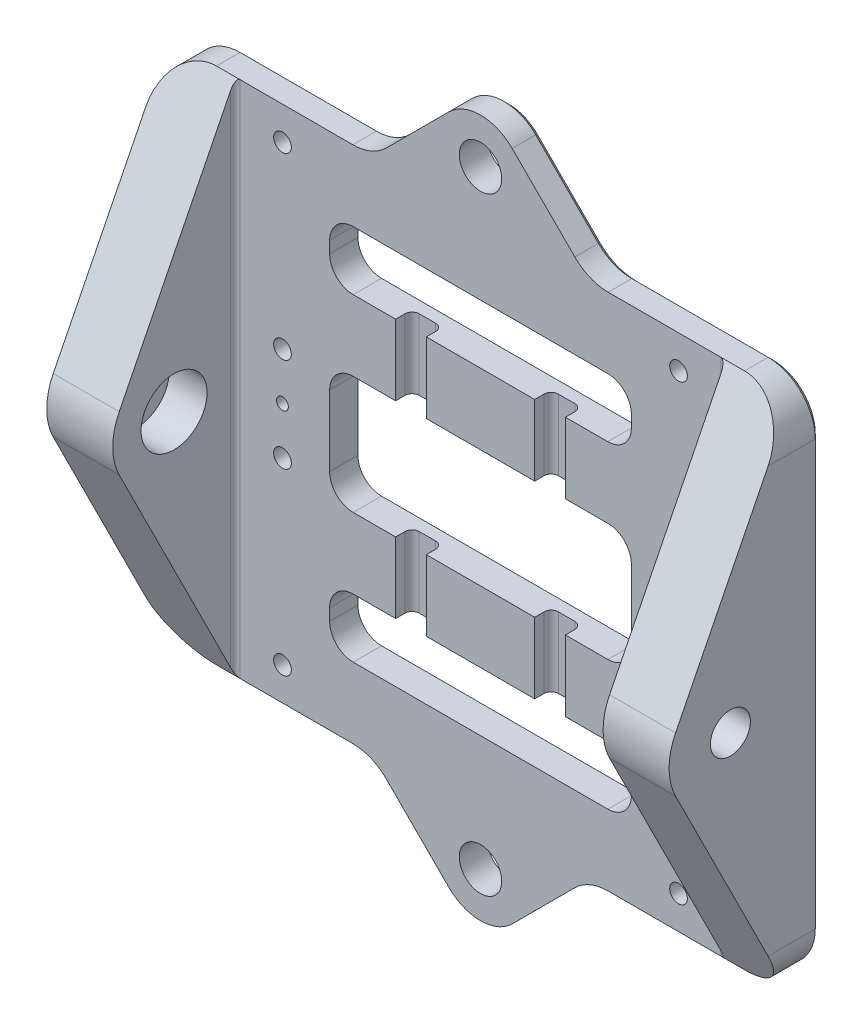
ISO-10303-21;
HEADER;
FILE_DESCRIPTION(('STEP AP214'),'2;1');
FILE_NAME('part.step','',(''),(''),'','','');
FILE_SCHEMA(('AUTOMOTIVE_DESIGN { 1 0 10303 214 1 1 1 1 }'));
ENDSEC;
DATA;
#1=APPLICATION_CONTEXT('core data for automotive mechanical design processes');
#2=APPLICATION_PROTOCOL_DEFINITION('international standard','automotive_design',2000,#1);
#3=PRODUCT_CONTEXT('',#1,'mechanical');
#4=PRODUCT('Part','Part','',(#3));
#5=PRODUCT_RELATED_PRODUCT_CATEGORY('part','',(#4));
#6=PRODUCT_DEFINITION_FORMATION('','',#4);
#7=PRODUCT_DEFINITION_CONTEXT('part definition',#1,'design');
#8=PRODUCT_DEFINITION('design','',#6,#7);
#9=PRODUCT_DEFINITION_SHAPE('','',#8);
#10=(LENGTH_UNIT() NAMED_UNIT(*) SI_UNIT(.MILLI.,.METRE.));
#11=(NAMED_UNIT(*) PLANE_ANGLE_UNIT() SI_UNIT($,.RADIAN.));
#12=(NAMED_UNIT(*) SI_UNIT($,.STERADIAN.) SOLID_ANGLE_UNIT());
#13=UNCERTAINTY_MEASURE_WITH_UNIT(LENGTH_MEASURE(1.E-05),#10,'distance_accuracy_value','');
#14=(GEOMETRIC_REPRESENTATION_CONTEXT(3) GLOBAL_UNCERTAINTY_ASSIGNED_CONTEXT((#13)) GLOBAL_UNIT_ASSIGNED_CONTEXT((#10,
#11,#12)) REPRESENTATION_CONTEXT('',''));
#15=CARTESIAN_POINT('',(0.,0.,0.));
#16=DIRECTION('',(0.,0.,1.));
#17=DIRECTION('',(1.,0.,0.));
#18=AXIS2_PLACEMENT_3D('',#15,#16,#17);
#19=CARTESIAN_POINT('',(66.001,0.,19.));
#20=DIRECTION('',(-1.,0.,0.));
#21=DIRECTION('',(0.,0.,1.));
#22=AXIS2_PLACEMENT_3D('',#19,#20,#21);
#23=CYLINDRICAL_SURFACE('',#22,4.25000000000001);
#24=CARTESIAN_POINT('',(66.,0.,19.));
#25=DIRECTION('',(-1.,0.,0.));
#26=DIRECTION('',(0.,0.,1.));
#27=AXIS2_PLACEMENT_3D('',#24,#25,#26);
#28=CIRCLE('',#27,4.25000000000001);
#29=CARTESIAN_POINT('',(66.,0.,23.25));
#30=VERTEX_POINT('',#29);
#31=EDGE_CURVE('E714',#30,#30,#28,.T.);
#32=ORIENTED_EDGE('',*,*,#31,.F.);
#33=EDGE_LOOP('',(#32));
#34=FACE_BOUND('',#33,.T.);
#35=CARTESIAN_POINT('',(60.,0.,19.));
#36=DIRECTION('',(-1.,0.,0.));
#37=DIRECTION('',(0.,0.,1.));
#38=AXIS2_PLACEMENT_3D('',#35,#36,#37);
#39=CIRCLE('',#38,4.25000000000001);
#40=CARTESIAN_POINT('',(60.,0.,23.25));
#41=VERTEX_POINT('',#40);
#42=EDGE_CURVE('E2915',#41,#41,#39,.F.);
#43=ORIENTED_EDGE('',*,*,#42,.F.);
#44=EDGE_LOOP('',(#43));
#45=FACE_BOUND('',#44,.T.);
#46=ADVANCED_FACE('F145',(#34,#45),#23,.F.);
#47=CARTESIAN_POINT('',(-66.001,0.,19.));
#48=DIRECTION('',(1.,0.,0.));
#49=DIRECTION('',(0.,0.,-1.));
#50=AXIS2_PLACEMENT_3D('',#47,#48,#49);
#51=CYLINDRICAL_SURFACE('',#50,4.25000000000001);
#52=CARTESIAN_POINT('',(-66.,0.,19.));
#53=DIRECTION('',(1.,0.,0.));
#54=DIRECTION('',(0.,1.,0.));
#55=AXIS2_PLACEMENT_3D('',#52,#53,#54);
#56=CIRCLE('',#55,4.25000000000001);
#57=CARTESIAN_POINT('',(-66.,4.25000000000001,19.));
#58=VERTEX_POINT('',#57);
#59=EDGE_CURVE('E2920',#58,#58,#56,.F.);
#60=ORIENTED_EDGE('',*,*,#59,.T.);
#61=EDGE_LOOP('',(#60));
#62=FACE_BOUND('',#61,.T.);
#63=CARTESIAN_POINT('',(-60.,0.,19.));
#64=DIRECTION('',(1.,0.,0.));
#65=DIRECTION('',(0.,0.,-1.));
#66=AXIS2_PLACEMENT_3D('',#63,#64,#65);
#67=CIRCLE('',#66,4.25000000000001);
#68=CARTESIAN_POINT('',(-60.,0.,14.75));
#69=VERTEX_POINT('',#68);
#70=EDGE_CURVE('E2910',#69,#69,#67,.F.);
#71=ORIENTED_EDGE('',*,*,#70,.F.);
#72=EDGE_LOOP('',(#71));
#73=FACE_BOUND('',#72,.T.);
#74=ADVANCED_FACE('F1462',(#62,#73),#51,.F.);
#75=CARTESIAN_POINT('',(52.,0.,32.));
#76=DIRECTION('',(1.,0.,0.));
#77=DIRECTION('',(0.,0.,-1.));
#78=AXIS2_PLACEMENT_3D('',#75,#76,#77);
#79=PLANE('',#78);
#80=CARTESIAN_POINT('',(52.,0.,19.));
#81=DIRECTION('',(1.,0.,0.));
#82=DIRECTION('',(0.,0.,-1.));
#83=AXIS2_PLACEMENT_3D('',#80,#81,#82);
#84=CIRCLE('',#83,7.);
#85=CARTESIAN_POINT('',(52.,0.,12.));
#86=VERTEX_POINT('',#85);
#87=EDGE_CURVE('E2914',#86,#86,#84,.T.);
#88=ORIENTED_EDGE('',*,*,#87,.T.);
#89=EDGE_LOOP('',(#88));
#90=FACE_BOUND('',#89,.T.);
#91=DIRECTION('',(0.,0.894176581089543,-0.447714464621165));
#92=VECTOR('',#91,1.);
#93=CARTESIAN_POINT('',(52.,13.4266680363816,26.8157789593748));
#94=LINE('',#93,#92);
#95=CARTESIAN_POINT('',(52.,5.82028804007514,30.6242955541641));
#96=VERTEX_POINT('',#95);
#97=CARTESIAN_POINT('',(52.,53.0027972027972,7.));
#98=VERTEX_POINT('',#97);
#99=EDGE_CURVE('E935',#96,#98,#94,.T.);
#100=ORIENTED_EDGE('',*,*,#99,.T.);
#101=DIRECTION('',(0.,-1.,0.));
#102=VECTOR('',#101,1.);
#103=CARTESIAN_POINT('',(52.,0.,7.));
#104=LINE('',#103,#102);
#105=CARTESIAN_POINT('',(52.,-53.0027972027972,7.));
#106=VERTEX_POINT('',#105);
#107=EDGE_CURVE('E841',#98,#106,#104,.T.);
#108=ORIENTED_EDGE('',*,*,#107,.T.);
#109=DIRECTION('',(0.,-0.894176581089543,-0.447714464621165));
#110=VECTOR('',#109,1.);
#111=CARTESIAN_POINT('',(52.,-13.4266680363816,26.8157789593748));
#112=LINE('',#111,#110);
#113=CARTESIAN_POINT('',(52.,-5.82028804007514,30.6242955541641));
#114=VERTEX_POINT('',#113);
#115=EDGE_CURVE('E697',#114,#106,#112,.T.);
#116=ORIENTED_EDGE('',*,*,#115,.F.);
#117=CARTESIAN_POINT('',(52.,0.,19.));
#118=DIRECTION('',(-1.,0.,0.));
#119=DIRECTION('',(0.,0.,1.));
#120=AXIS2_PLACEMENT_3D('',#117,#118,#119);
#121=CIRCLE('',#120,13.);
#122=EDGE_CURVE('E711',#96,#114,#121,.F.);
#123=ORIENTED_EDGE('',*,*,#122,.F.);
#124=EDGE_LOOP('',(#100,#108,#116,#123));
#125=FACE_BOUND('',#124,.T.);
#126=ADVANCED_FACE('F1468',(#90,#125),#79,.F.);
#127=CARTESIAN_POINT('',(66.,0.,32.));
#128=DIRECTION('',(-1.,0.,0.));
#129=DIRECTION('',(0.,0.,1.));
#130=AXIS2_PLACEMENT_3D('',#127,#128,#129);
#131=PLANE('',#130);
#132=ORIENTED_EDGE('',*,*,#31,.T.);
#133=EDGE_LOOP('',(#132));
#134=FACE_BOUND('',#133,.T.);
#135=DIRECTION('',(0.,0.,-1.));
#136=VECTOR('',#135,1.);
#137=CARTESIAN_POINT('',(66.,-45.,32.));
#138=LINE('',#137,#136);
#139=CARTESIAN_POINT('',(66.,-45.,11.0070028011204));
#140=VERTEX_POINT('',#139);
#141=CARTESIAN_POINT('',(66.,-45.,0.999999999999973));
#142=VERTEX_POINT('',#141);
#143=EDGE_CURVE('E944',#140,#142,#138,.T.);
#144=ORIENTED_EDGE('',*,*,#143,.T.);
#145=DIRECTION('',(0.,1.,0.));
#146=VECTOR('',#145,1.);
#147=CARTESIAN_POINT('',(66.,0.,0.999999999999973));
#148=LINE('',#147,#146);
#149=CARTESIAN_POINT('',(66.,45.,0.999999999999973));
#150=VERTEX_POINT('',#149);
#151=EDGE_CURVE('E809',#142,#150,#148,.T.);
#152=ORIENTED_EDGE('',*,*,#151,.T.);
#153=DIRECTION('',(0.,0.,-1.));
#154=VECTOR('',#153,1.);
#155=CARTESIAN_POINT('',(66.,45.,6.));
#156=LINE('',#155,#154);
#157=CARTESIAN_POINT('',(66.,45.,11.0070028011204));
#158=VERTEX_POINT('',#157);
#159=EDGE_CURVE('E1207',#150,#158,#156,.F.);
#160=ORIENTED_EDGE('',*,*,#159,.T.);
#161=DIRECTION('',(0.,-0.894176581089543,0.447714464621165));
#162=VECTOR('',#161,1.);
#163=CARTESIAN_POINT('',(66.,13.4266680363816,26.8157789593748));
#164=LINE('',#163,#162);
#165=CARTESIAN_POINT('',(66.,5.82028804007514,30.6242955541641));
#166=VERTEX_POINT('',#165);
#167=EDGE_CURVE('E703',#158,#166,#164,.T.);
#168=ORIENTED_EDGE('',*,*,#167,.T.);
#169=CARTESIAN_POINT('',(66.,0.,19.));
#170=DIRECTION('',(-1.,0.,0.));
#171=DIRECTION('',(0.,0.,1.));
#172=AXIS2_PLACEMENT_3D('',#169,#170,#171);
#173=CIRCLE('',#172,13.);
#174=CARTESIAN_POINT('',(66.,-5.82028804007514,30.6242955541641));
#175=VERTEX_POINT('',#174);
#176=EDGE_CURVE('E700',#175,#166,#173,.T.);
#177=ORIENTED_EDGE('',*,*,#176,.F.);
#178=DIRECTION('',(0.,0.894176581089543,0.447714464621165));
#179=VECTOR('',#178,1.);
#180=CARTESIAN_POINT('',(66.,-13.4266680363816,26.8157789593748));
#181=LINE('',#180,#179);
#182=EDGE_CURVE('E684',#140,#175,#181,.T.);
#183=ORIENTED_EDGE('',*,*,#182,.F.);
#184=EDGE_LOOP('',(#144,#152,#160,#168,#177,#183));
#185=FACE_BOUND('',#184,.T.);
#186=ADVANCED_FACE('F701',(#134,#185),#131,.F.);
#187=CARTESIAN_POINT('',(0.,-55.,6.));
#188=DIRECTION('',(0.,1.,0.));
#189=DIRECTION('',(0.,0.,1.));
#190=AXIS2_PLACEMENT_3D('',#187,#188,#189);
#191=PLANE('',#190);
#192=DIRECTION('',(0.,0.,-1.));
#193=VECTOR('',#192,1.);
#194=CARTESIAN_POINT('',(-56.,-55.,6.));
#195=LINE('',#194,#193);
#196=CARTESIAN_POINT('',(-56.,-55.,6.));
#197=VERTEX_POINT('',#196);
#198=CARTESIAN_POINT('',(-56.,-55.,0.999999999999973));
#199=VERTEX_POINT('',#198);
#200=EDGE_CURVE('E735',#197,#199,#195,.T.);
#201=ORIENTED_EDGE('',*,*,#200,.T.);
#202=DIRECTION('',(1.,0.,0.));
#203=VECTOR('',#202,1.);
#204=CARTESIAN_POINT('',(0.,-55.,0.999999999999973));
#205=LINE('',#204,#203);
#206=CARTESIAN_POINT('',(-27.0771644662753,-55.,0.999999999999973));
#207=VERTEX_POINT('',#206);
#208=EDGE_CURVE('E839',#199,#207,#205,.T.);
#209=ORIENTED_EDGE('',*,*,#208,.T.);
#210=DIRECTION('',(0.,0.,-1.));
#211=VECTOR('',#210,1.);
#212=CARTESIAN_POINT('',(-27.0771644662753,-55.,6.));
#213=LINE('',#212,#211);
#214=CARTESIAN_POINT('',(-27.0771644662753,-55.,6.));
#215=VERTEX_POINT('',#214);
#216=EDGE_CURVE('E732',#207,#215,#213,.F.);
#217=ORIENTED_EDGE('',*,*,#216,.T.);
#218=DIRECTION('',(1.,0.,0.));
#219=VECTOR('',#218,1.);
#220=CARTESIAN_POINT('',(0.,-55.,6.));
#221=LINE('',#220,#219);
#222=CARTESIAN_POINT('',(-51.,-55.,6.));
#223=VERTEX_POINT('',#222);
#224=EDGE_CURVE('E907',#223,#215,#221,.T.);
#225=ORIENTED_EDGE('',*,*,#224,.F.);
#226=DIRECTION('',(1.,0.,0.));
#227=VECTOR('',#226,1.);
#228=CARTESIAN_POINT('',(-66.001,-55.,6.));
#229=LINE('',#228,#227);
#230=EDGE_CURVE('E185',#197,#223,#229,.T.);
#231=ORIENTED_EDGE('',*,*,#230,.F.);
#232=EDGE_LOOP('',(#201,#209,#217,#225,#231));
#233=FACE_BOUND('',#232,.T.);
#234=ADVANCED_FACE('F1501',(#233),#191,.F.);
#235=CARTESIAN_POINT('',(-52.,0.,32.));
#236=DIRECTION('',(1.,0.,0.));
#237=DIRECTION('',(0.,0.,-1.));
#238=AXIS2_PLACEMENT_3D('',#235,#236,#237);
#239=PLANE('',#238);
#240=CARTESIAN_POINT('',(-52.,0.,19.));
#241=DIRECTION('',(1.,0.,0.));
#242=DIRECTION('',(0.,0.,-1.));
#243=AXIS2_PLACEMENT_3D('',#240,#241,#242);
#244=CIRCLE('',#243,7.);
#245=CARTESIAN_POINT('',(-52.,0.,12.));
#246=VERTEX_POINT('',#245);
#247=EDGE_CURVE('E1104',#246,#246,#244,.T.);
#248=ORIENTED_EDGE('',*,*,#247,.F.);
#249=EDGE_LOOP('',(#248));
#250=FACE_BOUND('',#249,.T.);
#251=DIRECTION('',(0.,0.894176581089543,0.447714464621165));
#252=VECTOR('',#251,1.);
#253=CARTESIAN_POINT('',(-52.,-13.4266680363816,26.8157789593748));
#254=LINE('',#253,#252);
#255=CARTESIAN_POINT('',(-52.,-53.0027972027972,6.99999999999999));
#256=VERTEX_POINT('',#255);
#257=CARTESIAN_POINT('',(-52.,-5.82028804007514,30.6242955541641));
#258=VERTEX_POINT('',#257);
#259=EDGE_CURVE('E729',#256,#258,#254,.T.);
#260=ORIENTED_EDGE('',*,*,#259,.F.);
#261=DIRECTION('',(0.,-1.,0.));
#262=VECTOR('',#261,1.);
#263=CARTESIAN_POINT('',(-52.,55.,7.));
#264=LINE('',#263,#262);
#265=CARTESIAN_POINT('',(-52.,53.0027972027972,6.99999999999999));
#266=VERTEX_POINT('',#265);
#267=EDGE_CURVE('E1844',#256,#266,#264,.F.);
#268=ORIENTED_EDGE('',*,*,#267,.T.);
#269=DIRECTION('',(0.,-0.894176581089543,0.447714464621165));
#270=VECTOR('',#269,1.);
#271=CARTESIAN_POINT('',(-52.,13.4266680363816,26.8157789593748));
#272=LINE('',#271,#270);
#273=CARTESIAN_POINT('',(-52.,5.82028804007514,30.6242955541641));
#274=VERTEX_POINT('',#273);
#275=EDGE_CURVE('E1235',#266,#274,#272,.T.);
#276=ORIENTED_EDGE('',*,*,#275,.T.);
#277=CARTESIAN_POINT('',(-52.,0.,19.));
#278=DIRECTION('',(1.,0.,0.));
#279=DIRECTION('',(0.,0.,-1.));
#280=AXIS2_PLACEMENT_3D('',#277,#278,#279);
#281=CIRCLE('',#280,13.);
#282=EDGE_CURVE('E1849',#258,#274,#281,.F.);
#283=ORIENTED_EDGE('',*,*,#282,.F.);
#284=EDGE_LOOP('',(#260,#268,#276,#283));
#285=FACE_BOUND('',#284,.T.);
#286=ADVANCED_FACE('F1503',(#250,#285),#239,.T.);
#287=CARTESIAN_POINT('',(-66.,0.,32.));
#288=DIRECTION('',(1.,0.,0.));
#289=DIRECTION('',(0.,1.,0.));
#290=AXIS2_PLACEMENT_3D('',#287,#288,#289);
#291=PLANE('',#290);
#292=ORIENTED_EDGE('',*,*,#59,.F.);
#293=EDGE_LOOP('',(#292));
#294=FACE_BOUND('',#293,.T.);
#295=DIRECTION('',(0.,0.,-1.));
#296=VECTOR('',#295,1.);
#297=CARTESIAN_POINT('',(-66.,45.,0.));
#298=LINE('',#297,#296);
#299=CARTESIAN_POINT('',(-66.,45.,11.0070028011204));
#300=VERTEX_POINT('',#299);
#301=CARTESIAN_POINT('',(-66.,45.,0.999999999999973));
#302=VERTEX_POINT('',#301);
#303=EDGE_CURVE('E1228',#300,#302,#298,.T.);
#304=ORIENTED_EDGE('',*,*,#303,.T.);
#305=DIRECTION('',(0.,-1.,0.));
#306=VECTOR('',#305,1.);
#307=CARTESIAN_POINT('',(-66.,0.,0.999999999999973));
#308=LINE('',#307,#306);
#309=CARTESIAN_POINT('',(-66.,-45.,0.999999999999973));
#310=VERTEX_POINT('',#309);
#311=EDGE_CURVE('E831',#302,#310,#308,.T.);
#312=ORIENTED_EDGE('',*,*,#311,.T.);
#313=DIRECTION('',(0.,0.,-1.));
#314=VECTOR('',#313,1.);
#315=CARTESIAN_POINT('',(-66.,-45.,32.));
#316=LINE('',#315,#314);
#317=CARTESIAN_POINT('',(-66.,-45.,11.0070028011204));
#318=VERTEX_POINT('',#317);
#319=EDGE_CURVE('E1224',#310,#318,#316,.F.);
#320=ORIENTED_EDGE('',*,*,#319,.T.);
#321=DIRECTION('',(0.,0.894176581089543,0.447714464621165));
#322=VECTOR('',#321,1.);
#323=CARTESIAN_POINT('',(-66.,-13.4266680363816,26.8157789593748));
#324=LINE('',#323,#322);
#325=CARTESIAN_POINT('',(-66.,-5.82028804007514,30.6242955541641));
#326=VERTEX_POINT('',#325);
#327=EDGE_CURVE('E696',#318,#326,#324,.T.);
#328=ORIENTED_EDGE('',*,*,#327,.T.);
#329=CARTESIAN_POINT('',(-66.,0.,19.));
#330=DIRECTION('',(1.,0.,0.));
#331=DIRECTION('',(0.,1.,0.));
#332=AXIS2_PLACEMENT_3D('',#329,#330,#331);
#333=CIRCLE('',#332,13.);
#334=CARTESIAN_POINT('',(-66.,5.82028804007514,30.6242955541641));
#335=VERTEX_POINT('',#334);
#336=EDGE_CURVE('E1851',#326,#335,#333,.F.);
#337=ORIENTED_EDGE('',*,*,#336,.T.);
#338=DIRECTION('',(0.,-0.894176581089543,0.447714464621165));
#339=VECTOR('',#338,1.);
#340=CARTESIAN_POINT('',(-66.,13.4266680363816,26.8157789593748));
#341=LINE('',#340,#339);
#342=EDGE_CURVE('E2693',#300,#335,#341,.T.);
#343=ORIENTED_EDGE('',*,*,#342,.F.);
#344=EDGE_LOOP('',(#304,#312,#320,#328,#337,#343));
#345=FACE_BOUND('',#344,.T.);
#346=ADVANCED_FACE('F1506',(#294,#345),#291,.F.);
#347=CARTESIAN_POINT('',(0.,55.,6.));
#348=DIRECTION('',(0.,1.,0.));
#349=DIRECTION('',(0.,0.,1.));
#350=AXIS2_PLACEMENT_3D('',#347,#348,#349);
#351=PLANE('',#350);
#352=DIRECTION('',(0.,0.,-1.));
#353=VECTOR('',#352,1.);
#354=CARTESIAN_POINT('',(56.,55.,0.));
#355=LINE('',#354,#353);
#356=CARTESIAN_POINT('',(56.,55.,6.));
#357=VERTEX_POINT('',#356);
#358=CARTESIAN_POINT('',(56.,55.,0.999999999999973));
#359=VERTEX_POINT('',#358);
#360=EDGE_CURVE('E1215',#357,#359,#355,.T.);
#361=ORIENTED_EDGE('',*,*,#360,.T.);
#362=DIRECTION('',(-1.,0.,0.));
#363=VECTOR('',#362,1.);
#364=CARTESIAN_POINT('',(27.0771644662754,55.,0.999999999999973));
#365=LINE('',#364,#363);
#366=CARTESIAN_POINT('',(27.0771644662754,55.,0.999999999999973));
#367=VERTEX_POINT('',#366);
#368=EDGE_CURVE('E800',#359,#367,#365,.T.);
#369=ORIENTED_EDGE('',*,*,#368,.T.);
#370=DIRECTION('',(0.,0.,-1.));
#371=VECTOR('',#370,1.);
#372=CARTESIAN_POINT('',(27.0771644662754,55.,6.));
#373=LINE('',#372,#371);
#374=CARTESIAN_POINT('',(27.0771644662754,55.,6.));
#375=VERTEX_POINT('',#374);
#376=EDGE_CURVE('E928',#367,#375,#373,.F.);
#377=ORIENTED_EDGE('',*,*,#376,.T.);
#378=DIRECTION('',(1.,0.,0.));
#379=VECTOR('',#378,1.);
#380=CARTESIAN_POINT('',(0.,55.,6.));
#381=LINE('',#380,#379);
#382=CARTESIAN_POINT('',(51.,55.,6.));
#383=VERTEX_POINT('',#382);
#384=EDGE_CURVE('E920',#375,#383,#381,.T.);
#385=ORIENTED_EDGE('',*,*,#384,.T.);
#386=DIRECTION('',(-1.,0.,0.));
#387=VECTOR('',#386,1.);
#388=CARTESIAN_POINT('',(66.001,55.,6.));
#389=LINE('',#388,#387);
#390=EDGE_CURVE('E707',#357,#383,#389,.T.);
#391=ORIENTED_EDGE('',*,*,#390,.F.);
#392=EDGE_LOOP('',(#361,#369,#377,#385,#391));
#393=FACE_BOUND('',#392,.T.);
#394=ADVANCED_FACE('F1510',(#393),#351,.T.);
#395=CARTESIAN_POINT('',(0.,0.,6.));
#396=DIRECTION('',(0.,0.,1.));
#397=DIRECTION('',(1.,0.,0.));
#398=AXIS2_PLACEMENT_3D('',#395,#396,#397);
#399=PLANE('',#398);
#400=DIRECTION('',(0.,-1.,0.));
#401=VECTOR('',#400,1.);
#402=CARTESIAN_POINT('',(11.5,27.5,6.));
#403=LINE('',#402,#401);
#404=CARTESIAN_POINT('',(11.5,-12.5,6.));
#405=VERTEX_POINT('',#404);
#406=CARTESIAN_POINT('',(11.5,-27.5,6.));
#407=VERTEX_POINT('',#406);
#408=EDGE_CURVE('E706',#405,#407,#403,.T.);
#409=ORIENTED_EDGE('',*,*,#408,.F.);
#410=DIRECTION('',(1.,0.,0.));
#411=VECTOR('',#410,1.);
#412=CARTESIAN_POINT('',(-32.,-12.5,6.));
#413=LINE('',#412,#411);
#414=CARTESIAN_POINT('',(-11.5,-12.5,6.));
#415=VERTEX_POINT('',#414);
#416=EDGE_CURVE('E1386',#415,#405,#413,.T.);
#417=ORIENTED_EDGE('',*,*,#416,.F.);
#418=DIRECTION('',(0.,1.,0.));
#419=VECTOR('',#418,1.);
#420=CARTESIAN_POINT('',(-11.5,27.5,6.));
#421=LINE('',#420,#419);
#422=CARTESIAN_POINT('',(-11.5,-27.5,6.));
#423=VERTEX_POINT('',#422);
#424=EDGE_CURVE('E1287',#423,#415,#421,.T.);
#425=ORIENTED_EDGE('',*,*,#424,.F.);
#426=DIRECTION('',(-1.,0.,0.));
#427=VECTOR('',#426,1.);
#428=CARTESIAN_POINT('',(-32.,-27.5,6.));
#429=LINE('',#428,#427);
#430=EDGE_CURVE('E1343',#407,#423,#429,.T.);
#431=ORIENTED_EDGE('',*,*,#430,.F.);
#432=EDGE_LOOP('',(#409,#417,#425,#431));
#433=FACE_BOUND('',#432,.T.);
#434=ADVANCED_FACE('F1434',(#433),#399,.T.);
#435=CARTESIAN_POINT('',(11.5,27.5,6.));
#436=VERTEX_POINT('',#435);
#437=CARTESIAN_POINT('',(11.5,12.5,6.));
#438=VERTEX_POINT('',#437);
#439=EDGE_CURVE('E1254',#436,#438,#403,.T.);
#440=ORIENTED_EDGE('',*,*,#439,.F.);
#441=DIRECTION('',(1.,0.,0.));
#442=VECTOR('',#441,1.);
#443=CARTESIAN_POINT('',(-32.,27.5,6.));
#444=LINE('',#443,#442);
#445=CARTESIAN_POINT('',(-11.5,27.5,6.));
#446=VERTEX_POINT('',#445);
#447=EDGE_CURVE('E1362',#446,#436,#444,.T.);
#448=ORIENTED_EDGE('',*,*,#447,.F.);
#449=CARTESIAN_POINT('',(-11.5,12.5,6.));
#450=VERTEX_POINT('',#449);
#451=EDGE_CURVE('E1294',#450,#446,#421,.T.);
#452=ORIENTED_EDGE('',*,*,#451,.F.);
#453=DIRECTION('',(-1.,0.,0.));
#454=VECTOR('',#453,1.);
#455=CARTESIAN_POINT('',(-32.,12.5,6.));
#456=LINE('',#455,#454);
#457=EDGE_CURVE('E1392',#438,#450,#456,.T.);
#458=ORIENTED_EDGE('',*,*,#457,.F.);
#459=EDGE_LOOP('',(#440,#448,#452,#458));
#460=FACE_BOUND('',#459,.T.);
#461=ADVANCED_FACE('F1435',(#460),#399,.T.);
#462=CARTESIAN_POINT('',(38.9675144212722,38.9675144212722,6.));
#463=DIRECTION('',(0.707106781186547,0.707106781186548,0.));
#464=DIRECTION('',(-0.707106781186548,0.707106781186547,0.));
#465=AXIS2_PLACEMENT_3D('',#462,#463,#464);
#466=PLANE('',#465);
#467=DIRECTION('',(0.,0.,-1.));
#468=VECTOR('',#467,1.);
#469=CARTESIAN_POINT('',(20.0060966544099,57.9289321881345,0.));
#470=LINE('',#469,#468);
#471=CARTESIAN_POINT('',(20.0060966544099,57.9289321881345,6.));
#472=VERTEX_POINT('',#471);
#473=CARTESIAN_POINT('',(20.0060966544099,57.9289321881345,0.999999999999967));
#474=VERTEX_POINT('',#473);
#475=EDGE_CURVE('E745',#472,#474,#470,.T.);
#476=ORIENTED_EDGE('',*,*,#475,.T.);
#477=DIRECTION('',(-0.707106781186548,0.707106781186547,0.));
#478=VECTOR('',#477,1.);
#479=CARTESIAN_POINT('',(6.71751442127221,71.2175144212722,0.999999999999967));
#480=LINE('',#479,#478);
#481=CARTESIAN_POINT('',(6.71751442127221,71.2175144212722,0.999999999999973));
#482=VERTEX_POINT('',#481);
#483=EDGE_CURVE('E807',#474,#482,#480,.T.);
#484=ORIENTED_EDGE('',*,*,#483,.T.);
#485=DIRECTION('',(0.,0.,-1.));
#486=VECTOR('',#485,1.);
#487=CARTESIAN_POINT('',(6.71751442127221,71.2175144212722,6.));
#488=LINE('',#487,#486);
#489=CARTESIAN_POINT('',(6.71751442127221,71.2175144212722,6.));
#490=VERTEX_POINT('',#489);
#491=EDGE_CURVE('E1014',#490,#482,#488,.T.);
#492=ORIENTED_EDGE('',*,*,#491,.F.);
#493=DIRECTION('',(0.707106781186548,-0.707106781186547,0.));
#494=VECTOR('',#493,1.);
#495=CARTESIAN_POINT('',(38.9675144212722,38.9675144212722,6.));
#496=LINE('',#495,#494);
#497=EDGE_CURVE('E916',#490,#472,#496,.T.);
#498=ORIENTED_EDGE('',*,*,#497,.T.);
#499=EDGE_LOOP('',(#476,#484,#492,#498));
#500=FACE_BOUND('',#499,.T.);
#501=ADVANCED_FACE('F2481',(#500),#466,.T.);
#502=CARTESIAN_POINT('',(0.,64.5,6.));
#503=DIRECTION('',(0.,0.,-1.));
#504=DIRECTION('',(-1.,0.,0.));
#505=AXIS2_PLACEMENT_3D('',#502,#503,#504);
#506=CYLINDRICAL_SURFACE('',#505,9.49999999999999);
#507=ORIENTED_EDGE('',*,*,#491,.T.);
#508=CARTESIAN_POINT('',(0.,64.5,0.999999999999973));
#509=DIRECTION('',(0.,0.,1.));
#510=DIRECTION('',(1.,0.,0.));
#511=AXIS2_PLACEMENT_3D('',#508,#509,#510);
#512=CIRCLE('',#511,9.49999999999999);
#513=CARTESIAN_POINT('',(-6.7175144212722,71.2175144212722,0.999999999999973));
#514=VERTEX_POINT('',#513);
#515=EDGE_CURVE('E811',#482,#514,#512,.T.);
#516=ORIENTED_EDGE('',*,*,#515,.T.);
#517=DIRECTION('',(0.,0.,-1.));
#518=VECTOR('',#517,1.);
#519=CARTESIAN_POINT('',(-6.7175144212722,71.2175144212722,6.));
#520=LINE('',#519,#518);
#521=CARTESIAN_POINT('',(-6.7175144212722,71.2175144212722,6.));
#522=VERTEX_POINT('',#521);
#523=EDGE_CURVE('E1011',#522,#514,#520,.T.);
#524=ORIENTED_EDGE('',*,*,#523,.F.);
#525=CARTESIAN_POINT('',(0.,64.5,6.));
#526=DIRECTION('',(0.,0.,1.));
#527=DIRECTION('',(1.,0.,0.));
#528=AXIS2_PLACEMENT_3D('',#525,#526,#527);
#529=CIRCLE('',#528,9.49999999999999);
#530=EDGE_CURVE('E2725',#522,#490,#529,.F.);
#531=ORIENTED_EDGE('',*,*,#530,.T.);
#532=EDGE_LOOP('',(#507,#516,#524,#531));
#533=FACE_BOUND('',#532,.T.);
#534=ADVANCED_FACE('F2599',(#533),#506,.T.);
#535=CARTESIAN_POINT('',(-38.9675144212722,38.9675144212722,6.));
#536=DIRECTION('',(-0.707106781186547,0.707106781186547,0.));
#537=DIRECTION('',(-0.707106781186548,-0.707106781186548,0.));
#538=AXIS2_PLACEMENT_3D('',#535,#536,#537);
#539=PLANE('',#538);
#540=ORIENTED_EDGE('',*,*,#523,.T.);
#541=DIRECTION('',(-0.707106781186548,-0.707106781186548,0.));
#542=VECTOR('',#541,1.);
#543=CARTESIAN_POINT('',(-20.0060966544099,57.9289321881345,0.999999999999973));
#544=LINE('',#543,#542);
#545=CARTESIAN_POINT('',(-20.0060966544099,57.9289321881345,0.999999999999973));
#546=VERTEX_POINT('',#545);
#547=EDGE_CURVE('E815',#514,#546,#544,.T.);
#548=ORIENTED_EDGE('',*,*,#547,.T.);
#549=DIRECTION('',(0.,0.,-1.));
#550=VECTOR('',#549,1.);
#551=CARTESIAN_POINT('',(-20.0060966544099,57.9289321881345,6.));
#552=LINE('',#551,#550);
#553=CARTESIAN_POINT('',(-20.0060966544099,57.9289321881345,6.));
#554=VERTEX_POINT('',#553);
#555=EDGE_CURVE('E748',#546,#554,#552,.F.);
#556=ORIENTED_EDGE('',*,*,#555,.T.);
#557=DIRECTION('',(0.707106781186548,0.707106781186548,0.));
#558=VECTOR('',#557,1.);
#559=CARTESIAN_POINT('',(-38.9675144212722,38.9675144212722,6.));
#560=LINE('',#559,#558);
#561=EDGE_CURVE('E908',#554,#522,#560,.T.);
#562=ORIENTED_EDGE('',*,*,#561,.T.);
#563=EDGE_LOOP('',(#540,#548,#556,#562));
#564=FACE_BOUND('',#563,.T.);
#565=ADVANCED_FACE('F1922',(#564),#539,.T.);
#566=DIRECTION('',(0.,0.,-1.));
#567=VECTOR('',#566,1.);
#568=CARTESIAN_POINT('',(-27.0771644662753,55.,0.));
#569=LINE('',#568,#567);
#570=CARTESIAN_POINT('',(-27.0771644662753,55.,6.));
#571=VERTEX_POINT('',#570);
#572=CARTESIAN_POINT('',(-27.0771644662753,55.,0.999999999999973));
#573=VERTEX_POINT('',#572);
#574=EDGE_CURVE('E1231',#571,#573,#569,.T.);
#575=ORIENTED_EDGE('',*,*,#574,.T.);
#576=DIRECTION('',(-1.,0.,0.));
#577=VECTOR('',#576,1.);
#578=CARTESIAN_POINT('',(-56.,55.,0.999999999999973));
#579=LINE('',#578,#577);
#580=CARTESIAN_POINT('',(-56.,55.,0.999999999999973));
#581=VERTEX_POINT('',#580);
#582=EDGE_CURVE('E823',#573,#581,#579,.T.);
#583=ORIENTED_EDGE('',*,*,#582,.T.);
#584=DIRECTION('',(0.,0.,-1.));
#585=VECTOR('',#584,1.);
#586=CARTESIAN_POINT('',(-56.,55.,6.));
#587=LINE('',#586,#585);
#588=CARTESIAN_POINT('',(-56.,55.,6.));
#589=VERTEX_POINT('',#588);
#590=EDGE_CURVE('E2681',#581,#589,#587,.F.);
#591=ORIENTED_EDGE('',*,*,#590,.T.);
#592=DIRECTION('',(1.,0.,0.));
#593=VECTOR('',#592,1.);
#594=CARTESIAN_POINT('',(-66.001,55.,6.));
#595=LINE('',#594,#593);
#596=CARTESIAN_POINT('',(-51.,55.,6.));
#597=VERTEX_POINT('',#596);
#598=EDGE_CURVE('E160',#589,#597,#595,.T.);
#599=ORIENTED_EDGE('',*,*,#598,.T.);
#600=EDGE_CURVE('E904',#597,#571,#381,.T.);
#601=ORIENTED_EDGE('',*,*,#600,.T.);
#602=EDGE_LOOP('',(#575,#583,#591,#599,#601));
#603=FACE_BOUND('',#602,.T.);
#604=ADVANCED_FACE('F1916',(#603),#351,.T.);
#605=CARTESIAN_POINT('',(-38.9675144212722,-38.9675144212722,6.));
#606=DIRECTION('',(0.707106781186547,0.707106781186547,0.));
#607=DIRECTION('',(-0.707106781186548,0.707106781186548,0.));
#608=AXIS2_PLACEMENT_3D('',#605,#606,#607);
#609=PLANE('',#608);
#610=DIRECTION('',(0.,0.,-1.));
#611=VECTOR('',#610,1.);
#612=CARTESIAN_POINT('',(-20.0060966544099,-57.9289321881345,0.));
#613=LINE('',#612,#611);
#614=CARTESIAN_POINT('',(-20.0060966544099,-57.9289321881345,6.));
#615=VERTEX_POINT('',#614);
#616=CARTESIAN_POINT('',(-20.0060966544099,-57.9289321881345,0.999999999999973));
#617=VERTEX_POINT('',#616);
#618=EDGE_CURVE('E742',#615,#617,#613,.T.);
#619=ORIENTED_EDGE('',*,*,#618,.T.);
#620=DIRECTION('',(0.707106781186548,-0.707106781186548,0.));
#621=VECTOR('',#620,1.);
#622=CARTESIAN_POINT('',(-38.9675144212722,-38.9675144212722,0.999999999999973));
#623=LINE('',#622,#621);
#624=CARTESIAN_POINT('',(-6.7175144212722,-71.2175144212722,0.999999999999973));
#625=VERTEX_POINT('',#624);
#626=EDGE_CURVE('E833',#617,#625,#623,.T.);
#627=ORIENTED_EDGE('',*,*,#626,.T.);
#628=DIRECTION('',(0.,0.,-1.));
#629=VECTOR('',#628,1.);
#630=CARTESIAN_POINT('',(-6.7175144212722,-71.2175144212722,6.));
#631=LINE('',#630,#629);
#632=CARTESIAN_POINT('',(-6.7175144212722,-71.2175144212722,6.));
#633=VERTEX_POINT('',#632);
#634=EDGE_CURVE('E1008',#633,#625,#631,.T.);
#635=ORIENTED_EDGE('',*,*,#634,.F.);
#636=DIRECTION('',(0.707106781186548,-0.707106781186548,0.));
#637=VECTOR('',#636,1.);
#638=CARTESIAN_POINT('',(-38.9675144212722,-38.9675144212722,6.));
#639=LINE('',#638,#637);
#640=EDGE_CURVE('E954',#615,#633,#639,.T.);
#641=ORIENTED_EDGE('',*,*,#640,.F.);
#642=EDGE_LOOP('',(#619,#627,#635,#641));
#643=FACE_BOUND('',#642,.T.);
#644=ADVANCED_FACE('F1867',(#643),#609,.F.);
#645=CARTESIAN_POINT('',(0.,-64.5,6.));
#646=DIRECTION('',(0.,0.,-1.));
#647=DIRECTION('',(-1.,0.,0.));
#648=AXIS2_PLACEMENT_3D('',#645,#646,#647);
#649=CYLINDRICAL_SURFACE('',#648,9.5);
#650=ORIENTED_EDGE('',*,*,#634,.T.);
#651=CARTESIAN_POINT('',(0.,-64.5,0.999999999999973));
#652=DIRECTION('',(0.,0.,1.));
#653=DIRECTION('',(1.,0.,0.));
#654=AXIS2_PLACEMENT_3D('',#651,#652,#653);
#655=CIRCLE('',#654,9.5);
#656=CARTESIAN_POINT('',(6.71751442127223,-71.2175144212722,0.999999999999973));
#657=VERTEX_POINT('',#656);
#658=EDGE_CURVE('E829',#625,#657,#655,.T.);
#659=ORIENTED_EDGE('',*,*,#658,.T.);
#660=DIRECTION('',(0.,0.,-1.));
#661=VECTOR('',#660,1.);
#662=CARTESIAN_POINT('',(6.71751442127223,-71.2175144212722,6.));
#663=LINE('',#662,#661);
#664=CARTESIAN_POINT('',(6.71751442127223,-71.2175144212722,6.));
#665=VERTEX_POINT('',#664);
#666=EDGE_CURVE('E967',#665,#657,#663,.T.);
#667=ORIENTED_EDGE('',*,*,#666,.F.);
#668=CARTESIAN_POINT('',(0.,-64.5,6.));
#669=DIRECTION('',(0.,0.,1.));
#670=DIRECTION('',(1.,0.,0.));
#671=AXIS2_PLACEMENT_3D('',#668,#669,#670);
#672=CIRCLE('',#671,9.5);
#673=EDGE_CURVE('E957',#633,#665,#672,.T.);
#674=ORIENTED_EDGE('',*,*,#673,.F.);
#675=EDGE_LOOP('',(#650,#659,#667,#674));
#676=FACE_BOUND('',#675,.T.);
#677=ADVANCED_FACE('F1872',(#676),#649,.T.);
#678=CARTESIAN_POINT('',(38.9675144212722,-38.9675144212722,6.));
#679=DIRECTION('',(-0.707106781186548,0.707106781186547,0.));
#680=DIRECTION('',(-0.707106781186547,-0.707106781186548,0.));
#681=AXIS2_PLACEMENT_3D('',#678,#679,#680);
#682=PLANE('',#681);
#683=ORIENTED_EDGE('',*,*,#666,.T.);
#684=DIRECTION('',(0.707106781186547,0.707106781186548,0.));
#685=VECTOR('',#684,1.);
#686=CARTESIAN_POINT('',(38.9675144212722,-38.9675144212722,0.999999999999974));
#687=LINE('',#686,#685);
#688=CARTESIAN_POINT('',(20.0060966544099,-57.9289321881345,0.999999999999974));
#689=VERTEX_POINT('',#688);
#690=EDGE_CURVE('E825',#657,#689,#687,.T.);
#691=ORIENTED_EDGE('',*,*,#690,.T.);
#692=DIRECTION('',(0.,0.,-1.));
#693=VECTOR('',#692,1.);
#694=CARTESIAN_POINT('',(20.0060966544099,-57.9289321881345,6.));
#695=LINE('',#694,#693);
#696=CARTESIAN_POINT('',(20.0060966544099,-57.9289321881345,6.));
#697=VERTEX_POINT('',#696);
#698=EDGE_CURVE('E740',#689,#697,#695,.F.);
#699=ORIENTED_EDGE('',*,*,#698,.T.);
#700=DIRECTION('',(0.707106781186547,0.707106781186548,0.));
#701=VECTOR('',#700,1.);
#702=CARTESIAN_POINT('',(38.9675144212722,-38.9675144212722,6.));
#703=LINE('',#702,#701);
#704=EDGE_CURVE('E949',#665,#697,#703,.T.);
#705=ORIENTED_EDGE('',*,*,#704,.F.);
#706=EDGE_LOOP('',(#683,#691,#699,#705));
#707=FACE_BOUND('',#706,.T.);
#708=ADVANCED_FACE('F1884',(#707),#682,.F.);
#709=CARTESIAN_POINT('',(0.,-64.5,6.));
#710=DIRECTION('',(0.,0.,-1.));
#711=DIRECTION('',(-1.,0.,0.));
#712=AXIS2_PLACEMENT_3D('',#709,#710,#711);
#713=CYLINDRICAL_SURFACE('',#712,4.5);
#714=CARTESIAN_POINT('',(0.,-64.5,6.));
#715=DIRECTION('',(0.,0.,1.));
#716=DIRECTION('',(1.,0.,0.));
#717=AXIS2_PLACEMENT_3D('',#714,#715,#716);
#718=CIRCLE('',#717,4.5);
#719=CARTESIAN_POINT('',(4.5,-64.5,6.));
#720=VERTEX_POINT('',#719);
#721=EDGE_CURVE('E948',#720,#720,#718,.F.);
#722=ORIENTED_EDGE('',*,*,#721,.F.);
#723=EDGE_LOOP('',(#722));
#724=FACE_BOUND('',#723,.T.);
#725=CARTESIAN_POINT('',(0.,-64.5,0.));
#726=DIRECTION('',(0.,0.,1.));
#727=DIRECTION('',(1.,0.,0.));
#728=AXIS2_PLACEMENT_3D('',#725,#726,#727);
#729=CIRCLE('',#728,4.5);
#730=CARTESIAN_POINT('',(4.5,-64.5,0.));
#731=VERTEX_POINT('',#730);
#732=EDGE_CURVE('E999',#731,#731,#729,.F.);
#733=ORIENTED_EDGE('',*,*,#732,.T.);
#734=EDGE_LOOP('',(#733));
#735=FACE_BOUND('',#734,.T.);
#736=ADVANCED_FACE('F1888',(#724,#735),#713,.F.);
#737=DIRECTION('',(0.,0.,-1.));
#738=VECTOR('',#737,1.);
#739=CARTESIAN_POINT('',(27.0771644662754,-55.,0.));
#740=LINE('',#739,#738);
#741=CARTESIAN_POINT('',(27.0771644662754,-55.,6.));
#742=VERTEX_POINT('',#741);
#743=CARTESIAN_POINT('',(27.0771644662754,-55.,0.999999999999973));
#744=VERTEX_POINT('',#743);
#745=EDGE_CURVE('E950',#742,#744,#740,.T.);
#746=ORIENTED_EDGE('',*,*,#745,.T.);
#747=DIRECTION('',(1.,0.,0.));
#748=VECTOR('',#747,1.);
#749=CARTESIAN_POINT('',(0.,-55.,0.999999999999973));
#750=LINE('',#749,#748);
#751=CARTESIAN_POINT('',(56.,-55.,0.999999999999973));
#752=VERTEX_POINT('',#751);
#753=EDGE_CURVE('E817',#744,#752,#750,.T.);
#754=ORIENTED_EDGE('',*,*,#753,.T.);
#755=DIRECTION('',(0.,0.,-1.));
#756=VECTOR('',#755,1.);
#757=CARTESIAN_POINT('',(56.,-55.,6.));
#758=LINE('',#757,#756);
#759=CARTESIAN_POINT('',(56.,-55.,6.));
#760=VERTEX_POINT('',#759);
#761=EDGE_CURVE('E1211',#752,#760,#758,.F.);
#762=ORIENTED_EDGE('',*,*,#761,.T.);
#763=DIRECTION('',(-1.,0.,0.));
#764=VECTOR('',#763,1.);
#765=CARTESIAN_POINT('',(66.001,-55.,6.));
#766=LINE('',#765,#764);
#767=CARTESIAN_POINT('',(51.,-55.,6.));
#768=VERTEX_POINT('',#767);
#769=EDGE_CURVE('E169',#760,#768,#766,.T.);
#770=ORIENTED_EDGE('',*,*,#769,.T.);
#771=EDGE_CURVE('E946',#742,#768,#221,.T.);
#772=ORIENTED_EDGE('',*,*,#771,.F.);
#773=EDGE_LOOP('',(#746,#754,#762,#770,#772));
#774=FACE_BOUND('',#773,.T.);
#775=ADVANCED_FACE('F1886',(#774),#191,.F.);
#776=CARTESIAN_POINT('',(-42.,48.,6.));
#777=DIRECTION('',(0.,0.,-1.));
#778=DIRECTION('',(-1.,0.,0.));
#779=AXIS2_PLACEMENT_3D('',#776,#777,#778);
#780=CYLINDRICAL_SURFACE('',#779,1.875);
#781=CARTESIAN_POINT('',(-42.,48.,6.));
#782=DIRECTION('',(0.,0.,1.));
#783=DIRECTION('',(1.,0.,0.));
#784=AXIS2_PLACEMENT_3D('',#781,#782,#783);
#785=CIRCLE('',#784,1.875);
#786=CARTESIAN_POINT('',(-40.125,48.,6.));
#787=VERTEX_POINT('',#786);
#788=EDGE_CURVE('E914',#787,#787,#785,.T.);
#789=ORIENTED_EDGE('',*,*,#788,.T.);
#790=EDGE_LOOP('',(#789));
#791=FACE_BOUND('',#790,.T.);
#792=CARTESIAN_POINT('',(-42.,48.,0.));
#793=DIRECTION('',(0.,0.,1.));
#794=DIRECTION('',(1.,0.,0.));
#795=AXIS2_PLACEMENT_3D('',#792,#793,#794);
#796=CIRCLE('',#795,1.875);
#797=CARTESIAN_POINT('',(-40.125,48.,0.));
#798=VERTEX_POINT('',#797);
#799=EDGE_CURVE('E996',#798,#798,#796,.T.);
#800=ORIENTED_EDGE('',*,*,#799,.F.);
#801=EDGE_LOOP('',(#800));
#802=FACE_BOUND('',#801,.T.);
#803=ADVANCED_FACE('F1424',(#791,#802),#780,.F.);
#804=CARTESIAN_POINT('',(-42.,10.,6.));
#805=DIRECTION('',(0.,0.,-1.));
#806=DIRECTION('',(-1.,0.,0.));
#807=AXIS2_PLACEMENT_3D('',#804,#805,#806);
#808=CYLINDRICAL_SURFACE('',#807,1.875);
#809=CARTESIAN_POINT('',(-42.,10.,6.));
#810=DIRECTION('',(0.,0.,1.));
#811=DIRECTION('',(1.,0.,0.));
#812=AXIS2_PLACEMENT_3D('',#809,#810,#811);
#813=CIRCLE('',#812,1.875);
#814=CARTESIAN_POINT('',(-40.125,10.,6.));
#815=VERTEX_POINT('',#814);
#816=EDGE_CURVE('E1417',#815,#815,#813,.T.);
#817=ORIENTED_EDGE('',*,*,#816,.T.);
#818=EDGE_LOOP('',(#817));
#819=FACE_BOUND('',#818,.T.);
#820=CARTESIAN_POINT('',(-42.,10.,0.));
#821=DIRECTION('',(0.,0.,1.));
#822=DIRECTION('',(1.,0.,0.));
#823=AXIS2_PLACEMENT_3D('',#820,#821,#822);
#824=CIRCLE('',#823,1.875);
#825=CARTESIAN_POINT('',(-40.125,10.,0.));
#826=VERTEX_POINT('',#825);
#827=EDGE_CURVE('E993',#826,#826,#824,.T.);
#828=ORIENTED_EDGE('',*,*,#827,.F.);
#829=EDGE_LOOP('',(#828));
#830=FACE_BOUND('',#829,.T.);
#831=ADVANCED_FACE('F1894',(#819,#830),#808,.F.);
#832=CARTESIAN_POINT('',(-42.,0.,6.));
#833=DIRECTION('',(0.,0.,-1.));
#834=DIRECTION('',(-1.,0.,0.));
#835=AXIS2_PLACEMENT_3D('',#832,#833,#834);
#836=CYLINDRICAL_SURFACE('',#835,1.25);
#837=CARTESIAN_POINT('',(-42.,0.,6.));
#838=DIRECTION('',(0.,0.,1.));
#839=DIRECTION('',(1.,0.,0.));
#840=AXIS2_PLACEMENT_3D('',#837,#838,#839);
#841=CIRCLE('',#840,1.25);
#842=CARTESIAN_POINT('',(-40.75,0.,6.));
#843=VERTEX_POINT('',#842);
#844=EDGE_CURVE('E1415',#843,#843,#841,.T.);
#845=ORIENTED_EDGE('',*,*,#844,.T.);
#846=EDGE_LOOP('',(#845));
#847=FACE_BOUND('',#846,.T.);
#848=CARTESIAN_POINT('',(-42.,0.,0.));
#849=DIRECTION('',(0.,0.,1.));
#850=DIRECTION('',(1.,0.,0.));
#851=AXIS2_PLACEMENT_3D('',#848,#849,#850);
#852=CIRCLE('',#851,1.25);
#853=CARTESIAN_POINT('',(-40.75,0.,0.));
#854=VERTEX_POINT('',#853);
#855=EDGE_CURVE('E990',#854,#854,#852,.T.);
#856=ORIENTED_EDGE('',*,*,#855,.F.);
#857=EDGE_LOOP('',(#856));
#858=FACE_BOUND('',#857,.T.);
#859=ADVANCED_FACE('F1968',(#847,#858),#836,.F.);
#860=CARTESIAN_POINT('',(-42.,-10.,6.));
#861=DIRECTION('',(0.,0.,-1.));
#862=DIRECTION('',(-1.,0.,0.));
#863=AXIS2_PLACEMENT_3D('',#860,#861,#862);
#864=CYLINDRICAL_SURFACE('',#863,1.875);
#865=CARTESIAN_POINT('',(-42.,-10.,6.));
#866=DIRECTION('',(0.,0.,1.));
#867=DIRECTION('',(1.,0.,0.));
#868=AXIS2_PLACEMENT_3D('',#865,#866,#867);
#869=CIRCLE('',#868,1.875);
#870=CARTESIAN_POINT('',(-40.125,-10.,6.));
#871=VERTEX_POINT('',#870);
#872=EDGE_CURVE('E1412',#871,#871,#869,.T.);
#873=ORIENTED_EDGE('',*,*,#872,.T.);
#874=EDGE_LOOP('',(#873));
#875=FACE_BOUND('',#874,.T.);
#876=CARTESIAN_POINT('',(-42.,-10.,0.));
#877=DIRECTION('',(0.,0.,1.));
#878=DIRECTION('',(1.,0.,0.));
#879=AXIS2_PLACEMENT_3D('',#876,#877,#878);
#880=CIRCLE('',#879,1.875);
#881=CARTESIAN_POINT('',(-40.125,-10.,0.));
#882=VERTEX_POINT('',#881);
#883=EDGE_CURVE('E987',#882,#882,#880,.T.);
#884=ORIENTED_EDGE('',*,*,#883,.F.);
#885=EDGE_LOOP('',(#884));
#886=FACE_BOUND('',#885,.T.);
#887=ADVANCED_FACE('F1975',(#875,#886),#864,.F.);
#888=CARTESIAN_POINT('',(-42.,-48.,6.));
#889=DIRECTION('',(0.,0.,-1.));
#890=DIRECTION('',(-1.,0.,0.));
#891=AXIS2_PLACEMENT_3D('',#888,#889,#890);
#892=CYLINDRICAL_SURFACE('',#891,1.875);
#893=CARTESIAN_POINT('',(-42.,-48.,6.));
#894=DIRECTION('',(0.,0.,1.));
#895=DIRECTION('',(1.,0.,0.));
#896=AXIS2_PLACEMENT_3D('',#893,#894,#895);
#897=CIRCLE('',#896,1.875);
#898=CARTESIAN_POINT('',(-40.125,-48.,6.));
#899=VERTEX_POINT('',#898);
#900=EDGE_CURVE('E1409',#899,#899,#897,.T.);
#901=ORIENTED_EDGE('',*,*,#900,.T.);
#902=EDGE_LOOP('',(#901));
#903=FACE_BOUND('',#902,.T.);
#904=CARTESIAN_POINT('',(-42.,-48.,0.));
#905=DIRECTION('',(0.,0.,1.));
#906=DIRECTION('',(1.,0.,0.));
#907=AXIS2_PLACEMENT_3D('',#904,#905,#906);
#908=CIRCLE('',#907,1.875);
#909=CARTESIAN_POINT('',(-40.125,-48.,0.));
#910=VERTEX_POINT('',#909);
#911=EDGE_CURVE('E984',#910,#910,#908,.T.);
#912=ORIENTED_EDGE('',*,*,#911,.F.);
#913=EDGE_LOOP('',(#912));
#914=FACE_BOUND('',#913,.T.);
#915=ADVANCED_FACE('F1983',(#903,#914),#892,.F.);
#916=CARTESIAN_POINT('',(42.,0.,6.));
#917=DIRECTION('',(0.,0.,-1.));
#918=DIRECTION('',(-1.,0.,0.));
#919=AXIS2_PLACEMENT_3D('',#916,#917,#918);
#920=CYLINDRICAL_SURFACE('',#919,1.25);
#921=CARTESIAN_POINT('',(42.,0.,6.));
#922=DIRECTION('',(0.,0.,1.));
#923=DIRECTION('',(1.,0.,0.));
#924=AXIS2_PLACEMENT_3D('',#921,#922,#923);
#925=CIRCLE('',#924,1.25);
#926=CARTESIAN_POINT('',(43.25,0.,6.));
#927=VERTEX_POINT('',#926);
#928=EDGE_CURVE('E1406',#927,#927,#925,.T.);
#929=ORIENTED_EDGE('',*,*,#928,.T.);
#930=EDGE_LOOP('',(#929));
#931=FACE_BOUND('',#930,.T.);
#932=CARTESIAN_POINT('',(42.,0.,0.));
#933=DIRECTION('',(0.,0.,1.));
#934=DIRECTION('',(1.,0.,0.));
#935=AXIS2_PLACEMENT_3D('',#932,#933,#934);
#936=CIRCLE('',#935,1.25);
#937=CARTESIAN_POINT('',(43.25,0.,0.));
#938=VERTEX_POINT('',#937);
#939=EDGE_CURVE('E981',#938,#938,#936,.T.);
#940=ORIENTED_EDGE('',*,*,#939,.F.);
#941=EDGE_LOOP('',(#940));
#942=FACE_BOUND('',#941,.T.);
#943=ADVANCED_FACE('F1991',(#931,#942),#920,.F.);
#944=CARTESIAN_POINT('',(42.,10.,6.));
#945=DIRECTION('',(0.,0.,-1.));
#946=DIRECTION('',(-1.,0.,0.));
#947=AXIS2_PLACEMENT_3D('',#944,#945,#946);
#948=CYLINDRICAL_SURFACE('',#947,1.875);
#949=CARTESIAN_POINT('',(42.,10.,6.));
#950=DIRECTION('',(0.,0.,1.));
#951=DIRECTION('',(1.,0.,0.));
#952=AXIS2_PLACEMENT_3D('',#949,#950,#951);
#953=CIRCLE('',#952,1.875);
#954=CARTESIAN_POINT('',(43.875,10.,6.));
#955=VERTEX_POINT('',#954);
#956=EDGE_CURVE('E1403',#955,#955,#953,.T.);
#957=ORIENTED_EDGE('',*,*,#956,.T.);
#958=EDGE_LOOP('',(#957));
#959=FACE_BOUND('',#958,.T.);
#960=CARTESIAN_POINT('',(42.,10.,0.));
#961=DIRECTION('',(0.,0.,1.));
#962=DIRECTION('',(1.,0.,0.));
#963=AXIS2_PLACEMENT_3D('',#960,#961,#962);
#964=CIRCLE('',#963,1.875);
#965=CARTESIAN_POINT('',(43.875,10.,0.));
#966=VERTEX_POINT('',#965);
#967=EDGE_CURVE('E978',#966,#966,#964,.T.);
#968=ORIENTED_EDGE('',*,*,#967,.F.);
#969=EDGE_LOOP('',(#968));
#970=FACE_BOUND('',#969,.T.);
#971=ADVANCED_FACE('F1999',(#959,#970),#948,.F.);
#972=CARTESIAN_POINT('',(42.,48.,6.));
#973=DIRECTION('',(0.,0.,-1.));
#974=DIRECTION('',(-1.,0.,0.));
#975=AXIS2_PLACEMENT_3D('',#972,#973,#974);
#976=CYLINDRICAL_SURFACE('',#975,1.875);
#977=CARTESIAN_POINT('',(42.,48.,6.));
#978=DIRECTION('',(0.,0.,1.));
#979=DIRECTION('',(1.,0.,0.));
#980=AXIS2_PLACEMENT_3D('',#977,#978,#979);
#981=CIRCLE('',#980,1.875);
#982=CARTESIAN_POINT('',(43.875,48.,6.));
#983=VERTEX_POINT('',#982);
#984=EDGE_CURVE('E1400',#983,#983,#981,.T.);
#985=ORIENTED_EDGE('',*,*,#984,.T.);
#986=EDGE_LOOP('',(#985));
#987=FACE_BOUND('',#986,.T.);
#988=CARTESIAN_POINT('',(42.,48.,0.));
#989=DIRECTION('',(0.,0.,1.));
#990=DIRECTION('',(1.,0.,0.));
#991=AXIS2_PLACEMENT_3D('',#988,#989,#990);
#992=CIRCLE('',#991,1.875);
#993=CARTESIAN_POINT('',(43.875,48.,0.));
#994=VERTEX_POINT('',#993);
#995=EDGE_CURVE('E975',#994,#994,#992,.T.);
#996=ORIENTED_EDGE('',*,*,#995,.F.);
#997=EDGE_LOOP('',(#996));
#998=FACE_BOUND('',#997,.T.);
#999=ADVANCED_FACE('F2007',(#987,#998),#976,.F.);
#1000=CARTESIAN_POINT('',(42.,-10.,6.));
#1001=DIRECTION('',(0.,0.,-1.));
#1002=DIRECTION('',(-1.,0.,0.));
#1003=AXIS2_PLACEMENT_3D('',#1000,#1001,#1002);
#1004=CYLINDRICAL_SURFACE('',#1003,1.875);
#1005=CARTESIAN_POINT('',(42.,-10.,6.));
#1006=DIRECTION('',(0.,0.,1.));
#1007=DIRECTION('',(1.,0.,0.));
#1008=AXIS2_PLACEMENT_3D('',#1005,#1006,#1007);
#1009=CIRCLE('',#1008,1.875);
#1010=CARTESIAN_POINT('',(43.875,-10.,6.));
#1011=VERTEX_POINT('',#1010);
#1012=EDGE_CURVE('E1397',#1011,#1011,#1009,.T.);
#1013=ORIENTED_EDGE('',*,*,#1012,.T.);
#1014=EDGE_LOOP('',(#1013));
#1015=FACE_BOUND('',#1014,.T.);
#1016=CARTESIAN_POINT('',(42.,-10.,0.));
#1017=DIRECTION('',(0.,0.,1.));
#1018=DIRECTION('',(1.,0.,0.));
#1019=AXIS2_PLACEMENT_3D('',#1016,#1017,#1018);
#1020=CIRCLE('',#1019,1.875);
#1021=CARTESIAN_POINT('',(43.875,-10.,0.));
#1022=VERTEX_POINT('',#1021);
#1023=EDGE_CURVE('E971',#1022,#1022,#1020,.T.);
#1024=ORIENTED_EDGE('',*,*,#1023,.F.);
#1025=EDGE_LOOP('',(#1024));
#1026=FACE_BOUND('',#1025,.T.);
#1027=ADVANCED_FACE('F2015',(#1015,#1026),#1004,.F.);
#1028=CARTESIAN_POINT('',(42.,-48.,6.));
#1029=DIRECTION('',(0.,0.,-1.));
#1030=DIRECTION('',(-1.,0.,0.));
#1031=AXIS2_PLACEMENT_3D('',#1028,#1029,#1030);
#1032=CYLINDRICAL_SURFACE('',#1031,1.875);
#1033=CARTESIAN_POINT('',(42.,-48.,6.));
#1034=DIRECTION('',(0.,0.,1.));
#1035=DIRECTION('',(1.,0.,0.));
#1036=AXIS2_PLACEMENT_3D('',#1033,#1034,#1035);
#1037=CIRCLE('',#1036,1.875);
#1038=CARTESIAN_POINT('',(43.875,-48.,6.));
#1039=VERTEX_POINT('',#1038);
#1040=EDGE_CURVE('E1005',#1039,#1039,#1037,.T.);
#1041=ORIENTED_EDGE('',*,*,#1040,.T.);
#1042=EDGE_LOOP('',(#1041));
#1043=FACE_BOUND('',#1042,.T.);
#1044=CARTESIAN_POINT('',(42.,-48.,0.));
#1045=DIRECTION('',(0.,0.,1.));
#1046=DIRECTION('',(1.,0.,0.));
#1047=AXIS2_PLACEMENT_3D('',#1044,#1045,#1046);
#1048=CIRCLE('',#1047,1.875);
#1049=CARTESIAN_POINT('',(43.875,-48.,0.));
#1050=VERTEX_POINT('',#1049);
#1051=EDGE_CURVE('E968',#1050,#1050,#1048,.T.);
#1052=ORIENTED_EDGE('',*,*,#1051,.F.);
#1053=EDGE_LOOP('',(#1052));
#1054=FACE_BOUND('',#1053,.T.);
#1055=ADVANCED_FACE('F1445',(#1043,#1054),#1032,.F.);
#1056=CARTESIAN_POINT('',(0.,64.5,6.));
#1057=DIRECTION('',(0.,0.,-1.));
#1058=DIRECTION('',(-1.,0.,0.));
#1059=AXIS2_PLACEMENT_3D('',#1056,#1057,#1058);
#1060=CYLINDRICAL_SURFACE('',#1059,4.5);
#1061=CARTESIAN_POINT('',(0.,64.5,6.));
#1062=DIRECTION('',(0.,0.,1.));
#1063=DIRECTION('',(1.,0.,0.));
#1064=AXIS2_PLACEMENT_3D('',#1061,#1062,#1063);
#1065=CIRCLE('',#1064,4.5);
#1066=CARTESIAN_POINT('',(4.5,64.5,6.));
#1067=VERTEX_POINT('',#1066);
#1068=EDGE_CURVE('E964',#1067,#1067,#1065,.T.);
#1069=ORIENTED_EDGE('',*,*,#1068,.T.);
#1070=EDGE_LOOP('',(#1069));
#1071=FACE_BOUND('',#1070,.T.);
#1072=CARTESIAN_POINT('',(0.,64.5,0.));
#1073=DIRECTION('',(0.,0.,1.));
#1074=DIRECTION('',(1.,0.,0.));
#1075=AXIS2_PLACEMENT_3D('',#1072,#1073,#1074);
#1076=CIRCLE('',#1075,4.5);
#1077=CARTESIAN_POINT('',(4.5,64.5,0.));
#1078=VERTEX_POINT('',#1077);
#1079=EDGE_CURVE('E1002',#1078,#1078,#1076,.T.);
#1080=ORIENTED_EDGE('',*,*,#1079,.F.);
#1081=EDGE_LOOP('',(#1080));
#1082=FACE_BOUND('',#1081,.T.);
#1083=ADVANCED_FACE('F1431',(#1071,#1082),#1060,.F.);
#1084=DIRECTION('',(0.,1.,0.));
#1085=VECTOR('',#1084,1.);
#1086=CARTESIAN_POINT('',(18.,27.5,6.));
#1087=LINE('',#1086,#1085);
#1088=CARTESIAN_POINT('',(18.,-27.5,6.));
#1089=VERTEX_POINT('',#1088);
#1090=CARTESIAN_POINT('',(18.,-12.5,6.));
#1091=VERTEX_POINT('',#1090);
#1092=EDGE_CURVE('E1250',#1089,#1091,#1087,.T.);
#1093=ORIENTED_EDGE('',*,*,#1092,.F.);
#1094=CARTESIAN_POINT('',(27.,-27.5,6.));
#1095=VERTEX_POINT('',#1094);
#1096=EDGE_CURVE('E1340',#1095,#1089,#429,.T.);
#1097=ORIENTED_EDGE('',*,*,#1096,.F.);
#1098=CARTESIAN_POINT('',(27.,-32.5,6.));
#1099=DIRECTION('',(0.,0.,1.));
#1100=DIRECTION('',(1.,0.,0.));
#1101=AXIS2_PLACEMENT_3D('',#1098,#1099,#1100);
#1102=CIRCLE('',#1101,5.);
#1103=CARTESIAN_POINT('',(32.,-32.5,6.));
#1104=VERTEX_POINT('',#1103);
#1105=EDGE_CURVE('E1180',#1095,#1104,#1102,.F.);
#1106=ORIENTED_EDGE('',*,*,#1105,.T.);
#1107=DIRECTION('',(0.,1.,0.));
#1108=VECTOR('',#1107,1.);
#1109=CARTESIAN_POINT('',(32.,-27.5,6.));
#1110=LINE('',#1109,#1108);
#1111=CARTESIAN_POINT('',(32.,-35.,6.));
#1112=VERTEX_POINT('',#1111);
#1113=EDGE_CURVE('E1336',#1112,#1104,#1110,.T.);
#1114=ORIENTED_EDGE('',*,*,#1113,.F.);
#1115=CARTESIAN_POINT('',(27.,-35.,6.));
#1116=DIRECTION('',(0.,0.,1.));
#1117=DIRECTION('',(1.,0.,0.));
#1118=AXIS2_PLACEMENT_3D('',#1115,#1116,#1117);
#1119=CIRCLE('',#1118,5.);
#1120=CARTESIAN_POINT('',(27.,-40.,6.));
#1121=VERTEX_POINT('',#1120);
#1122=EDGE_CURVE('E1168',#1112,#1121,#1119,.F.);
#1123=ORIENTED_EDGE('',*,*,#1122,.T.);
#1124=DIRECTION('',(1.,0.,0.));
#1125=VECTOR('',#1124,1.);
#1126=CARTESIAN_POINT('',(-32.,-40.,6.));
#1127=LINE('',#1126,#1125);
#1128=CARTESIAN_POINT('',(-27.,-40.,6.));
#1129=VERTEX_POINT('',#1128);
#1130=EDGE_CURVE('E1333',#1129,#1121,#1127,.T.);
#1131=ORIENTED_EDGE('',*,*,#1130,.F.);
#1132=CARTESIAN_POINT('',(-27.,-35.,6.));
#1133=DIRECTION('',(0.,0.,1.));
#1134=DIRECTION('',(1.,0.,0.));
#1135=AXIS2_PLACEMENT_3D('',#1132,#1133,#1134);
#1136=CIRCLE('',#1135,5.);
#1137=CARTESIAN_POINT('',(-32.,-35.,6.));
#1138=VERTEX_POINT('',#1137);
#1139=EDGE_CURVE('E1172',#1129,#1138,#1136,.F.);
#1140=ORIENTED_EDGE('',*,*,#1139,.T.);
#1141=DIRECTION('',(0.,-1.,0.));
#1142=VECTOR('',#1141,1.);
#1143=CARTESIAN_POINT('',(-32.,-27.5,6.));
#1144=LINE('',#1143,#1142);
#1145=CARTESIAN_POINT('',(-32.,-32.5,6.));
#1146=VERTEX_POINT('',#1145);
#1147=EDGE_CURVE('E1330',#1146,#1138,#1144,.T.);
#1148=ORIENTED_EDGE('',*,*,#1147,.F.);
#1149=CARTESIAN_POINT('',(-27.,-32.5,6.));
#1150=DIRECTION('',(0.,0.,1.));
#1151=DIRECTION('',(1.,0.,0.));
#1152=AXIS2_PLACEMENT_3D('',#1149,#1150,#1151);
#1153=CIRCLE('',#1152,5.);
#1154=CARTESIAN_POINT('',(-27.,-27.5,6.));
#1155=VERTEX_POINT('',#1154);
#1156=EDGE_CURVE('E1176',#1146,#1155,#1153,.F.);
#1157=ORIENTED_EDGE('',*,*,#1156,.T.);
#1158=CARTESIAN_POINT('',(-18.,-27.5,6.));
#1159=VERTEX_POINT('',#1158);
#1160=EDGE_CURVE('E1339',#1159,#1155,#429,.T.);
#1161=ORIENTED_EDGE('',*,*,#1160,.F.);
#1162=DIRECTION('',(0.,-1.,0.));
#1163=VECTOR('',#1162,1.);
#1164=CARTESIAN_POINT('',(-18.,27.5,6.));
#1165=LINE('',#1164,#1163);
#1166=CARTESIAN_POINT('',(-18.,-12.5,6.));
#1167=VERTEX_POINT('',#1166);
#1168=EDGE_CURVE('E1282',#1167,#1159,#1165,.T.);
#1169=ORIENTED_EDGE('',*,*,#1168,.F.);
#1170=CARTESIAN_POINT('',(-27.,-12.5,6.));
#1171=VERTEX_POINT('',#1170);
#1172=EDGE_CURVE('E1383',#1171,#1167,#413,.T.);
#1173=ORIENTED_EDGE('',*,*,#1172,.F.);
#1174=CARTESIAN_POINT('',(-27.,-7.5,6.));
#1175=DIRECTION('',(0.,0.,1.));
#1176=DIRECTION('',(1.,0.,0.));
#1177=AXIS2_PLACEMENT_3D('',#1174,#1175,#1176);
#1178=CIRCLE('',#1177,5.);
#1179=CARTESIAN_POINT('',(-32.,-7.5,6.));
#1180=VERTEX_POINT('',#1179);
#1181=EDGE_CURVE('E1184',#1171,#1180,#1178,.F.);
#1182=ORIENTED_EDGE('',*,*,#1181,.T.);
#1183=DIRECTION('',(0.,-1.,0.));
#1184=VECTOR('',#1183,1.);
#1185=CARTESIAN_POINT('',(-32.,12.5,6.));
#1186=LINE('',#1185,#1184);
#1187=CARTESIAN_POINT('',(-32.,7.5,6.));
#1188=VERTEX_POINT('',#1187);
#1189=EDGE_CURVE('E1379',#1188,#1180,#1186,.T.);
#1190=ORIENTED_EDGE('',*,*,#1189,.F.);
#1191=CARTESIAN_POINT('',(-27.,7.5,6.));
#1192=DIRECTION('',(0.,0.,1.));
#1193=DIRECTION('',(1.,0.,0.));
#1194=AXIS2_PLACEMENT_3D('',#1191,#1192,#1193);
#1195=CIRCLE('',#1194,5.);
#1196=CARTESIAN_POINT('',(-27.,12.5,6.));
#1197=VERTEX_POINT('',#1196);
#1198=EDGE_CURVE('E1188',#1188,#1197,#1195,.F.);
#1199=ORIENTED_EDGE('',*,*,#1198,.T.);
#1200=CARTESIAN_POINT('',(-18.,12.5,6.));
#1201=VERTEX_POINT('',#1200);
#1202=EDGE_CURVE('E1389',#1201,#1197,#456,.T.);
#1203=ORIENTED_EDGE('',*,*,#1202,.F.);
#1204=CARTESIAN_POINT('',(-18.,27.5,6.));
#1205=VERTEX_POINT('',#1204);
#1206=EDGE_CURVE('E1291',#1205,#1201,#1165,.T.);
#1207=ORIENTED_EDGE('',*,*,#1206,.F.);
#1208=CARTESIAN_POINT('',(-27.,27.5,6.));
#1209=VERTEX_POINT('',#1208);
#1210=EDGE_CURVE('E1359',#1209,#1205,#444,.T.);
#1211=ORIENTED_EDGE('',*,*,#1210,.F.);
#1212=CARTESIAN_POINT('',(-27.,32.5,6.));
#1213=DIRECTION('',(0.,0.,1.));
#1214=DIRECTION('',(1.,0.,0.));
#1215=AXIS2_PLACEMENT_3D('',#1212,#1213,#1214);
#1216=CIRCLE('',#1215,5.);
#1217=CARTESIAN_POINT('',(-32.,32.5,6.));
#1218=VERTEX_POINT('',#1217);
#1219=EDGE_CURVE('E1160',#1209,#1218,#1216,.F.);
#1220=ORIENTED_EDGE('',*,*,#1219,.T.);
#1221=DIRECTION('',(0.,-1.,0.));
#1222=VECTOR('',#1221,1.);
#1223=CARTESIAN_POINT('',(-32.,40.,6.));
#1224=LINE('',#1223,#1222);
#1225=CARTESIAN_POINT('',(-32.,35.,6.));
#1226=VERTEX_POINT('',#1225);
#1227=EDGE_CURVE('E1355',#1226,#1218,#1224,.T.);
#1228=ORIENTED_EDGE('',*,*,#1227,.F.);
#1229=CARTESIAN_POINT('',(-27.,35.,6.));
#1230=DIRECTION('',(0.,0.,1.));
#1231=DIRECTION('',(1.,0.,0.));
#1232=AXIS2_PLACEMENT_3D('',#1229,#1230,#1231);
#1233=CIRCLE('',#1232,5.);
#1234=CARTESIAN_POINT('',(-27.,40.,6.));
#1235=VERTEX_POINT('',#1234);
#1236=EDGE_CURVE('E1164',#1226,#1235,#1233,.F.);
#1237=ORIENTED_EDGE('',*,*,#1236,.T.);
#1238=DIRECTION('',(-1.,0.,0.));
#1239=VECTOR('',#1238,1.);
#1240=CARTESIAN_POINT('',(-32.,40.,6.));
#1241=LINE('',#1240,#1239);
#1242=CARTESIAN_POINT('',(27.,40.,6.));
#1243=VERTEX_POINT('',#1242);
#1244=EDGE_CURVE('E1365',#1243,#1235,#1241,.T.);
#1245=ORIENTED_EDGE('',*,*,#1244,.F.);
#1246=CARTESIAN_POINT('',(27.,35.,6.));
#1247=DIRECTION('',(0.,0.,1.));
#1248=DIRECTION('',(1.,0.,0.));
#1249=AXIS2_PLACEMENT_3D('',#1246,#1247,#1248);
#1250=CIRCLE('',#1249,5.);
#1251=CARTESIAN_POINT('',(32.,35.,6.));
#1252=VERTEX_POINT('',#1251);
#1253=EDGE_CURVE('E1204',#1243,#1252,#1250,.F.);
#1254=ORIENTED_EDGE('',*,*,#1253,.T.);
#1255=DIRECTION('',(0.,1.,0.));
#1256=VECTOR('',#1255,1.);
#1257=CARTESIAN_POINT('',(32.,40.,6.));
#1258=LINE('',#1257,#1256);
#1259=CARTESIAN_POINT('',(32.,32.5,6.));
#1260=VERTEX_POINT('',#1259);
#1261=EDGE_CURVE('E1361',#1260,#1252,#1258,.T.);
#1262=ORIENTED_EDGE('',*,*,#1261,.F.);
#1263=CARTESIAN_POINT('',(27.,32.5,6.));
#1264=DIRECTION('',(0.,0.,1.));
#1265=DIRECTION('',(1.,0.,0.));
#1266=AXIS2_PLACEMENT_3D('',#1263,#1264,#1265);
#1267=CIRCLE('',#1266,5.);
#1268=CARTESIAN_POINT('',(27.,27.5,6.));
#1269=VERTEX_POINT('',#1268);
#1270=EDGE_CURVE('E1200',#1260,#1269,#1267,.F.);
#1271=ORIENTED_EDGE('',*,*,#1270,.T.);
#1272=CARTESIAN_POINT('',(18.,27.5,6.));
#1273=VERTEX_POINT('',#1272);
#1274=EDGE_CURVE('E1358',#1273,#1269,#444,.T.);
#1275=ORIENTED_EDGE('',*,*,#1274,.F.);
#1276=CARTESIAN_POINT('',(18.,12.5,6.));
#1277=VERTEX_POINT('',#1276);
#1278=EDGE_CURVE('E1257',#1277,#1273,#1087,.T.);
#1279=ORIENTED_EDGE('',*,*,#1278,.F.);
#1280=CARTESIAN_POINT('',(27.,12.5,6.));
#1281=VERTEX_POINT('',#1280);
#1282=EDGE_CURVE('E1390',#1281,#1277,#456,.T.);
#1283=ORIENTED_EDGE('',*,*,#1282,.F.);
#1284=CARTESIAN_POINT('',(27.,7.5,6.));
#1285=DIRECTION('',(0.,0.,1.));
#1286=DIRECTION('',(1.,0.,0.));
#1287=AXIS2_PLACEMENT_3D('',#1284,#1285,#1286);
#1288=CIRCLE('',#1287,5.);
#1289=CARTESIAN_POINT('',(32.,7.5,6.));
#1290=VERTEX_POINT('',#1289);
#1291=EDGE_CURVE('E1192',#1281,#1290,#1288,.F.);
#1292=ORIENTED_EDGE('',*,*,#1291,.T.);
#1293=DIRECTION('',(0.,1.,0.));
#1294=VECTOR('',#1293,1.);
#1295=CARTESIAN_POINT('',(32.,12.5,6.));
#1296=LINE('',#1295,#1294);
#1297=CARTESIAN_POINT('',(32.,-7.5,6.));
#1298=VERTEX_POINT('',#1297);
#1299=EDGE_CURVE('E1385',#1298,#1290,#1296,.T.);
#1300=ORIENTED_EDGE('',*,*,#1299,.F.);
#1301=CARTESIAN_POINT('',(27.,-7.5,6.));
#1302=DIRECTION('',(0.,0.,1.));
#1303=DIRECTION('',(1.,0.,0.));
#1304=AXIS2_PLACEMENT_3D('',#1301,#1302,#1303);
#1305=CIRCLE('',#1304,5.);
#1306=CARTESIAN_POINT('',(27.,-12.5,6.));
#1307=VERTEX_POINT('',#1306);
#1308=EDGE_CURVE('E1196',#1298,#1307,#1305,.F.);
#1309=ORIENTED_EDGE('',*,*,#1308,.T.);
#1310=EDGE_CURVE('E1382',#1091,#1307,#413,.T.);
#1311=ORIENTED_EDGE('',*,*,#1310,.F.);
#1312=EDGE_LOOP('',(#1093,#1097,#1106,#1114,#1123,#1131,#1140,#1148,#1157,#1161,#1169,#1173,
#1182,#1190,#1199,#1203,#1207,#1211,#1220,#1228,#1237,#1245,#1254,#1262,#1271,#1275,#1279,#1283,
#1292,#1300,#1309,#1311));
#1313=FACE_BOUND('',#1312,.T.);
#1314=ORIENTED_EDGE('',*,*,#1040,.F.);
#1315=EDGE_LOOP('',(#1314));
#1316=FACE_BOUND('',#1315,.T.);
#1317=ORIENTED_EDGE('',*,*,#1012,.F.);
#1318=EDGE_LOOP('',(#1317));
#1319=FACE_BOUND('',#1318,.T.);
#1320=ORIENTED_EDGE('',*,*,#984,.F.);
#1321=EDGE_LOOP('',(#1320));
#1322=FACE_BOUND('',#1321,.T.);
#1323=ORIENTED_EDGE('',*,*,#956,.F.);
#1324=EDGE_LOOP('',(#1323));
#1325=FACE_BOUND('',#1324,.T.);
#1326=ORIENTED_EDGE('',*,*,#928,.F.);
#1327=EDGE_LOOP('',(#1326));
#1328=FACE_BOUND('',#1327,.T.);
#1329=ORIENTED_EDGE('',*,*,#900,.F.);
#1330=EDGE_LOOP('',(#1329));
#1331=FACE_BOUND('',#1330,.T.);
#1332=ORIENTED_EDGE('',*,*,#872,.F.);
#1333=EDGE_LOOP('',(#1332));
#1334=FACE_BOUND('',#1333,.T.);
#1335=ORIENTED_EDGE('',*,*,#844,.F.);
#1336=EDGE_LOOP('',(#1335));
#1337=FACE_BOUND('',#1336,.T.);
#1338=ORIENTED_EDGE('',*,*,#816,.F.);
#1339=EDGE_LOOP('',(#1338));
#1340=FACE_BOUND('',#1339,.T.);
#1341=ORIENTED_EDGE('',*,*,#788,.F.);
#1342=EDGE_LOOP('',(#1341));
#1343=FACE_BOUND('',#1342,.T.);
#1344=ORIENTED_EDGE('',*,*,#771,.T.);
#1345=DIRECTION('',(0.,-1.,0.));
#1346=VECTOR('',#1345,1.);
#1347=CARTESIAN_POINT('',(51.,0.,6.));
#1348=LINE('',#1347,#1346);
#1349=EDGE_CURVE('E1840',#768,#383,#1348,.F.);
#1350=ORIENTED_EDGE('',*,*,#1349,.T.);
#1351=ORIENTED_EDGE('',*,*,#384,.F.);
#1352=CARTESIAN_POINT('',(27.0771644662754,65.,6.));
#1353=DIRECTION('',(0.,0.,1.));
#1354=DIRECTION('',(1.,0.,0.));
#1355=AXIS2_PLACEMENT_3D('',#1352,#1353,#1354);
#1356=CIRCLE('',#1355,10.);
#1357=EDGE_CURVE('E754',#375,#472,#1356,.F.);
#1358=ORIENTED_EDGE('',*,*,#1357,.T.);
#1359=ORIENTED_EDGE('',*,*,#497,.F.);
#1360=ORIENTED_EDGE('',*,*,#530,.F.);
#1361=ORIENTED_EDGE('',*,*,#561,.F.);
#1362=CARTESIAN_POINT('',(-27.0771644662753,65.,6.));
#1363=DIRECTION('',(0.,0.,1.));
#1364=DIRECTION('',(1.,0.,0.));
#1365=AXIS2_PLACEMENT_3D('',#1362,#1363,#1364);
#1366=CIRCLE('',#1365,10.);
#1367=EDGE_CURVE('E756',#554,#571,#1366,.F.);
#1368=ORIENTED_EDGE('',*,*,#1367,.T.);
#1369=ORIENTED_EDGE('',*,*,#600,.F.);
#1370=DIRECTION('',(0.,-1.,0.));
#1371=VECTOR('',#1370,1.);
#1372=CARTESIAN_POINT('',(-51.,-55.,6.));
#1373=LINE('',#1372,#1371);
#1374=EDGE_CURVE('E903',#597,#223,#1373,.T.);
#1375=ORIENTED_EDGE('',*,*,#1374,.T.);
#1376=ORIENTED_EDGE('',*,*,#224,.T.);
#1377=CARTESIAN_POINT('',(-27.0771644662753,-65.,6.));
#1378=DIRECTION('',(0.,0.,1.));
#1379=DIRECTION('',(1.,0.,0.));
#1380=AXIS2_PLACEMENT_3D('',#1377,#1378,#1379);
#1381=CIRCLE('',#1380,10.);
#1382=EDGE_CURVE('E752',#215,#615,#1381,.F.);
#1383=ORIENTED_EDGE('',*,*,#1382,.T.);
#1384=ORIENTED_EDGE('',*,*,#640,.T.);
#1385=ORIENTED_EDGE('',*,*,#673,.T.);
#1386=ORIENTED_EDGE('',*,*,#704,.T.);
#1387=CARTESIAN_POINT('',(27.0771644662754,-65.,6.));
#1388=DIRECTION('',(0.,0.,1.));
#1389=DIRECTION('',(1.,0.,0.));
#1390=AXIS2_PLACEMENT_3D('',#1387,#1388,#1389);
#1391=CIRCLE('',#1390,10.);
#1392=EDGE_CURVE('E750',#697,#742,#1391,.F.);
#1393=ORIENTED_EDGE('',*,*,#1392,.T.);
#1394=EDGE_LOOP('',(#1344,#1350,#1351,#1358,#1359,#1360,#1361,#1368,#1369,#1375,#1376,#1383,
#1384,#1385,#1386,#1393));
#1395=FACE_BOUND('',#1394,.T.);
#1396=ORIENTED_EDGE('',*,*,#721,.T.);
#1397=EDGE_LOOP('',(#1396));
#1398=FACE_BOUND('',#1397,.T.);
#1399=ORIENTED_EDGE('',*,*,#1068,.F.);
#1400=EDGE_LOOP('',(#1399));
#1401=FACE_BOUND('',#1400,.T.);
#1402=ADVANCED_FACE('F1427',(#1313,#1316,#1319,#1322,#1325,#1328,#1331,#1334,#1337,#1340,#1343,
#1395,#1398,#1401),#399,.T.);
#1403=CARTESIAN_POINT('',(0.,0.,0.));
#1404=DIRECTION('',(0.,0.,1.));
#1405=DIRECTION('',(1.,0.,0.));
#1406=AXIS2_PLACEMENT_3D('',#1403,#1404,#1405);
#1407=PLANE('',#1406);
#1408=CARTESIAN_POINT('',(27.0771644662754,65.,0.));
#1409=DIRECTION('',(0.,0.,1.));
#1410=DIRECTION('',(1.,0.,0.));
#1411=AXIS2_PLACEMENT_3D('',#1408,#1409,#1410);
#1412=CIRCLE('',#1411,11.);
#1413=CARTESIAN_POINT('',(19.2989898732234,57.221825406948,0.));
#1414=VERTEX_POINT('',#1413);
#1415=CARTESIAN_POINT('',(27.0771644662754,54.,0.));
#1416=VERTEX_POINT('',#1415);
#1417=EDGE_CURVE('E795',#1414,#1416,#1412,.T.);
#1418=ORIENTED_EDGE('',*,*,#1417,.T.);
#1419=DIRECTION('',(1.,0.,0.));
#1420=VECTOR('',#1419,1.);
#1421=CARTESIAN_POINT('',(56.,54.,0.));
#1422=LINE('',#1421,#1420);
#1423=CARTESIAN_POINT('',(56.,54.,0.));
#1424=VERTEX_POINT('',#1423);
#1425=EDGE_CURVE('E797',#1416,#1424,#1422,.T.);
#1426=ORIENTED_EDGE('',*,*,#1425,.T.);
#1427=CARTESIAN_POINT('',(56.,45.,0.));
#1428=DIRECTION('',(0.,0.,1.));
#1429=DIRECTION('',(1.,0.,0.));
#1430=AXIS2_PLACEMENT_3D('',#1427,#1428,#1429);
#1431=CIRCLE('',#1430,9.00000000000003);
#1432=CARTESIAN_POINT('',(65.,45.,0.));
#1433=VERTEX_POINT('',#1432);
#1434=EDGE_CURVE('E793',#1424,#1433,#1431,.F.);
#1435=ORIENTED_EDGE('',*,*,#1434,.T.);
#1436=DIRECTION('',(0.,-1.,0.));
#1437=VECTOR('',#1436,1.);
#1438=CARTESIAN_POINT('',(65.,0.,0.));
#1439=LINE('',#1438,#1437);
#1440=CARTESIAN_POINT('',(65.,-45.,0.));
#1441=VERTEX_POINT('',#1440);
#1442=EDGE_CURVE('E789',#1433,#1441,#1439,.T.);
#1443=ORIENTED_EDGE('',*,*,#1442,.T.);
#1444=CARTESIAN_POINT('',(56.,-45.,0.));
#1445=DIRECTION('',(0.,0.,1.));
#1446=DIRECTION('',(1.,0.,0.));
#1447=AXIS2_PLACEMENT_3D('',#1444,#1445,#1446);
#1448=CIRCLE('',#1447,9.00000000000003);
#1449=CARTESIAN_POINT('',(56.,-54.,0.));
#1450=VERTEX_POINT('',#1449);
#1451=EDGE_CURVE('E785',#1441,#1450,#1448,.F.);
#1452=ORIENTED_EDGE('',*,*,#1451,.T.);
#1453=DIRECTION('',(-1.,0.,0.));
#1454=VECTOR('',#1453,1.);
#1455=CARTESIAN_POINT('',(0.,-54.,0.));
#1456=LINE('',#1455,#1454);
#1457=CARTESIAN_POINT('',(27.0771644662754,-54.,0.));
#1458=VERTEX_POINT('',#1457);
#1459=EDGE_CURVE('E781',#1450,#1458,#1456,.T.);
#1460=ORIENTED_EDGE('',*,*,#1459,.T.);
#1461=CARTESIAN_POINT('',(27.0771644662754,-65.,0.));
#1462=DIRECTION('',(0.,0.,1.));
#1463=DIRECTION('',(1.,0.,0.));
#1464=AXIS2_PLACEMENT_3D('',#1461,#1462,#1463);
#1465=CIRCLE('',#1464,11.);
#1466=CARTESIAN_POINT('',(19.2989898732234,-57.221825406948,0.));
#1467=VERTEX_POINT('',#1466);
#1468=EDGE_CURVE('E777',#1458,#1467,#1465,.T.);
#1469=ORIENTED_EDGE('',*,*,#1468,.T.);
#1470=DIRECTION('',(-0.707106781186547,-0.707106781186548,0.));
#1471=VECTOR('',#1470,1.);
#1472=CARTESIAN_POINT('',(38.2604076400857,-38.2604076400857,0.));
#1473=LINE('',#1472,#1471);
#1474=CARTESIAN_POINT('',(6.0104076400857,-70.5104076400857,0.));
#1475=VERTEX_POINT('',#1474);
#1476=EDGE_CURVE('E773',#1467,#1475,#1473,.T.);
#1477=ORIENTED_EDGE('',*,*,#1476,.T.);
#1478=CARTESIAN_POINT('',(0.,-64.5,0.));
#1479=DIRECTION('',(0.,0.,1.));
#1480=DIRECTION('',(1.,0.,0.));
#1481=AXIS2_PLACEMENT_3D('',#1478,#1479,#1480);
#1482=CIRCLE('',#1481,8.50000000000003);
#1483=CARTESIAN_POINT('',(-6.01040764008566,-70.5104076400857,0.));
#1484=VERTEX_POINT('',#1483);
#1485=EDGE_CURVE('E769',#1475,#1484,#1482,.F.);
#1486=ORIENTED_EDGE('',*,*,#1485,.T.);
#1487=DIRECTION('',(-0.707106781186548,0.707106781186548,0.));
#1488=VECTOR('',#1487,1.);
#1489=CARTESIAN_POINT('',(-38.2604076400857,-38.2604076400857,0.));
#1490=LINE('',#1489,#1488);
#1491=CARTESIAN_POINT('',(-19.2989898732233,-57.221825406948,0.));
#1492=VERTEX_POINT('',#1491);
#1493=EDGE_CURVE('E765',#1484,#1492,#1490,.T.);
#1494=ORIENTED_EDGE('',*,*,#1493,.T.);
#1495=CARTESIAN_POINT('',(-27.0771644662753,-65.,0.));
#1496=DIRECTION('',(0.,0.,1.));
#1497=DIRECTION('',(1.,0.,0.));
#1498=AXIS2_PLACEMENT_3D('',#1495,#1496,#1497);
#1499=CIRCLE('',#1498,11.);
#1500=CARTESIAN_POINT('',(-27.0771644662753,-54.,0.));
#1501=VERTEX_POINT('',#1500);
#1502=EDGE_CURVE('E761',#1492,#1501,#1499,.T.);
#1503=ORIENTED_EDGE('',*,*,#1502,.T.);
#1504=DIRECTION('',(-1.,0.,0.));
#1505=VECTOR('',#1504,1.);
#1506=CARTESIAN_POINT('',(0.,-54.,0.));
#1507=LINE('',#1506,#1505);
#1508=CARTESIAN_POINT('',(-56.,-54.,0.));
#1509=VERTEX_POINT('',#1508);
#1510=EDGE_CURVE('E759',#1501,#1509,#1507,.T.);
#1511=ORIENTED_EDGE('',*,*,#1510,.T.);
#1512=CARTESIAN_POINT('',(-56.,-45.,0.));
#1513=DIRECTION('',(0.,0.,1.));
#1514=DIRECTION('',(1.,0.,0.));
#1515=AXIS2_PLACEMENT_3D('',#1512,#1513,#1514);
#1516=CIRCLE('',#1515,9.00000000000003);
#1517=CARTESIAN_POINT('',(-65.,-45.,0.));
#1518=VERTEX_POINT('',#1517);
#1519=EDGE_CURVE('E763',#1509,#1518,#1516,.F.);
#1520=ORIENTED_EDGE('',*,*,#1519,.T.);
#1521=DIRECTION('',(0.,1.,0.));
#1522=VECTOR('',#1521,1.);
#1523=CARTESIAN_POINT('',(-65.,0.,0.));
#1524=LINE('',#1523,#1522);
#1525=CARTESIAN_POINT('',(-65.,45.,0.));
#1526=VERTEX_POINT('',#1525);
#1527=EDGE_CURVE('E767',#1518,#1526,#1524,.T.);
#1528=ORIENTED_EDGE('',*,*,#1527,.T.);
#1529=CARTESIAN_POINT('',(-56.,45.,0.));
#1530=DIRECTION('',(0.,0.,1.));
#1531=DIRECTION('',(1.,0.,0.));
#1532=AXIS2_PLACEMENT_3D('',#1529,#1530,#1531);
#1533=CIRCLE('',#1532,9.00000000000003);
#1534=CARTESIAN_POINT('',(-56.,54.,0.));
#1535=VERTEX_POINT('',#1534);
#1536=EDGE_CURVE('E771',#1526,#1535,#1533,.F.);
#1537=ORIENTED_EDGE('',*,*,#1536,.T.);
#1538=DIRECTION('',(1.,0.,0.));
#1539=VECTOR('',#1538,1.);
#1540=CARTESIAN_POINT('',(-27.0771644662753,54.,0.));
#1541=LINE('',#1540,#1539);
#1542=CARTESIAN_POINT('',(-27.0771644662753,54.,0.));
#1543=VERTEX_POINT('',#1542);
#1544=EDGE_CURVE('E775',#1535,#1543,#1541,.T.);
#1545=ORIENTED_EDGE('',*,*,#1544,.T.);
#1546=CARTESIAN_POINT('',(-27.0771644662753,65.,0.));
#1547=DIRECTION('',(0.,0.,1.));
#1548=DIRECTION('',(1.,0.,0.));
#1549=AXIS2_PLACEMENT_3D('',#1546,#1547,#1548);
#1550=CIRCLE('',#1549,11.);
#1551=CARTESIAN_POINT('',(-19.2989898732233,57.221825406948,0.));
#1552=VERTEX_POINT('',#1551);
#1553=EDGE_CURVE('E779',#1543,#1552,#1550,.T.);
#1554=ORIENTED_EDGE('',*,*,#1553,.T.);
#1555=DIRECTION('',(0.707106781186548,0.707106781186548,0.));
#1556=VECTOR('',#1555,1.);
#1557=CARTESIAN_POINT('',(-6.01040764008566,70.5104076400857,0.));
#1558=LINE('',#1557,#1556);
#1559=CARTESIAN_POINT('',(-6.01040764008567,70.5104076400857,0.));
#1560=VERTEX_POINT('',#1559);
#1561=EDGE_CURVE('E783',#1552,#1560,#1558,.T.);
#1562=ORIENTED_EDGE('',*,*,#1561,.T.);
#1563=CARTESIAN_POINT('',(0.,64.5,0.));
#1564=DIRECTION('',(0.,0.,1.));
#1565=DIRECTION('',(1.,0.,0.));
#1566=AXIS2_PLACEMENT_3D('',#1563,#1564,#1565);
#1567=CIRCLE('',#1566,8.50000000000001);
#1568=CARTESIAN_POINT('',(6.01040764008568,70.5104076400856,0.));
#1569=VERTEX_POINT('',#1568);
#1570=EDGE_CURVE('E787',#1560,#1569,#1567,.F.);
#1571=ORIENTED_EDGE('',*,*,#1570,.T.);
#1572=DIRECTION('',(0.707106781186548,-0.707106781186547,0.));
#1573=VECTOR('',#1572,1.);
#1574=CARTESIAN_POINT('',(19.2989898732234,57.221825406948,0.));
#1575=LINE('',#1574,#1573);
#1576=EDGE_CURVE('E791',#1569,#1414,#1575,.T.);
#1577=ORIENTED_EDGE('',*,*,#1576,.T.);
#1578=EDGE_LOOP('',(#1418,#1426,#1435,#1443,#1452,#1460,#1469,#1477,#1486,#1494,#1503,#1511,
#1520,#1528,#1537,#1545,#1554,#1562,#1571,#1577));
#1579=FACE_BOUND('',#1578,.T.);
#1580=DIRECTION('',(1.,0.,0.));
#1581=VECTOR('',#1580,1.);
#1582=CARTESIAN_POINT('',(-32.,-27.5,0.));
#1583=LINE('',#1582,#1581);
#1584=CARTESIAN_POINT('',(-27.,-27.5,0.));
#1585=VERTEX_POINT('',#1584);
#1586=CARTESIAN_POINT('',(27.,-27.5,0.));
#1587=VERTEX_POINT('',#1586);
#1588=EDGE_CURVE('E1324',#1585,#1587,#1583,.T.);
#1589=ORIENTED_EDGE('',*,*,#1588,.F.);
#1590=CARTESIAN_POINT('',(-27.,-32.5,0.));
#1591=DIRECTION('',(0.,0.,1.));
#1592=DIRECTION('',(1.,0.,0.));
#1593=AXIS2_PLACEMENT_3D('',#1590,#1591,#1592);
#1594=CIRCLE('',#1593,5.);
#1595=CARTESIAN_POINT('',(-32.,-32.5,0.));
#1596=VERTEX_POINT('',#1595);
#1597=EDGE_CURVE('E1178',#1585,#1596,#1594,.T.);
#1598=ORIENTED_EDGE('',*,*,#1597,.T.);
#1599=DIRECTION('',(0.,1.,0.));
#1600=VECTOR('',#1599,1.);
#1601=CARTESIAN_POINT('',(-32.,-27.5,0.));
#1602=LINE('',#1601,#1600);
#1603=CARTESIAN_POINT('',(-32.,-35.,0.));
#1604=VERTEX_POINT('',#1603);
#1605=EDGE_CURVE('E1327',#1604,#1596,#1602,.T.);
#1606=ORIENTED_EDGE('',*,*,#1605,.F.);
#1607=CARTESIAN_POINT('',(-27.,-35.,0.));
#1608=DIRECTION('',(0.,0.,1.));
#1609=DIRECTION('',(1.,0.,0.));
#1610=AXIS2_PLACEMENT_3D('',#1607,#1608,#1609);
#1611=CIRCLE('',#1610,5.);
#1612=CARTESIAN_POINT('',(-27.,-40.,0.));
#1613=VERTEX_POINT('',#1612);
#1614=EDGE_CURVE('E1174',#1604,#1613,#1611,.T.);
#1615=ORIENTED_EDGE('',*,*,#1614,.T.);
#1616=DIRECTION('',(-1.,0.,0.));
#1617=VECTOR('',#1616,1.);
#1618=CARTESIAN_POINT('',(-32.,-40.,0.));
#1619=LINE('',#1618,#1617);
#1620=CARTESIAN_POINT('',(27.,-40.,0.));
#1621=VERTEX_POINT('',#1620);
#1622=EDGE_CURVE('E1342',#1621,#1613,#1619,.T.);
#1623=ORIENTED_EDGE('',*,*,#1622,.F.);
#1624=CARTESIAN_POINT('',(27.,-35.,0.));
#1625=DIRECTION('',(0.,0.,1.));
#1626=DIRECTION('',(1.,0.,0.));
#1627=AXIS2_PLACEMENT_3D('',#1624,#1625,#1626);
#1628=CIRCLE('',#1627,5.);
#1629=CARTESIAN_POINT('',(32.,-35.,0.));
#1630=VERTEX_POINT('',#1629);
#1631=EDGE_CURVE('E1170',#1621,#1630,#1628,.T.);
#1632=ORIENTED_EDGE('',*,*,#1631,.T.);
#1633=DIRECTION('',(0.,-1.,0.));
#1634=VECTOR('',#1633,1.);
#1635=CARTESIAN_POINT('',(32.,-27.5,0.));
#1636=LINE('',#1635,#1634);
#1637=CARTESIAN_POINT('',(32.,-32.5,0.));
#1638=VERTEX_POINT('',#1637);
#1639=EDGE_CURVE('E1321',#1638,#1630,#1636,.T.);
#1640=ORIENTED_EDGE('',*,*,#1639,.F.);
#1641=CARTESIAN_POINT('',(27.,-32.5,0.));
#1642=DIRECTION('',(0.,0.,1.));
#1643=DIRECTION('',(1.,0.,0.));
#1644=AXIS2_PLACEMENT_3D('',#1641,#1642,#1643);
#1645=CIRCLE('',#1644,5.);
#1646=EDGE_CURVE('E1182',#1638,#1587,#1645,.T.);
#1647=ORIENTED_EDGE('',*,*,#1646,.T.);
#1648=EDGE_LOOP('',(#1589,#1598,#1606,#1615,#1623,#1632,#1640,#1647));
#1649=FACE_BOUND('',#1648,.T.);
#1650=DIRECTION('',(1.,0.,0.));
#1651=VECTOR('',#1650,1.);
#1652=CARTESIAN_POINT('',(-32.,40.,0.));
#1653=LINE('',#1652,#1651);
#1654=CARTESIAN_POINT('',(-27.,40.,0.));
#1655=VERTEX_POINT('',#1654);
#1656=CARTESIAN_POINT('',(27.,40.,0.));
#1657=VERTEX_POINT('',#1656);
#1658=EDGE_CURVE('E1349',#1655,#1657,#1653,.T.);
#1659=ORIENTED_EDGE('',*,*,#1658,.F.);
#1660=CARTESIAN_POINT('',(-27.,35.,0.));
#1661=DIRECTION('',(0.,0.,1.));
#1662=DIRECTION('',(1.,0.,0.));
#1663=AXIS2_PLACEMENT_3D('',#1660,#1661,#1662);
#1664=CIRCLE('',#1663,5.);
#1665=CARTESIAN_POINT('',(-32.,35.,0.));
#1666=VERTEX_POINT('',#1665);
#1667=EDGE_CURVE('E1166',#1655,#1666,#1664,.T.);
#1668=ORIENTED_EDGE('',*,*,#1667,.T.);
#1669=DIRECTION('',(0.,1.,0.));
#1670=VECTOR('',#1669,1.);
#1671=CARTESIAN_POINT('',(-32.,40.,0.));
#1672=LINE('',#1671,#1670);
#1673=CARTESIAN_POINT('',(-32.,32.5,0.));
#1674=VERTEX_POINT('',#1673);
#1675=EDGE_CURVE('E1352',#1674,#1666,#1672,.T.);
#1676=ORIENTED_EDGE('',*,*,#1675,.F.);
#1677=CARTESIAN_POINT('',(-27.,32.5,0.));
#1678=DIRECTION('',(0.,0.,1.));
#1679=DIRECTION('',(1.,0.,0.));
#1680=AXIS2_PLACEMENT_3D('',#1677,#1678,#1679);
#1681=CIRCLE('',#1680,5.);
#1682=CARTESIAN_POINT('',(-27.,27.5,0.));
#1683=VERTEX_POINT('',#1682);
#1684=EDGE_CURVE('E1162',#1674,#1683,#1681,.T.);
#1685=ORIENTED_EDGE('',*,*,#1684,.T.);
#1686=DIRECTION('',(-1.,0.,0.));
#1687=VECTOR('',#1686,1.);
#1688=CARTESIAN_POINT('',(-32.,27.5,0.));
#1689=LINE('',#1688,#1687);
#1690=CARTESIAN_POINT('',(27.,27.5,0.));
#1691=VERTEX_POINT('',#1690);
#1692=EDGE_CURVE('E1368',#1691,#1683,#1689,.T.);
#1693=ORIENTED_EDGE('',*,*,#1692,.F.);
#1694=CARTESIAN_POINT('',(27.,32.5,0.));
#1695=DIRECTION('',(0.,0.,1.));
#1696=DIRECTION('',(1.,0.,0.));
#1697=AXIS2_PLACEMENT_3D('',#1694,#1695,#1696);
#1698=CIRCLE('',#1697,5.);
#1699=CARTESIAN_POINT('',(32.,32.5,0.));
#1700=VERTEX_POINT('',#1699);
#1701=EDGE_CURVE('E1202',#1691,#1700,#1698,.T.);
#1702=ORIENTED_EDGE('',*,*,#1701,.T.);
#1703=DIRECTION('',(0.,-1.,0.));
#1704=VECTOR('',#1703,1.);
#1705=CARTESIAN_POINT('',(32.,40.,0.));
#1706=LINE('',#1705,#1704);
#1707=CARTESIAN_POINT('',(32.,35.,0.));
#1708=VERTEX_POINT('',#1707);
#1709=EDGE_CURVE('E1346',#1708,#1700,#1706,.T.);
#1710=ORIENTED_EDGE('',*,*,#1709,.F.);
#1711=CARTESIAN_POINT('',(27.,35.,0.));
#1712=DIRECTION('',(0.,0.,1.));
#1713=DIRECTION('',(1.,0.,0.));
#1714=AXIS2_PLACEMENT_3D('',#1711,#1712,#1713);
#1715=CIRCLE('',#1714,5.);
#1716=EDGE_CURVE('E1206',#1708,#1657,#1715,.T.);
#1717=ORIENTED_EDGE('',*,*,#1716,.T.);
#1718=EDGE_LOOP('',(#1659,#1668,#1676,#1685,#1693,#1702,#1710,#1717));
#1719=FACE_BOUND('',#1718,.T.);
#1720=DIRECTION('',(1.,0.,0.));
#1721=VECTOR('',#1720,1.);
#1722=CARTESIAN_POINT('',(-32.,12.5,0.));
#1723=LINE('',#1722,#1721);
#1724=CARTESIAN_POINT('',(-27.,12.5,0.));
#1725=VERTEX_POINT('',#1724);
#1726=CARTESIAN_POINT('',(27.,12.5,0.));
#1727=VERTEX_POINT('',#1726);
#1728=EDGE_CURVE('E1373',#1725,#1727,#1723,.T.);
#1729=ORIENTED_EDGE('',*,*,#1728,.F.);
#1730=CARTESIAN_POINT('',(-27.,7.5,0.));
#1731=DIRECTION('',(0.,0.,1.));
#1732=DIRECTION('',(1.,0.,0.));
#1733=AXIS2_PLACEMENT_3D('',#1730,#1731,#1732);
#1734=CIRCLE('',#1733,5.);
#1735=CARTESIAN_POINT('',(-32.,7.5,0.));
#1736=VERTEX_POINT('',#1735);
#1737=EDGE_CURVE('E1190',#1725,#1736,#1734,.T.);
#1738=ORIENTED_EDGE('',*,*,#1737,.T.);
#1739=DIRECTION('',(0.,1.,0.));
#1740=VECTOR('',#1739,1.);
#1741=CARTESIAN_POINT('',(-32.,12.5,0.));
#1742=LINE('',#1741,#1740);
#1743=CARTESIAN_POINT('',(-32.,-7.5,0.));
#1744=VERTEX_POINT('',#1743);
#1745=EDGE_CURVE('E1376',#1744,#1736,#1742,.T.);
#1746=ORIENTED_EDGE('',*,*,#1745,.F.);
#1747=CARTESIAN_POINT('',(-27.,-7.5,0.));
#1748=DIRECTION('',(0.,0.,1.));
#1749=DIRECTION('',(1.,0.,0.));
#1750=AXIS2_PLACEMENT_3D('',#1747,#1748,#1749);
#1751=CIRCLE('',#1750,5.);
#1752=CARTESIAN_POINT('',(-27.,-12.5,0.));
#1753=VERTEX_POINT('',#1752);
#1754=EDGE_CURVE('E1186',#1744,#1753,#1751,.T.);
#1755=ORIENTED_EDGE('',*,*,#1754,.T.);
#1756=DIRECTION('',(-1.,0.,0.));
#1757=VECTOR('',#1756,1.);
#1758=CARTESIAN_POINT('',(-32.,-12.5,0.));
#1759=LINE('',#1758,#1757);
#1760=CARTESIAN_POINT('',(27.,-12.5,0.));
#1761=VERTEX_POINT('',#1760);
#1762=EDGE_CURVE('E972',#1761,#1753,#1759,.T.);
#1763=ORIENTED_EDGE('',*,*,#1762,.F.);
#1764=CARTESIAN_POINT('',(27.,-7.5,0.));
#1765=DIRECTION('',(0.,0.,1.));
#1766=DIRECTION('',(1.,0.,0.));
#1767=AXIS2_PLACEMENT_3D('',#1764,#1765,#1766);
#1768=CIRCLE('',#1767,5.);
#1769=CARTESIAN_POINT('',(32.,-7.5,0.));
#1770=VERTEX_POINT('',#1769);
#1771=EDGE_CURVE('E1198',#1761,#1770,#1768,.T.);
#1772=ORIENTED_EDGE('',*,*,#1771,.T.);
#1773=DIRECTION('',(0.,-1.,0.));
#1774=VECTOR('',#1773,1.);
#1775=CARTESIAN_POINT('',(32.,12.5,0.));
#1776=LINE('',#1775,#1774);
#1777=CARTESIAN_POINT('',(32.,7.5,0.));
#1778=VERTEX_POINT('',#1777);
#1779=EDGE_CURVE('E1370',#1778,#1770,#1776,.T.);
#1780=ORIENTED_EDGE('',*,*,#1779,.F.);
#1781=CARTESIAN_POINT('',(27.,7.5,0.));
#1782=DIRECTION('',(0.,0.,1.));
#1783=DIRECTION('',(1.,0.,0.));
#1784=AXIS2_PLACEMENT_3D('',#1781,#1782,#1783);
#1785=CIRCLE('',#1784,5.);
#1786=EDGE_CURVE('E1194',#1778,#1727,#1785,.T.);
#1787=ORIENTED_EDGE('',*,*,#1786,.T.);
#1788=EDGE_LOOP('',(#1729,#1738,#1746,#1755,#1763,#1772,#1780,#1787));
#1789=FACE_BOUND('',#1788,.T.);
#1790=ORIENTED_EDGE('',*,*,#1051,.T.);
#1791=EDGE_LOOP('',(#1790));
#1792=FACE_BOUND('',#1791,.T.);
#1793=ORIENTED_EDGE('',*,*,#1023,.T.);
#1794=EDGE_LOOP('',(#1793));
#1795=FACE_BOUND('',#1794,.T.);
#1796=ORIENTED_EDGE('',*,*,#995,.T.);
#1797=EDGE_LOOP('',(#1796));
#1798=FACE_BOUND('',#1797,.T.);
#1799=ORIENTED_EDGE('',*,*,#967,.T.);
#1800=EDGE_LOOP('',(#1799));
#1801=FACE_BOUND('',#1800,.T.);
#1802=ORIENTED_EDGE('',*,*,#939,.T.);
#1803=EDGE_LOOP('',(#1802));
#1804=FACE_BOUND('',#1803,.T.);
#1805=ORIENTED_EDGE('',*,*,#911,.T.);
#1806=EDGE_LOOP('',(#1805));
#1807=FACE_BOUND('',#1806,.T.);
#1808=ORIENTED_EDGE('',*,*,#883,.T.);
#1809=EDGE_LOOP('',(#1808));
#1810=FACE_BOUND('',#1809,.T.);
#1811=ORIENTED_EDGE('',*,*,#855,.T.);
#1812=EDGE_LOOP('',(#1811));
#1813=FACE_BOUND('',#1812,.T.);
#1814=ORIENTED_EDGE('',*,*,#827,.T.);
#1815=EDGE_LOOP('',(#1814));
#1816=FACE_BOUND('',#1815,.T.);
#1817=ORIENTED_EDGE('',*,*,#799,.T.);
#1818=EDGE_LOOP('',(#1817));
#1819=FACE_BOUND('',#1818,.T.);
#1820=ORIENTED_EDGE('',*,*,#732,.F.);
#1821=EDGE_LOOP('',(#1820));
#1822=FACE_BOUND('',#1821,.T.);
#1823=ORIENTED_EDGE('',*,*,#1079,.T.);
#1824=EDGE_LOOP('',(#1823));
#1825=FACE_BOUND('',#1824,.T.);
#1826=ADVANCED_FACE('F1430',(#1579,#1649,#1719,#1789,#1792,#1795,#1798,#1801,#1804,#1807,#1810,
#1813,#1816,#1819,#1822,#1825),#1407,.F.);
#1827=CARTESIAN_POINT('',(-32.,12.5,-0.00100000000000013));
#1828=DIRECTION('',(-1.,0.,0.));
#1829=DIRECTION('',(0.,0.,1.));
#1830=AXIS2_PLACEMENT_3D('',#1827,#1828,#1829);
#1831=PLANE('',#1830);
#1832=ORIENTED_EDGE('',*,*,#1189,.T.);
#1833=DIRECTION('',(0.,0.,1.));
#1834=VECTOR('',#1833,1.);
#1835=CARTESIAN_POINT('',(-32.,-7.5,0.));
#1836=LINE('',#1835,#1834);
#1837=EDGE_CURVE('E1143',#1180,#1744,#1836,.F.);
#1838=ORIENTED_EDGE('',*,*,#1837,.T.);
#1839=ORIENTED_EDGE('',*,*,#1745,.T.);
#1840=DIRECTION('',(0.,0.,1.));
#1841=VECTOR('',#1840,1.);
#1842=CARTESIAN_POINT('',(-32.,7.5,6.));
#1843=LINE('',#1842,#1841);
#1844=EDGE_CURVE('E1140',#1736,#1188,#1843,.T.);
#1845=ORIENTED_EDGE('',*,*,#1844,.T.);
#1846=EDGE_LOOP('',(#1832,#1838,#1839,#1845));
#1847=FACE_BOUND('',#1846,.T.);
#1848=ADVANCED_FACE('F1450',(#1847),#1831,.F.);
#1849=CARTESIAN_POINT('',(-32.,12.5,-0.00100000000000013));
#1850=DIRECTION('',(0.,1.,0.));
#1851=DIRECTION('',(0.,0.,1.));
#1852=AXIS2_PLACEMENT_3D('',#1849,#1850,#1851);
#1853=PLANE('',#1852);
#1854=ORIENTED_EDGE('',*,*,#1202,.T.);
#1855=DIRECTION('',(0.,0.,1.));
#1856=VECTOR('',#1855,1.);
#1857=CARTESIAN_POINT('',(-27.,12.5,0.));
#1858=LINE('',#1857,#1856);
#1859=EDGE_CURVE('E1148',#1197,#1725,#1858,.F.);
#1860=ORIENTED_EDGE('',*,*,#1859,.T.);
#1861=ORIENTED_EDGE('',*,*,#1728,.T.);
#1862=DIRECTION('',(0.,0.,1.));
#1863=VECTOR('',#1862,1.);
#1864=CARTESIAN_POINT('',(27.,12.5,6.));
#1865=LINE('',#1864,#1863);
#1866=EDGE_CURVE('E1145',#1727,#1281,#1865,.T.);
#1867=ORIENTED_EDGE('',*,*,#1866,.T.);
#1868=ORIENTED_EDGE('',*,*,#1282,.T.);
#1869=DIRECTION('',(0.,0.,-1.));
#1870=VECTOR('',#1869,1.);
#1871=CARTESIAN_POINT('',(18.,12.5,-0.00100000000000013));
#1872=LINE('',#1871,#1870);
#1873=CARTESIAN_POINT('',(18.,12.5,4.));
#1874=VERTEX_POINT('',#1873);
#1875=EDGE_CURVE('E1275',#1277,#1874,#1872,.T.);
#1876=ORIENTED_EDGE('',*,*,#1875,.T.);
#1877=CARTESIAN_POINT('',(16.5,12.5,4.));
#1878=DIRECTION('',(0.,1.,0.));
#1879=DIRECTION('',(0.,0.,1.));
#1880=AXIS2_PLACEMENT_3D('',#1877,#1878,#1879);
#1881=CIRCLE('',#1880,1.5);
#1882=CARTESIAN_POINT('',(16.5,12.5,2.5));
#1883=VERTEX_POINT('',#1882);
#1884=EDGE_CURVE('E933',#1874,#1883,#1881,.T.);
#1885=ORIENTED_EDGE('',*,*,#1884,.T.);
#1886=DIRECTION('',(1.,0.,0.));
#1887=VECTOR('',#1886,1.);
#1888=CARTESIAN_POINT('',(-32.,12.5,2.5));
#1889=LINE('',#1888,#1887);
#1890=CARTESIAN_POINT('',(13.,12.5,2.5));
#1891=VERTEX_POINT('',#1890);
#1892=EDGE_CURVE('E1271',#1891,#1883,#1889,.T.);
#1893=ORIENTED_EDGE('',*,*,#1892,.F.);
#1894=CARTESIAN_POINT('',(13.,12.5,4.));
#1895=DIRECTION('',(0.,1.,0.));
#1896=DIRECTION('',(0.,0.,1.));
#1897=AXIS2_PLACEMENT_3D('',#1894,#1895,#1896);
#1898=CIRCLE('',#1897,1.5);
#1899=CARTESIAN_POINT('',(11.5,12.5,4.));
#1900=VERTEX_POINT('',#1899);
#1901=EDGE_CURVE('E1061',#1891,#1900,#1898,.T.);
#1902=ORIENTED_EDGE('',*,*,#1901,.T.);
#1903=DIRECTION('',(0.,0.,1.));
#1904=VECTOR('',#1903,1.);
#1905=CARTESIAN_POINT('',(11.5,12.5,-0.00100000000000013));
#1906=LINE('',#1905,#1904);
#1907=EDGE_CURVE('E1280',#1900,#438,#1906,.T.);
#1908=ORIENTED_EDGE('',*,*,#1907,.T.);
#1909=ORIENTED_EDGE('',*,*,#457,.T.);
#1910=DIRECTION('',(0.,0.,-1.));
#1911=VECTOR('',#1910,1.);
#1912=CARTESIAN_POINT('',(-11.5,12.5,-0.00100000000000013));
#1913=LINE('',#1912,#1911);
#1914=CARTESIAN_POINT('',(-11.5,12.5,4.));
#1915=VERTEX_POINT('',#1914);
#1916=EDGE_CURVE('E1313',#450,#1915,#1913,.T.);
#1917=ORIENTED_EDGE('',*,*,#1916,.T.);
#1918=CARTESIAN_POINT('',(-13.,12.5,4.));
#1919=DIRECTION('',(0.,1.,0.));
#1920=DIRECTION('',(0.,0.,1.));
#1921=AXIS2_PLACEMENT_3D('',#1918,#1919,#1920);
#1922=CIRCLE('',#1921,1.5);
#1923=CARTESIAN_POINT('',(-13.,12.5,2.5));
#1924=VERTEX_POINT('',#1923);
#1925=EDGE_CURVE('E1079',#1915,#1924,#1922,.T.);
#1926=ORIENTED_EDGE('',*,*,#1925,.T.);
#1927=DIRECTION('',(1.,0.,0.));
#1928=VECTOR('',#1927,1.);
#1929=CARTESIAN_POINT('',(-32.,12.5,2.5));
#1930=LINE('',#1929,#1928);
#1931=CARTESIAN_POINT('',(-16.5,12.5,2.5));
#1932=VERTEX_POINT('',#1931);
#1933=EDGE_CURVE('E1308',#1932,#1924,#1930,.T.);
#1934=ORIENTED_EDGE('',*,*,#1933,.F.);
#1935=CARTESIAN_POINT('',(-16.5,12.5,4.));
#1936=DIRECTION('',(0.,1.,0.));
#1937=DIRECTION('',(0.,0.,1.));
#1938=AXIS2_PLACEMENT_3D('',#1935,#1936,#1937);
#1939=CIRCLE('',#1938,1.5);
#1940=CARTESIAN_POINT('',(-18.,12.5,4.));
#1941=VERTEX_POINT('',#1940);
#1942=EDGE_CURVE('E1073',#1932,#1941,#1939,.T.);
#1943=ORIENTED_EDGE('',*,*,#1942,.T.);
#1944=DIRECTION('',(0.,0.,1.));
#1945=VECTOR('',#1944,1.);
#1946=CARTESIAN_POINT('',(-18.,12.5,-0.00100000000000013));
#1947=LINE('',#1946,#1945);
#1948=EDGE_CURVE('E1319',#1941,#1201,#1947,.T.);
#1949=ORIENTED_EDGE('',*,*,#1948,.T.);
#1950=EDGE_LOOP('',(#1854,#1860,#1861,#1867,#1868,#1876,#1885,#1893,#1902,#1908,#1909,#1917,
#1926,#1934,#1943,#1949));
#1951=FACE_BOUND('',#1950,.T.);
#1952=ADVANCED_FACE('F1457',(#1951),#1853,.F.);
#1953=CARTESIAN_POINT('',(32.,12.5,-0.00100000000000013));
#1954=DIRECTION('',(1.,0.,0.));
#1955=DIRECTION('',(0.,0.,-1.));
#1956=AXIS2_PLACEMENT_3D('',#1953,#1954,#1955);
#1957=PLANE('',#1956);
#1958=ORIENTED_EDGE('',*,*,#1299,.T.);
#1959=DIRECTION('',(0.,0.,1.));
#1960=VECTOR('',#1959,1.);
#1961=CARTESIAN_POINT('',(32.,7.5,0.));
#1962=LINE('',#1961,#1960);
#1963=EDGE_CURVE('E1153',#1290,#1778,#1962,.F.);
#1964=ORIENTED_EDGE('',*,*,#1963,.T.);
#1965=ORIENTED_EDGE('',*,*,#1779,.T.);
#1966=DIRECTION('',(0.,0.,1.));
#1967=VECTOR('',#1966,1.);
#1968=CARTESIAN_POINT('',(32.,-7.5,6.));
#1969=LINE('',#1968,#1967);
#1970=EDGE_CURVE('E1150',#1770,#1298,#1969,.T.);
#1971=ORIENTED_EDGE('',*,*,#1970,.T.);
#1972=EDGE_LOOP('',(#1958,#1964,#1965,#1971));
#1973=FACE_BOUND('',#1972,.T.);
#1974=ADVANCED_FACE('F1577',(#1973),#1957,.F.);
#1975=CARTESIAN_POINT('',(-32.,-12.5,-0.00100000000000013));
#1976=DIRECTION('',(0.,-1.,0.));
#1977=DIRECTION('',(0.,0.,-1.));
#1978=AXIS2_PLACEMENT_3D('',#1975,#1976,#1977);
#1979=PLANE('',#1978);
#1980=ORIENTED_EDGE('',*,*,#1762,.T.);
#1981=DIRECTION('',(0.,0.,1.));
#1982=VECTOR('',#1981,1.);
#1983=CARTESIAN_POINT('',(-27.,-12.5,6.));
#1984=LINE('',#1983,#1982);
#1985=EDGE_CURVE('E1137',#1753,#1171,#1984,.T.);
#1986=ORIENTED_EDGE('',*,*,#1985,.T.);
#1987=ORIENTED_EDGE('',*,*,#1172,.T.);
#1988=DIRECTION('',(0.,0.,-1.));
#1989=VECTOR('',#1988,1.);
#1990=CARTESIAN_POINT('',(-18.,-12.5,-0.00100000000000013));
#1991=LINE('',#1990,#1989);
#1992=CARTESIAN_POINT('',(-18.,-12.5,4.));
#1993=VERTEX_POINT('',#1992);
#1994=EDGE_CURVE('E1316',#1167,#1993,#1991,.T.);
#1995=ORIENTED_EDGE('',*,*,#1994,.T.);
#1996=CARTESIAN_POINT('',(-16.5,-12.5,4.));
#1997=DIRECTION('',(0.,-1.,0.));
#1998=DIRECTION('',(0.,0.,-1.));
#1999=AXIS2_PLACEMENT_3D('',#1996,#1997,#1998);
#2000=CIRCLE('',#1999,1.5);
#2001=CARTESIAN_POINT('',(-16.5,-12.5,2.5));
#2002=VERTEX_POINT('',#2001);
#2003=EDGE_CURVE('E1071',#1993,#2002,#2000,.T.);
#2004=ORIENTED_EDGE('',*,*,#2003,.T.);
#2005=DIRECTION('',(-1.,0.,0.));
#2006=VECTOR('',#2005,1.);
#2007=CARTESIAN_POINT('',(-32.,-12.5,2.5));
#2008=LINE('',#2007,#2006);
#2009=CARTESIAN_POINT('',(-13.,-12.5,2.5));
#2010=VERTEX_POINT('',#2009);
#2011=EDGE_CURVE('E1300',#2010,#2002,#2008,.T.);
#2012=ORIENTED_EDGE('',*,*,#2011,.F.);
#2013=CARTESIAN_POINT('',(-13.,-12.5,4.));
#2014=DIRECTION('',(0.,-1.,0.));
#2015=DIRECTION('',(0.,0.,-1.));
#2016=AXIS2_PLACEMENT_3D('',#2013,#2014,#2015);
#2017=CIRCLE('',#2016,1.5);
#2018=CARTESIAN_POINT('',(-11.5,-12.5,4.));
#2019=VERTEX_POINT('',#2018);
#2020=EDGE_CURVE('E1081',#2010,#2019,#2017,.T.);
#2021=ORIENTED_EDGE('',*,*,#2020,.T.);
#2022=DIRECTION('',(0.,0.,1.));
#2023=VECTOR('',#2022,1.);
#2024=CARTESIAN_POINT('',(-11.5,-12.5,-0.00100000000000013));
#2025=LINE('',#2024,#2023);
#2026=EDGE_CURVE('E1311',#2019,#415,#2025,.T.);
#2027=ORIENTED_EDGE('',*,*,#2026,.T.);
#2028=ORIENTED_EDGE('',*,*,#416,.T.);
#2029=DIRECTION('',(0.,0.,-1.));
#2030=VECTOR('',#2029,1.);
#2031=CARTESIAN_POINT('',(11.5,-12.5,-0.00100000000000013));
#2032=LINE('',#2031,#2030);
#2033=CARTESIAN_POINT('',(11.5,-12.5,4.));
#2034=VERTEX_POINT('',#2033);
#2035=EDGE_CURVE('E1277',#405,#2034,#2032,.T.);
#2036=ORIENTED_EDGE('',*,*,#2035,.T.);
#2037=CARTESIAN_POINT('',(13.,-12.5,4.));
#2038=DIRECTION('',(0.,-1.,0.));
#2039=DIRECTION('',(0.,0.,-1.));
#2040=AXIS2_PLACEMENT_3D('',#2037,#2038,#2039);
#2041=CIRCLE('',#2040,1.5);
#2042=CARTESIAN_POINT('',(13.,-12.5,2.5));
#2043=VERTEX_POINT('',#2042);
#2044=EDGE_CURVE('E1059',#2034,#2043,#2041,.T.);
#2045=ORIENTED_EDGE('',*,*,#2044,.T.);
#2046=DIRECTION('',(-1.,0.,0.));
#2047=VECTOR('',#2046,1.);
#2048=CARTESIAN_POINT('',(-32.,-12.5,2.5));
#2049=LINE('',#2048,#2047);
#2050=CARTESIAN_POINT('',(16.5,-12.5,2.5));
#2051=VERTEX_POINT('',#2050);
#2052=EDGE_CURVE('E1262',#2051,#2043,#2049,.T.);
#2053=ORIENTED_EDGE('',*,*,#2052,.F.);
#2054=CARTESIAN_POINT('',(16.5,-12.5,4.));
#2055=DIRECTION('',(0.,-1.,0.));
#2056=DIRECTION('',(0.,0.,-1.));
#2057=AXIS2_PLACEMENT_3D('',#2054,#2055,#2056);
#2058=CIRCLE('',#2057,1.5);
#2059=CARTESIAN_POINT('',(18.,-12.5,4.));
#2060=VERTEX_POINT('',#2059);
#2061=EDGE_CURVE('E1065',#2051,#2060,#2058,.T.);
#2062=ORIENTED_EDGE('',*,*,#2061,.T.);
#2063=DIRECTION('',(0.,0.,1.));
#2064=VECTOR('',#2063,1.);
#2065=CARTESIAN_POINT('',(18.,-12.5,-0.00100000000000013));
#2066=LINE('',#2065,#2064);
#2067=EDGE_CURVE('E1273',#2060,#1091,#2066,.T.);
#2068=ORIENTED_EDGE('',*,*,#2067,.T.);
#2069=ORIENTED_EDGE('',*,*,#1310,.T.);
#2070=DIRECTION('',(0.,0.,1.));
#2071=VECTOR('',#2070,1.);
#2072=CARTESIAN_POINT('',(27.,-12.5,0.));
#2073=LINE('',#2072,#2071);
#2074=EDGE_CURVE('E1135',#1307,#1761,#2073,.F.);
#2075=ORIENTED_EDGE('',*,*,#2074,.T.);
#2076=EDGE_LOOP('',(#1980,#1986,#1987,#1995,#2004,#2012,#2021,#2027,#2028,#2036,#2045,#2053,
#2062,#2068,#2069,#2075));
#2077=FACE_BOUND('',#2076,.T.);
#2078=ADVANCED_FACE('F1573',(#2077),#1979,.F.);
#2079=CARTESIAN_POINT('',(-32.,40.,-0.00100000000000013));
#2080=DIRECTION('',(-1.,0.,0.));
#2081=DIRECTION('',(0.,-1.,0.));
#2082=AXIS2_PLACEMENT_3D('',#2079,#2080,#2081);
#2083=PLANE('',#2082);
#2084=ORIENTED_EDGE('',*,*,#1227,.T.);
#2085=DIRECTION('',(0.,0.,1.));
#2086=VECTOR('',#2085,1.);
#2087=CARTESIAN_POINT('',(-32.,32.5,0.));
#2088=LINE('',#2087,#2086);
#2089=EDGE_CURVE('E1108',#1218,#1674,#2088,.F.);
#2090=ORIENTED_EDGE('',*,*,#2089,.T.);
#2091=ORIENTED_EDGE('',*,*,#1675,.T.);
#2092=DIRECTION('',(0.,0.,1.));
#2093=VECTOR('',#2092,1.);
#2094=CARTESIAN_POINT('',(-32.,35.,6.));
#2095=LINE('',#2094,#2093);
#2096=EDGE_CURVE('E1101',#1666,#1226,#2095,.T.);
#2097=ORIENTED_EDGE('',*,*,#2096,.T.);
#2098=EDGE_LOOP('',(#2084,#2090,#2091,#2097));
#2099=FACE_BOUND('',#2098,.T.);
#2100=ADVANCED_FACE('F1564',(#2099),#2083,.F.);
#2101=CARTESIAN_POINT('',(-32.,40.,-0.00100000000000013));
#2102=DIRECTION('',(0.,1.,0.));
#2103=DIRECTION('',(0.,0.,1.));
#2104=AXIS2_PLACEMENT_3D('',#2101,#2102,#2103);
#2105=PLANE('',#2104);
#2106=ORIENTED_EDGE('',*,*,#1244,.T.);
#2107=DIRECTION('',(0.,0.,1.));
#2108=VECTOR('',#2107,1.);
#2109=CARTESIAN_POINT('',(-27.,40.,0.));
#2110=LINE('',#2109,#2108);
#2111=EDGE_CURVE('E1113',#1235,#1655,#2110,.F.);
#2112=ORIENTED_EDGE('',*,*,#2111,.T.);
#2113=ORIENTED_EDGE('',*,*,#1658,.T.);
#2114=DIRECTION('',(0.,0.,1.));
#2115=VECTOR('',#2114,1.);
#2116=CARTESIAN_POINT('',(27.,40.,6.));
#2117=LINE('',#2116,#2115);
#2118=EDGE_CURVE('E1110',#1657,#1243,#2117,.T.);
#2119=ORIENTED_EDGE('',*,*,#2118,.T.);
#2120=EDGE_LOOP('',(#2106,#2112,#2113,#2119));
#2121=FACE_BOUND('',#2120,.T.);
#2122=ADVANCED_FACE('F1560',(#2121),#2105,.F.);
#2123=CARTESIAN_POINT('',(32.,40.,-0.00100000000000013));
#2124=DIRECTION('',(1.,0.,0.));
#2125=DIRECTION('',(0.,1.,0.));
#2126=AXIS2_PLACEMENT_3D('',#2123,#2124,#2125);
#2127=PLANE('',#2126);
#2128=ORIENTED_EDGE('',*,*,#1709,.T.);
#2129=DIRECTION('',(0.,0.,1.));
#2130=VECTOR('',#2129,1.);
#2131=CARTESIAN_POINT('',(32.,32.5,6.));
#2132=LINE('',#2131,#2130);
#2133=EDGE_CURVE('E1157',#1700,#1260,#2132,.T.);
#2134=ORIENTED_EDGE('',*,*,#2133,.T.);
#2135=ORIENTED_EDGE('',*,*,#1261,.T.);
#2136=DIRECTION('',(0.,0.,1.));
#2137=VECTOR('',#2136,1.);
#2138=CARTESIAN_POINT('',(32.,35.,0.));
#2139=LINE('',#2138,#2137);
#2140=EDGE_CURVE('E1155',#1252,#1708,#2139,.F.);
#2141=ORIENTED_EDGE('',*,*,#2140,.T.);
#2142=EDGE_LOOP('',(#2128,#2134,#2135,#2141));
#2143=FACE_BOUND('',#2142,.T.);
#2144=ADVANCED_FACE('F1563',(#2143),#2127,.F.);
#2145=CARTESIAN_POINT('',(-32.,27.5,-0.00100000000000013));
#2146=DIRECTION('',(0.,-1.,0.));
#2147=DIRECTION('',(0.,0.,-1.));
#2148=AXIS2_PLACEMENT_3D('',#2145,#2146,#2147);
#2149=PLANE('',#2148);
#2150=ORIENTED_EDGE('',*,*,#1692,.T.);
#2151=DIRECTION('',(0.,0.,1.));
#2152=VECTOR('',#2151,1.);
#2153=CARTESIAN_POINT('',(-27.,27.5,6.));
#2154=LINE('',#2153,#2152);
#2155=EDGE_CURVE('E1094',#1683,#1209,#2154,.T.);
#2156=ORIENTED_EDGE('',*,*,#2155,.T.);
#2157=ORIENTED_EDGE('',*,*,#1210,.T.);
#2158=DIRECTION('',(0.,0.,1.));
#2159=VECTOR('',#2158,1.);
#2160=CARTESIAN_POINT('',(-18.,27.5,2.5));
#2161=LINE('',#2160,#2159);
#2162=CARTESIAN_POINT('',(-18.,27.5,4.));
#2163=VERTEX_POINT('',#2162);
#2164=EDGE_CURVE('E1297',#2163,#1205,#2161,.T.);
#2165=ORIENTED_EDGE('',*,*,#2164,.F.);
#2166=CARTESIAN_POINT('',(-16.5,27.5,4.));
#2167=DIRECTION('',(0.,-1.,0.));
#2168=DIRECTION('',(0.,0.,-1.));
#2169=AXIS2_PLACEMENT_3D('',#2166,#2167,#2168);
#2170=CIRCLE('',#2169,1.5);
#2171=CARTESIAN_POINT('',(-16.5,27.5,2.5));
#2172=VERTEX_POINT('',#2171);
#2173=EDGE_CURVE('E1075',#2163,#2172,#2170,.T.);
#2174=ORIENTED_EDGE('',*,*,#2173,.T.);
#2175=DIRECTION('',(-1.,0.,0.));
#2176=VECTOR('',#2175,1.);
#2177=CARTESIAN_POINT('',(-18.,27.5,2.5));
#2178=LINE('',#2177,#2176);
#2179=CARTESIAN_POINT('',(-13.,27.5,2.5));
#2180=VERTEX_POINT('',#2179);
#2181=EDGE_CURVE('E1286',#2180,#2172,#2178,.T.);
#2182=ORIENTED_EDGE('',*,*,#2181,.F.);
#2183=CARTESIAN_POINT('',(-13.,27.5,4.));
#2184=DIRECTION('',(0.,-1.,0.));
#2185=DIRECTION('',(0.,0.,-1.));
#2186=AXIS2_PLACEMENT_3D('',#2183,#2184,#2185);
#2187=CIRCLE('',#2186,1.5);
#2188=CARTESIAN_POINT('',(-11.5,27.5,4.));
#2189=VERTEX_POINT('',#2188);
#2190=EDGE_CURVE('E1077',#2180,#2189,#2187,.T.);
#2191=ORIENTED_EDGE('',*,*,#2190,.T.);
#2192=DIRECTION('',(0.,0.,1.));
#2193=VECTOR('',#2192,1.);
#2194=CARTESIAN_POINT('',(-11.5,27.5,2.5));
#2195=LINE('',#2194,#2193);
#2196=EDGE_CURVE('E1301',#2189,#446,#2195,.T.);
#2197=ORIENTED_EDGE('',*,*,#2196,.T.);
#2198=ORIENTED_EDGE('',*,*,#447,.T.);
#2199=DIRECTION('',(0.,0.,1.));
#2200=VECTOR('',#2199,1.);
#2201=CARTESIAN_POINT('',(11.5,27.5,2.5));
#2202=LINE('',#2201,#2200);
#2203=CARTESIAN_POINT('',(11.5,27.5,4.));
#2204=VERTEX_POINT('',#2203);
#2205=EDGE_CURVE('E1260',#2204,#436,#2202,.T.);
#2206=ORIENTED_EDGE('',*,*,#2205,.F.);
#2207=CARTESIAN_POINT('',(13.,27.5,4.));
#2208=DIRECTION('',(0.,-1.,0.));
#2209=DIRECTION('',(0.,0.,-1.));
#2210=AXIS2_PLACEMENT_3D('',#2207,#2208,#2209);
#2211=CIRCLE('',#2210,1.5);
#2212=CARTESIAN_POINT('',(13.,27.5,2.5));
#2213=VERTEX_POINT('',#2212);
#2214=EDGE_CURVE('E1063',#2204,#2213,#2211,.T.);
#2215=ORIENTED_EDGE('',*,*,#2214,.T.);
#2216=DIRECTION('',(-1.,0.,0.));
#2217=VECTOR('',#2216,1.);
#2218=CARTESIAN_POINT('',(11.5,27.5,2.5));
#2219=LINE('',#2218,#2217);
#2220=CARTESIAN_POINT('',(16.5,27.5,2.5));
#2221=VERTEX_POINT('',#2220);
#2222=EDGE_CURVE('E1249',#2221,#2213,#2219,.T.);
#2223=ORIENTED_EDGE('',*,*,#2222,.F.);
#2224=CARTESIAN_POINT('',(16.5,27.5,4.));
#2225=DIRECTION('',(0.,-1.,0.));
#2226=DIRECTION('',(0.,0.,-1.));
#2227=AXIS2_PLACEMENT_3D('',#2224,#2225,#2226);
#2228=CIRCLE('',#2227,1.5);
#2229=CARTESIAN_POINT('',(18.,27.5,4.));
#2230=VERTEX_POINT('',#2229);
#2231=EDGE_CURVE('E1084',#2221,#2230,#2228,.T.);
#2232=ORIENTED_EDGE('',*,*,#2231,.T.);
#2233=DIRECTION('',(0.,0.,1.));
#2234=VECTOR('',#2233,1.);
#2235=CARTESIAN_POINT('',(18.,27.5,2.5));
#2236=LINE('',#2235,#2234);
#2237=EDGE_CURVE('E1263',#2230,#1273,#2236,.T.);
#2238=ORIENTED_EDGE('',*,*,#2237,.T.);
#2239=ORIENTED_EDGE('',*,*,#1274,.T.);
#2240=DIRECTION('',(0.,0.,1.));
#2241=VECTOR('',#2240,1.);
#2242=CARTESIAN_POINT('',(27.,27.5,0.));
#2243=LINE('',#2242,#2241);
#2244=EDGE_CURVE('E1088',#1269,#1691,#2243,.F.);
#2245=ORIENTED_EDGE('',*,*,#2244,.T.);
#2246=EDGE_LOOP('',(#2150,#2156,#2157,#2165,#2174,#2182,#2191,#2197,#2198,#2206,#2215,#2223,
#2232,#2238,#2239,#2245));
#2247=FACE_BOUND('',#2246,.T.);
#2248=ADVANCED_FACE('F1558',(#2247),#2149,.F.);
#2249=CARTESIAN_POINT('',(-32.,-27.5,-0.00100000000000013));
#2250=DIRECTION('',(-1.,0.,0.));
#2251=DIRECTION('',(0.,-1.,0.));
#2252=AXIS2_PLACEMENT_3D('',#2249,#2250,#2251);
#2253=PLANE('',#2252);
#2254=ORIENTED_EDGE('',*,*,#1147,.T.);
#2255=DIRECTION('',(0.,0.,1.));
#2256=VECTOR('',#2255,1.);
#2257=CARTESIAN_POINT('',(-32.,-35.,0.));
#2258=LINE('',#2257,#2256);
#2259=EDGE_CURVE('E1128',#1138,#1604,#2258,.F.);
#2260=ORIENTED_EDGE('',*,*,#2259,.T.);
#2261=ORIENTED_EDGE('',*,*,#1605,.T.);
#2262=DIRECTION('',(0.,0.,1.));
#2263=VECTOR('',#2262,1.);
#2264=CARTESIAN_POINT('',(-32.,-32.5,6.));
#2265=LINE('',#2264,#2263);
#2266=EDGE_CURVE('E1125',#1596,#1146,#2265,.T.);
#2267=ORIENTED_EDGE('',*,*,#2266,.T.);
#2268=EDGE_LOOP('',(#2254,#2260,#2261,#2267));
#2269=FACE_BOUND('',#2268,.T.);
#2270=ADVANCED_FACE('F1547',(#2269),#2253,.F.);
#2271=CARTESIAN_POINT('',(-32.,-27.5,-0.00100000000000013));
#2272=DIRECTION('',(0.,1.,0.));
#2273=DIRECTION('',(0.,0.,1.));
#2274=AXIS2_PLACEMENT_3D('',#2271,#2272,#2273);
#2275=PLANE('',#2274);
#2276=ORIENTED_EDGE('',*,*,#1160,.T.);
#2277=DIRECTION('',(0.,0.,1.));
#2278=VECTOR('',#2277,1.);
#2279=CARTESIAN_POINT('',(-27.,-27.5,0.));
#2280=LINE('',#2279,#2278);
#2281=EDGE_CURVE('E1133',#1155,#1585,#2280,.F.);
#2282=ORIENTED_EDGE('',*,*,#2281,.T.);
#2283=ORIENTED_EDGE('',*,*,#1588,.T.);
#2284=DIRECTION('',(0.,0.,1.));
#2285=VECTOR('',#2284,1.);
#2286=CARTESIAN_POINT('',(27.,-27.5,6.));
#2287=LINE('',#2286,#2285);
#2288=EDGE_CURVE('E1130',#1587,#1095,#2287,.T.);
#2289=ORIENTED_EDGE('',*,*,#2288,.T.);
#2290=ORIENTED_EDGE('',*,*,#1096,.T.);
#2291=DIRECTION('',(0.,0.,1.));
#2292=VECTOR('',#2291,1.);
#2293=CARTESIAN_POINT('',(18.,-27.5,2.5));
#2294=LINE('',#2293,#2292);
#2295=CARTESIAN_POINT('',(18.,-27.5,4.));
#2296=VERTEX_POINT('',#2295);
#2297=EDGE_CURVE('E1265',#2296,#1089,#2294,.T.);
#2298=ORIENTED_EDGE('',*,*,#2297,.F.);
#2299=CARTESIAN_POINT('',(16.5,-27.5,4.));
#2300=DIRECTION('',(0.,1.,0.));
#2301=DIRECTION('',(0.,0.,1.));
#2302=AXIS2_PLACEMENT_3D('',#2299,#2300,#2301);
#2303=CIRCLE('',#2302,1.5);
#2304=CARTESIAN_POINT('',(16.5,-27.5,2.5));
#2305=VERTEX_POINT('',#2304);
#2306=EDGE_CURVE('E1067',#2296,#2305,#2303,.T.);
#2307=ORIENTED_EDGE('',*,*,#2306,.T.);
#2308=DIRECTION('',(1.,0.,0.));
#2309=VECTOR('',#2308,1.);
#2310=CARTESIAN_POINT('',(11.5,-27.5,2.5));
#2311=LINE('',#2310,#2309);
#2312=CARTESIAN_POINT('',(13.,-27.5,2.5));
#2313=VERTEX_POINT('',#2312);
#2314=EDGE_CURVE('E1246',#2313,#2305,#2311,.T.);
#2315=ORIENTED_EDGE('',*,*,#2314,.F.);
#2316=CARTESIAN_POINT('',(13.,-27.5,4.));
#2317=DIRECTION('',(0.,1.,0.));
#2318=DIRECTION('',(0.,0.,1.));
#2319=AXIS2_PLACEMENT_3D('',#2316,#2317,#2318);
#2320=CIRCLE('',#2319,1.5);
#2321=CARTESIAN_POINT('',(11.5,-27.5,4.));
#2322=VERTEX_POINT('',#2321);
#2323=EDGE_CURVE('E1057',#2313,#2322,#2320,.T.);
#2324=ORIENTED_EDGE('',*,*,#2323,.T.);
#2325=DIRECTION('',(0.,0.,1.));
#2326=VECTOR('',#2325,1.);
#2327=CARTESIAN_POINT('',(11.5,-27.5,2.5));
#2328=LINE('',#2327,#2326);
#2329=EDGE_CURVE('E1253',#2322,#407,#2328,.T.);
#2330=ORIENTED_EDGE('',*,*,#2329,.T.);
#2331=ORIENTED_EDGE('',*,*,#430,.T.);
#2332=DIRECTION('',(0.,0.,1.));
#2333=VECTOR('',#2332,1.);
#2334=CARTESIAN_POINT('',(-11.5,-27.5,2.5));
#2335=LINE('',#2334,#2333);
#2336=CARTESIAN_POINT('',(-11.5,-27.5,4.));
#2337=VERTEX_POINT('',#2336);
#2338=EDGE_CURVE('E1303',#2337,#423,#2335,.T.);
#2339=ORIENTED_EDGE('',*,*,#2338,.F.);
#2340=CARTESIAN_POINT('',(-13.,-27.5,4.));
#2341=DIRECTION('',(0.,1.,0.));
#2342=DIRECTION('',(0.,0.,1.));
#2343=AXIS2_PLACEMENT_3D('',#2340,#2341,#2342);
#2344=CIRCLE('',#2343,1.5);
#2345=CARTESIAN_POINT('',(-13.,-27.5,2.5));
#2346=VERTEX_POINT('',#2345);
#2347=EDGE_CURVE('E1083',#2337,#2346,#2344,.T.);
#2348=ORIENTED_EDGE('',*,*,#2347,.T.);
#2349=DIRECTION('',(1.,0.,0.));
#2350=VECTOR('',#2349,1.);
#2351=CARTESIAN_POINT('',(-18.,-27.5,2.5));
#2352=LINE('',#2351,#2350);
#2353=CARTESIAN_POINT('',(-16.5,-27.5,2.5));
#2354=VERTEX_POINT('',#2353);
#2355=EDGE_CURVE('E1283',#2354,#2346,#2352,.T.);
#2356=ORIENTED_EDGE('',*,*,#2355,.F.);
#2357=CARTESIAN_POINT('',(-16.5,-27.5,4.));
#2358=DIRECTION('',(0.,1.,0.));
#2359=DIRECTION('',(0.,0.,1.));
#2360=AXIS2_PLACEMENT_3D('',#2357,#2358,#2359);
#2361=CIRCLE('',#2360,1.5);
#2362=CARTESIAN_POINT('',(-18.,-27.5,4.));
#2363=VERTEX_POINT('',#2362);
#2364=EDGE_CURVE('E1069',#2354,#2363,#2361,.T.);
#2365=ORIENTED_EDGE('',*,*,#2364,.T.);
#2366=DIRECTION('',(0.,0.,1.));
#2367=VECTOR('',#2366,1.);
#2368=CARTESIAN_POINT('',(-18.,-27.5,2.5));
#2369=LINE('',#2368,#2367);
#2370=EDGE_CURVE('E1290',#2363,#1159,#2369,.T.);
#2371=ORIENTED_EDGE('',*,*,#2370,.T.);
#2372=EDGE_LOOP('',(#2276,#2282,#2283,#2289,#2290,#2298,#2307,#2315,#2324,#2330,#2331,#2339,
#2348,#2356,#2365,#2371));
#2373=FACE_BOUND('',#2372,.T.);
#2374=ADVANCED_FACE('F1543',(#2373),#2275,.F.);
#2375=CARTESIAN_POINT('',(32.,-27.5,-0.00100000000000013));
#2376=DIRECTION('',(1.,0.,0.));
#2377=DIRECTION('',(0.,1.,0.));
#2378=AXIS2_PLACEMENT_3D('',#2375,#2376,#2377);
#2379=PLANE('',#2378);
#2380=ORIENTED_EDGE('',*,*,#1639,.T.);
#2381=DIRECTION('',(0.,0.,1.));
#2382=VECTOR('',#2381,1.);
#2383=CARTESIAN_POINT('',(32.,-35.,6.));
#2384=LINE('',#2383,#2382);
#2385=EDGE_CURVE('E1117',#1630,#1112,#2384,.T.);
#2386=ORIENTED_EDGE('',*,*,#2385,.T.);
#2387=ORIENTED_EDGE('',*,*,#1113,.T.);
#2388=DIRECTION('',(0.,0.,1.));
#2389=VECTOR('',#2388,1.);
#2390=CARTESIAN_POINT('',(32.,-32.5,0.));
#2391=LINE('',#2390,#2389);
#2392=EDGE_CURVE('E1115',#1104,#1638,#2391,.F.);
#2393=ORIENTED_EDGE('',*,*,#2392,.T.);
#2394=EDGE_LOOP('',(#2380,#2386,#2387,#2393));
#2395=FACE_BOUND('',#2394,.T.);
#2396=ADVANCED_FACE('F1546',(#2395),#2379,.F.);
#2397=CARTESIAN_POINT('',(-32.,-40.,-0.00100000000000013));
#2398=DIRECTION('',(0.,-1.,0.));
#2399=DIRECTION('',(0.,0.,-1.));
#2400=AXIS2_PLACEMENT_3D('',#2397,#2398,#2399);
#2401=PLANE('',#2400);
#2402=ORIENTED_EDGE('',*,*,#1130,.T.);
#2403=DIRECTION('',(0.,0.,1.));
#2404=VECTOR('',#2403,1.);
#2405=CARTESIAN_POINT('',(27.,-40.,0.));
#2406=LINE('',#2405,#2404);
#2407=EDGE_CURVE('E1123',#1121,#1621,#2406,.F.);
#2408=ORIENTED_EDGE('',*,*,#2407,.T.);
#2409=ORIENTED_EDGE('',*,*,#1622,.T.);
#2410=DIRECTION('',(0.,0.,1.));
#2411=VECTOR('',#2410,1.);
#2412=CARTESIAN_POINT('',(-27.,-40.,6.));
#2413=LINE('',#2412,#2411);
#2414=EDGE_CURVE('E1120',#1613,#1129,#2413,.T.);
#2415=ORIENTED_EDGE('',*,*,#2414,.T.);
#2416=EDGE_LOOP('',(#2402,#2408,#2409,#2415));
#2417=FACE_BOUND('',#2416,.T.);
#2418=ADVANCED_FACE('F1551',(#2417),#2401,.F.);
#2419=CARTESIAN_POINT('',(0.,0.,2.5));
#2420=DIRECTION('',(0.,0.,1.));
#2421=DIRECTION('',(1.,0.,0.));
#2422=AXIS2_PLACEMENT_3D('',#2419,#2420,#2421);
#2423=PLANE('',#2422);
#2424=ORIENTED_EDGE('',*,*,#2011,.T.);
#2425=DIRECTION('',(0.,-1.,0.));
#2426=VECTOR('',#2425,1.);
#2427=CARTESIAN_POINT('',(-16.5,0.,2.5));
#2428=LINE('',#2427,#2426);
#2429=EDGE_CURVE('E1038',#2002,#2354,#2428,.T.);
#2430=ORIENTED_EDGE('',*,*,#2429,.T.);
#2431=ORIENTED_EDGE('',*,*,#2355,.T.);
#2432=DIRECTION('',(0.,1.,0.));
#2433=VECTOR('',#2432,1.);
#2434=CARTESIAN_POINT('',(-13.,0.,2.5));
#2435=LINE('',#2434,#2433);
#2436=EDGE_CURVE('E1035',#2346,#2010,#2435,.T.);
#2437=ORIENTED_EDGE('',*,*,#2436,.T.);
#2438=EDGE_LOOP('',(#2424,#2430,#2431,#2437));
#2439=FACE_BOUND('',#2438,.T.);
#2440=ADVANCED_FACE('F1533',(#2439),#2423,.T.);
#2441=CARTESIAN_POINT('',(-11.5,27.5,2.5));
#2442=DIRECTION('',(1.,0.,0.));
#2443=DIRECTION('',(0.,0.,-1.));
#2444=AXIS2_PLACEMENT_3D('',#2441,#2442,#2443);
#2445=PLANE('',#2444);
#2446=ORIENTED_EDGE('',*,*,#2026,.F.);
#2447=DIRECTION('',(0.,1.,0.));
#2448=VECTOR('',#2447,1.);
#2449=CARTESIAN_POINT('',(-11.5,27.5,4.));
#2450=LINE('',#2449,#2448);
#2451=EDGE_CURVE('E1053',#2019,#2337,#2450,.F.);
#2452=ORIENTED_EDGE('',*,*,#2451,.T.);
#2453=ORIENTED_EDGE('',*,*,#2338,.T.);
#2454=ORIENTED_EDGE('',*,*,#424,.T.);
#2455=EDGE_LOOP('',(#2446,#2452,#2453,#2454));
#2456=FACE_BOUND('',#2455,.T.);
#2457=ADVANCED_FACE('F1538',(#2456),#2445,.F.);
#2458=CARTESIAN_POINT('',(-18.,27.5,2.5));
#2459=DIRECTION('',(-1.,0.,0.));
#2460=DIRECTION('',(0.,0.,1.));
#2461=AXIS2_PLACEMENT_3D('',#2458,#2459,#2460);
#2462=PLANE('',#2461);
#2463=ORIENTED_EDGE('',*,*,#2370,.F.);
#2464=DIRECTION('',(0.,-1.,0.));
#2465=VECTOR('',#2464,1.);
#2466=CARTESIAN_POINT('',(-18.,27.5,4.));
#2467=LINE('',#2466,#2465);
#2468=EDGE_CURVE('E1041',#2363,#1993,#2467,.F.);
#2469=ORIENTED_EDGE('',*,*,#2468,.T.);
#2470=ORIENTED_EDGE('',*,*,#1994,.F.);
#2471=ORIENTED_EDGE('',*,*,#1168,.T.);
#2472=EDGE_LOOP('',(#2463,#2469,#2470,#2471));
#2473=FACE_BOUND('',#2472,.T.);
#2474=ADVANCED_FACE('F1541',(#2473),#2462,.F.);
#2475=ORIENTED_EDGE('',*,*,#1948,.F.);
#2476=DIRECTION('',(0.,-1.,0.));
#2477=VECTOR('',#2476,1.);
#2478=CARTESIAN_POINT('',(-18.,27.5,4.));
#2479=LINE('',#2478,#2477);
#2480=EDGE_CURVE('E1049',#1941,#2163,#2479,.F.);
#2481=ORIENTED_EDGE('',*,*,#2480,.T.);
#2482=ORIENTED_EDGE('',*,*,#2164,.T.);
#2483=ORIENTED_EDGE('',*,*,#1206,.T.);
#2484=EDGE_LOOP('',(#2475,#2481,#2482,#2483));
#2485=FACE_BOUND('',#2484,.T.);
#2486=ADVANCED_FACE('F1536',(#2485),#2462,.F.);
#2487=ORIENTED_EDGE('',*,*,#2196,.F.);
#2488=DIRECTION('',(0.,1.,0.));
#2489=VECTOR('',#2488,1.);
#2490=CARTESIAN_POINT('',(-11.5,27.5,4.));
#2491=LINE('',#2490,#2489);
#2492=EDGE_CURVE('E1051',#2189,#1915,#2491,.F.);
#2493=ORIENTED_EDGE('',*,*,#2492,.T.);
#2494=ORIENTED_EDGE('',*,*,#1916,.F.);
#2495=ORIENTED_EDGE('',*,*,#451,.T.);
#2496=EDGE_LOOP('',(#2487,#2493,#2494,#2495));
#2497=FACE_BOUND('',#2496,.T.);
#2498=ADVANCED_FACE('F1531',(#2497),#2445,.F.);
#2499=ORIENTED_EDGE('',*,*,#2181,.T.);
#2500=DIRECTION('',(0.,-1.,0.));
#2501=VECTOR('',#2500,1.);
#2502=CARTESIAN_POINT('',(-16.5,0.,2.5));
#2503=LINE('',#2502,#2501);
#2504=EDGE_CURVE('E1046',#2172,#1932,#2503,.T.);
#2505=ORIENTED_EDGE('',*,*,#2504,.T.);
#2506=ORIENTED_EDGE('',*,*,#1933,.T.);
#2507=DIRECTION('',(0.,1.,0.));
#2508=VECTOR('',#2507,1.);
#2509=CARTESIAN_POINT('',(-13.,0.,2.5));
#2510=LINE('',#2509,#2508);
#2511=EDGE_CURVE('E1043',#1924,#2180,#2510,.T.);
#2512=ORIENTED_EDGE('',*,*,#2511,.T.);
#2513=EDGE_LOOP('',(#2499,#2505,#2506,#2512));
#2514=FACE_BOUND('',#2513,.T.);
#2515=ADVANCED_FACE('F1528',(#2514),#2423,.T.);
#2516=CARTESIAN_POINT('',(0.,0.,2.5));
#2517=DIRECTION('',(0.,0.,1.));
#2518=DIRECTION('',(1.,0.,0.));
#2519=AXIS2_PLACEMENT_3D('',#2516,#2517,#2518);
#2520=PLANE('',#2519);
#2521=ORIENTED_EDGE('',*,*,#2052,.T.);
#2522=DIRECTION('',(0.,-1.,0.));
#2523=VECTOR('',#2522,1.);
#2524=CARTESIAN_POINT('',(13.,0.,2.5));
#2525=LINE('',#2524,#2523);
#2526=EDGE_CURVE('E1020',#2043,#2313,#2525,.T.);
#2527=ORIENTED_EDGE('',*,*,#2526,.T.);
#2528=ORIENTED_EDGE('',*,*,#2314,.T.);
#2529=DIRECTION('',(0.,1.,0.));
#2530=VECTOR('',#2529,1.);
#2531=CARTESIAN_POINT('',(16.5,0.,2.5));
#2532=LINE('',#2531,#2530);
#2533=EDGE_CURVE('E1017',#2305,#2051,#2532,.T.);
#2534=ORIENTED_EDGE('',*,*,#2533,.T.);
#2535=EDGE_LOOP('',(#2521,#2527,#2528,#2534));
#2536=FACE_BOUND('',#2535,.T.);
#2537=ADVANCED_FACE('F1518',(#2536),#2520,.T.);
#2538=CARTESIAN_POINT('',(18.,27.5,2.5));
#2539=DIRECTION('',(1.,0.,0.));
#2540=DIRECTION('',(0.,0.,-1.));
#2541=AXIS2_PLACEMENT_3D('',#2538,#2539,#2540);
#2542=PLANE('',#2541);
#2543=ORIENTED_EDGE('',*,*,#2067,.F.);
#2544=DIRECTION('',(0.,1.,0.));
#2545=VECTOR('',#2544,1.);
#2546=CARTESIAN_POINT('',(18.,27.5,4.));
#2547=LINE('',#2546,#2545);
#2548=EDGE_CURVE('E1033',#2060,#2296,#2547,.F.);
#2549=ORIENTED_EDGE('',*,*,#2548,.T.);
#2550=ORIENTED_EDGE('',*,*,#2297,.T.);
#2551=ORIENTED_EDGE('',*,*,#1092,.T.);
#2552=EDGE_LOOP('',(#2543,#2549,#2550,#2551));
#2553=FACE_BOUND('',#2552,.T.);
#2554=ADVANCED_FACE('F1523',(#2553),#2542,.F.);
#2555=CARTESIAN_POINT('',(11.5,27.5,2.5));
#2556=DIRECTION('',(-1.,0.,0.));
#2557=DIRECTION('',(0.,0.,1.));
#2558=AXIS2_PLACEMENT_3D('',#2555,#2556,#2557);
#2559=PLANE('',#2558);
#2560=ORIENTED_EDGE('',*,*,#2329,.F.);
#2561=DIRECTION('',(0.,-1.,0.));
#2562=VECTOR('',#2561,1.);
#2563=CARTESIAN_POINT('',(11.5,27.5,4.));
#2564=LINE('',#2563,#2562);
#2565=EDGE_CURVE('E1023',#2322,#2034,#2564,.F.);
#2566=ORIENTED_EDGE('',*,*,#2565,.T.);
#2567=ORIENTED_EDGE('',*,*,#2035,.F.);
#2568=ORIENTED_EDGE('',*,*,#408,.T.);
#2569=EDGE_LOOP('',(#2560,#2566,#2567,#2568));
#2570=FACE_BOUND('',#2569,.T.);
#2571=ADVANCED_FACE('F1526',(#2570),#2559,.F.);
#2572=ORIENTED_EDGE('',*,*,#1907,.F.);
#2573=DIRECTION('',(0.,-1.,0.));
#2574=VECTOR('',#2573,1.);
#2575=CARTESIAN_POINT('',(11.5,27.5,4.));
#2576=LINE('',#2575,#2574);
#2577=EDGE_CURVE('E1031',#1900,#2204,#2576,.F.);
#2578=ORIENTED_EDGE('',*,*,#2577,.T.);
#2579=ORIENTED_EDGE('',*,*,#2205,.T.);
#2580=ORIENTED_EDGE('',*,*,#439,.T.);
#2581=EDGE_LOOP('',(#2572,#2578,#2579,#2580));
#2582=FACE_BOUND('',#2581,.T.);
#2583=ADVANCED_FACE('F1521',(#2582),#2559,.F.);
#2584=ORIENTED_EDGE('',*,*,#2237,.F.);
#2585=DIRECTION('',(0.,1.,0.));
#2586=VECTOR('',#2585,1.);
#2587=CARTESIAN_POINT('',(18.,27.5,4.));
#2588=LINE('',#2587,#2586);
#2589=EDGE_CURVE('E1055',#2230,#1874,#2588,.F.);
#2590=ORIENTED_EDGE('',*,*,#2589,.T.);
#2591=ORIENTED_EDGE('',*,*,#1875,.F.);
#2592=ORIENTED_EDGE('',*,*,#1278,.T.);
#2593=EDGE_LOOP('',(#2584,#2590,#2591,#2592));
#2594=FACE_BOUND('',#2593,.T.);
#2595=ADVANCED_FACE('F1516',(#2594),#2542,.F.);
#2596=ORIENTED_EDGE('',*,*,#2222,.T.);
#2597=DIRECTION('',(0.,-1.,0.));
#2598=VECTOR('',#2597,1.);
#2599=CARTESIAN_POINT('',(13.,0.,2.5));
#2600=LINE('',#2599,#2598);
#2601=EDGE_CURVE('E1028',#2213,#1891,#2600,.T.);
#2602=ORIENTED_EDGE('',*,*,#2601,.T.);
#2603=ORIENTED_EDGE('',*,*,#1892,.T.);
#2604=DIRECTION('',(0.,1.,0.));
#2605=VECTOR('',#2604,1.);
#2606=CARTESIAN_POINT('',(16.5,0.,2.5));
#2607=LINE('',#2606,#2605);
#2608=EDGE_CURVE('E1025',#1883,#2221,#2607,.T.);
#2609=ORIENTED_EDGE('',*,*,#2608,.T.);
#2610=EDGE_LOOP('',(#2596,#2602,#2603,#2609));
#2611=FACE_BOUND('',#2610,.T.);
#2612=ADVANCED_FACE('F1512',(#2611),#2520,.T.);
#2613=CARTESIAN_POINT('',(13.,0.,4.));
#2614=DIRECTION('',(0.,-1.,0.));
#2615=DIRECTION('',(0.,0.,-1.));
#2616=AXIS2_PLACEMENT_3D('',#2613,#2614,#2615);
#2617=CYLINDRICAL_SURFACE('',#2616,1.5);
#2618=ORIENTED_EDGE('',*,*,#2044,.F.);
#2619=ORIENTED_EDGE('',*,*,#2565,.F.);
#2620=ORIENTED_EDGE('',*,*,#2323,.F.);
#2621=ORIENTED_EDGE('',*,*,#2526,.F.);
#2622=EDGE_LOOP('',(#2618,#2619,#2620,#2621));
#2623=FACE_BOUND('',#2622,.T.);
#2624=ADVANCED_FACE('F1515',(#2623),#2617,.F.);
#2625=CARTESIAN_POINT('',(13.,0.,4.));
#2626=DIRECTION('',(0.,-1.,0.));
#2627=DIRECTION('',(0.,0.,-1.));
#2628=AXIS2_PLACEMENT_3D('',#2625,#2626,#2627);
#2629=CYLINDRICAL_SURFACE('',#2628,1.5);
#2630=ORIENTED_EDGE('',*,*,#2214,.F.);
#2631=ORIENTED_EDGE('',*,*,#2577,.F.);
#2632=ORIENTED_EDGE('',*,*,#1901,.F.);
#2633=ORIENTED_EDGE('',*,*,#2601,.F.);
#2634=EDGE_LOOP('',(#2630,#2631,#2632,#2633));
#2635=FACE_BOUND('',#2634,.T.);
#2636=ADVANCED_FACE('F2369',(#2635),#2629,.F.);
#2637=CARTESIAN_POINT('',(16.5,0.,4.));
#2638=DIRECTION('',(0.,1.,0.));
#2639=DIRECTION('',(0.,0.,1.));
#2640=AXIS2_PLACEMENT_3D('',#2637,#2638,#2639);
#2641=CYLINDRICAL_SURFACE('',#2640,1.5);
#2642=ORIENTED_EDGE('',*,*,#2306,.F.);
#2643=ORIENTED_EDGE('',*,*,#2548,.F.);
#2644=ORIENTED_EDGE('',*,*,#2061,.F.);
#2645=ORIENTED_EDGE('',*,*,#2533,.F.);
#2646=EDGE_LOOP('',(#2642,#2643,#2644,#2645));
#2647=FACE_BOUND('',#2646,.T.);
#2648=ADVANCED_FACE('F2360',(#2647),#2641,.F.);
#2649=CARTESIAN_POINT('',(-16.5,0.,4.));
#2650=DIRECTION('',(0.,-1.,0.));
#2651=DIRECTION('',(0.,0.,-1.));
#2652=AXIS2_PLACEMENT_3D('',#2649,#2650,#2651);
#2653=CYLINDRICAL_SURFACE('',#2652,1.5);
#2654=ORIENTED_EDGE('',*,*,#2003,.F.);
#2655=ORIENTED_EDGE('',*,*,#2468,.F.);
#2656=ORIENTED_EDGE('',*,*,#2364,.F.);
#2657=ORIENTED_EDGE('',*,*,#2429,.F.);
#2658=EDGE_LOOP('',(#2654,#2655,#2656,#2657));
#2659=FACE_BOUND('',#2658,.T.);
#2660=ADVANCED_FACE('F1674',(#2659),#2653,.F.);
#2661=CARTESIAN_POINT('',(-16.5,0.,4.));
#2662=DIRECTION('',(0.,-1.,0.));
#2663=DIRECTION('',(0.,0.,-1.));
#2664=AXIS2_PLACEMENT_3D('',#2661,#2662,#2663);
#2665=CYLINDRICAL_SURFACE('',#2664,1.5);
#2666=ORIENTED_EDGE('',*,*,#2173,.F.);
#2667=ORIENTED_EDGE('',*,*,#2480,.F.);
#2668=ORIENTED_EDGE('',*,*,#1942,.F.);
#2669=ORIENTED_EDGE('',*,*,#2504,.F.);
#2670=EDGE_LOOP('',(#2666,#2667,#2668,#2669));
#2671=FACE_BOUND('',#2670,.T.);
#2672=ADVANCED_FACE('F1660',(#2671),#2665,.F.);
#2673=CARTESIAN_POINT('',(-13.,0.,4.));
#2674=DIRECTION('',(0.,1.,0.));
#2675=DIRECTION('',(0.,0.,1.));
#2676=AXIS2_PLACEMENT_3D('',#2673,#2674,#2675);
#2677=CYLINDRICAL_SURFACE('',#2676,1.5);
#2678=ORIENTED_EDGE('',*,*,#1925,.F.);
#2679=ORIENTED_EDGE('',*,*,#2492,.F.);
#2680=ORIENTED_EDGE('',*,*,#2190,.F.);
#2681=ORIENTED_EDGE('',*,*,#2511,.F.);
#2682=EDGE_LOOP('',(#2678,#2679,#2680,#2681));
#2683=FACE_BOUND('',#2682,.T.);
#2684=ADVANCED_FACE('F1664',(#2683),#2677,.F.);
#2685=CARTESIAN_POINT('',(-13.,0.,4.));
#2686=DIRECTION('',(0.,1.,0.));
#2687=DIRECTION('',(0.,0.,1.));
#2688=AXIS2_PLACEMENT_3D('',#2685,#2686,#2687);
#2689=CYLINDRICAL_SURFACE('',#2688,1.5);
#2690=ORIENTED_EDGE('',*,*,#2347,.F.);
#2691=ORIENTED_EDGE('',*,*,#2451,.F.);
#2692=ORIENTED_EDGE('',*,*,#2020,.F.);
#2693=ORIENTED_EDGE('',*,*,#2436,.F.);
#2694=EDGE_LOOP('',(#2690,#2691,#2692,#2693));
#2695=FACE_BOUND('',#2694,.T.);
#2696=ADVANCED_FACE('F1666',(#2695),#2689,.F.);
#2697=CARTESIAN_POINT('',(16.5,0.,4.));
#2698=DIRECTION('',(0.,1.,0.));
#2699=DIRECTION('',(0.,0.,1.));
#2700=AXIS2_PLACEMENT_3D('',#2697,#2698,#2699);
#2701=CYLINDRICAL_SURFACE('',#2700,1.5);
#2702=ORIENTED_EDGE('',*,*,#1884,.F.);
#2703=ORIENTED_EDGE('',*,*,#2589,.F.);
#2704=ORIENTED_EDGE('',*,*,#2231,.F.);
#2705=ORIENTED_EDGE('',*,*,#2608,.F.);
#2706=EDGE_LOOP('',(#2702,#2703,#2704,#2705));
#2707=FACE_BOUND('',#2706,.T.);
#2708=ADVANCED_FACE('F1494',(#2707),#2701,.F.);
#2709=CARTESIAN_POINT('',(66.001,13.4266680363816,26.8157789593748));
#2710=DIRECTION('',(0.,0.447714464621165,0.894176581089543));
#2711=DIRECTION('',(0.,-0.894176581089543,0.447714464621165));
#2712=AXIS2_PLACEMENT_3D('',#2709,#2710,#2711);
#2713=PLANE('',#2712);
#2714=ORIENTED_EDGE('',*,*,#167,.F.);
#2715=CARTESIAN_POINT('',(56.,45.,11.0070028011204));
#2716=DIRECTION('',(0.,0.447714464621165,0.894176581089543));
#2717=DIRECTION('',(0.,-0.894176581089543,0.447714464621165));
#2718=AXIS2_PLACEMENT_3D('',#2715,#2716,#2717);
#2719=ELLIPSE('',#2718,11.1834733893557,10.);
#2720=EDGE_CURVE('E1220',#158,#357,#2719,.T.);
#2721=ORIENTED_EDGE('',*,*,#2720,.T.);
#2722=ORIENTED_EDGE('',*,*,#390,.T.);
#2723=CARTESIAN_POINT('',(51.,53.0027972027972,7.));
#2724=DIRECTION('',(0.,0.447714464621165,0.894176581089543));
#2725=DIRECTION('',(0.,-0.894176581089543,0.447714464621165));
#2726=AXIS2_PLACEMENT_3D('',#2723,#2724,#2725);
#2727=ELLIPSE('',#2726,2.23356643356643,1.);
#2728=EDGE_CURVE('E1839',#383,#98,#2727,.F.);
#2729=ORIENTED_EDGE('',*,*,#2728,.T.);
#2730=ORIENTED_EDGE('',*,*,#99,.F.);
#2731=DIRECTION('',(-1.,0.,0.));
#2732=VECTOR('',#2731,1.);
#2733=CARTESIAN_POINT('',(66.001,5.82028804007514,30.6242955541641));
#2734=LINE('',#2733,#2732);
#2735=EDGE_CURVE('E927',#166,#96,#2734,.T.);
#2736=ORIENTED_EDGE('',*,*,#2735,.F.);
#2737=EDGE_LOOP('',(#2714,#2721,#2722,#2729,#2730,#2736));
#2738=FACE_BOUND('',#2737,.T.);
#2739=ADVANCED_FACE('F1491',(#2738),#2713,.T.);
#2740=CARTESIAN_POINT('',(66.001,0.,19.));
#2741=DIRECTION('',(-1.,0.,0.));
#2742=DIRECTION('',(0.,0.,1.));
#2743=AXIS2_PLACEMENT_3D('',#2740,#2741,#2742);
#2744=CYLINDRICAL_SURFACE('',#2743,13.);
#2745=ORIENTED_EDGE('',*,*,#176,.T.);
#2746=ORIENTED_EDGE('',*,*,#2735,.T.);
#2747=ORIENTED_EDGE('',*,*,#122,.T.);
#2748=DIRECTION('',(-1.,0.,0.));
#2749=VECTOR('',#2748,1.);
#2750=CARTESIAN_POINT('',(66.001,-5.82028804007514,30.6242955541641));
#2751=LINE('',#2750,#2749);
#2752=EDGE_CURVE('E689',#175,#114,#2751,.T.);
#2753=ORIENTED_EDGE('',*,*,#2752,.F.);
#2754=EDGE_LOOP('',(#2745,#2746,#2747,#2753));
#2755=FACE_BOUND('',#2754,.T.);
#2756=ADVANCED_FACE('F709',(#2755),#2744,.T.);
#2757=CARTESIAN_POINT('',(-66.001,13.4266680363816,26.8157789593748));
#2758=DIRECTION('',(0.,-0.447714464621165,-0.894176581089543));
#2759=DIRECTION('',(0.,0.894176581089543,-0.447714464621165));
#2760=AXIS2_PLACEMENT_3D('',#2757,#2758,#2759);
#2761=PLANE('',#2760);
#2762=ORIENTED_EDGE('',*,*,#598,.F.);
#2763=CARTESIAN_POINT('',(-56.,45.,11.0070028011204));
#2764=DIRECTION('',(0.,-0.447714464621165,-0.894176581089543));
#2765=DIRECTION('',(0.,-0.894176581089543,0.447714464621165));
#2766=AXIS2_PLACEMENT_3D('',#2763,#2764,#2765);
#2767=ELLIPSE('',#2766,11.1834733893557,10.);
#2768=EDGE_CURVE('E730',#589,#300,#2767,.F.);
#2769=ORIENTED_EDGE('',*,*,#2768,.T.);
#2770=ORIENTED_EDGE('',*,*,#342,.T.);
#2771=DIRECTION('',(1.,0.,0.));
#2772=VECTOR('',#2771,1.);
#2773=CARTESIAN_POINT('',(-66.001,5.82028804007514,30.6242955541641));
#2774=LINE('',#2773,#2772);
#2775=EDGE_CURVE('E1234',#335,#274,#2774,.T.);
#2776=ORIENTED_EDGE('',*,*,#2775,.T.);
#2777=ORIENTED_EDGE('',*,*,#275,.F.);
#2778=CARTESIAN_POINT('',(-51.,53.0027972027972,7.));
#2779=DIRECTION('',(0.,-0.447714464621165,-0.894176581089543));
#2780=DIRECTION('',(0.,0.894176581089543,-0.447714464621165));
#2781=AXIS2_PLACEMENT_3D('',#2778,#2779,#2780);
#2782=ELLIPSE('',#2781,2.23356643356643,1.);
#2783=EDGE_CURVE('E14',#266,#597,#2782,.T.);
#2784=ORIENTED_EDGE('',*,*,#2783,.T.);
#2785=EDGE_LOOP('',(#2762,#2769,#2770,#2776,#2777,#2784));
#2786=FACE_BOUND('',#2785,.T.);
#2787=ADVANCED_FACE('F1484',(#2786),#2761,.F.);
#2788=CARTESIAN_POINT('',(-66.001,0.,19.));
#2789=DIRECTION('',(1.,0.,0.));
#2790=DIRECTION('',(0.,0.,-1.));
#2791=AXIS2_PLACEMENT_3D('',#2788,#2789,#2790);
#2792=CYLINDRICAL_SURFACE('',#2791,13.);
#2793=ORIENTED_EDGE('',*,*,#282,.T.);
#2794=ORIENTED_EDGE('',*,*,#2775,.F.);
#2795=ORIENTED_EDGE('',*,*,#336,.F.);
#2796=DIRECTION('',(1.,0.,0.));
#2797=VECTOR('',#2796,1.);
#2798=CARTESIAN_POINT('',(-66.001,-5.82028804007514,30.6242955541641));
#2799=LINE('',#2798,#2797);
#2800=EDGE_CURVE('E719',#326,#258,#2799,.T.);
#2801=ORIENTED_EDGE('',*,*,#2800,.T.);
#2802=EDGE_LOOP('',(#2793,#2794,#2795,#2801));
#2803=FACE_BOUND('',#2802,.T.);
#2804=ADVANCED_FACE('F1481',(#2803),#2792,.T.);
#2805=CARTESIAN_POINT('',(-66.001,-13.4266680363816,26.8157789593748));
#2806=DIRECTION('',(0.,-0.447714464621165,0.894176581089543));
#2807=DIRECTION('',(0.,-0.894176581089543,-0.447714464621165));
#2808=AXIS2_PLACEMENT_3D('',#2805,#2806,#2807);
#2809=PLANE('',#2808);
#2810=ORIENTED_EDGE('',*,*,#327,.F.);
#2811=CARTESIAN_POINT('',(-56.,-45.,11.0070028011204));
#2812=DIRECTION('',(0.,-0.447714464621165,0.894176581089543));
#2813=DIRECTION('',(0.,-0.894176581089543,-0.447714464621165));
#2814=AXIS2_PLACEMENT_3D('',#2811,#2812,#2813);
#2815=ELLIPSE('',#2814,11.1834733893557,10.);
#2816=EDGE_CURVE('E738',#318,#197,#2815,.T.);
#2817=ORIENTED_EDGE('',*,*,#2816,.T.);
#2818=ORIENTED_EDGE('',*,*,#230,.T.);
#2819=CARTESIAN_POINT('',(-51.,-53.0027972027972,7.));
#2820=DIRECTION('',(0.,-0.447714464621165,0.894176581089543));
#2821=DIRECTION('',(0.,0.894176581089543,0.447714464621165));
#2822=AXIS2_PLACEMENT_3D('',#2819,#2820,#2821);
#2823=ELLIPSE('',#2822,2.23356643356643,1.);
#2824=EDGE_CURVE('E153',#223,#256,#2823,.F.);
#2825=ORIENTED_EDGE('',*,*,#2824,.T.);
#2826=ORIENTED_EDGE('',*,*,#259,.T.);
#2827=ORIENTED_EDGE('',*,*,#2800,.F.);
#2828=EDGE_LOOP('',(#2810,#2817,#2818,#2825,#2826,#2827));
#2829=FACE_BOUND('',#2828,.T.);
#2830=ADVANCED_FACE('F1478',(#2829),#2809,.T.);
#2831=CARTESIAN_POINT('',(66.001,-13.4266680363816,26.8157789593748));
#2832=DIRECTION('',(0.,0.447714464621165,-0.894176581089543));
#2833=DIRECTION('',(0.,0.894176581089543,0.447714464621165));
#2834=AXIS2_PLACEMENT_3D('',#2831,#2832,#2833);
#2835=PLANE('',#2834);
#2836=ORIENTED_EDGE('',*,*,#769,.F.);
#2837=CARTESIAN_POINT('',(56.,-45.,11.0070028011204));
#2838=DIRECTION('',(0.,0.447714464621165,-0.894176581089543));
#2839=DIRECTION('',(0.,-0.894176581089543,-0.447714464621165));
#2840=AXIS2_PLACEMENT_3D('',#2837,#2838,#2839);
#2841=ELLIPSE('',#2840,11.1834733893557,10.);
#2842=EDGE_CURVE('E692',#760,#140,#2841,.F.);
#2843=ORIENTED_EDGE('',*,*,#2842,.T.);
#2844=ORIENTED_EDGE('',*,*,#182,.T.);
#2845=ORIENTED_EDGE('',*,*,#2752,.T.);
#2846=ORIENTED_EDGE('',*,*,#115,.T.);
#2847=CARTESIAN_POINT('',(51.,-53.0027972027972,7.));
#2848=DIRECTION('',(0.,0.447714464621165,-0.894176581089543));
#2849=DIRECTION('',(0.,-0.894176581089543,-0.447714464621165));
#2850=AXIS2_PLACEMENT_3D('',#2847,#2848,#2849);
#2851=ELLIPSE('',#2850,2.23356643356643,1.);
#2852=EDGE_CURVE('E1842',#106,#768,#2851,.T.);
#2853=ORIENTED_EDGE('',*,*,#2852,.T.);
#2854=EDGE_LOOP('',(#2836,#2843,#2844,#2845,#2846,#2853));
#2855=FACE_BOUND('',#2854,.T.);
#2856=ADVANCED_FACE('F686',(#2855),#2835,.F.);
#2857=CARTESIAN_POINT('',(-60.,0.,32.));
#2858=DIRECTION('',(1.,0.,0.));
#2859=DIRECTION('',(0.,0.,-1.));
#2860=AXIS2_PLACEMENT_3D('',#2857,#2858,#2859);
#2861=PLANE('',#2860);
#2862=CARTESIAN_POINT('',(-60.,0.,19.));
#2863=DIRECTION('',(1.,0.,0.));
#2864=DIRECTION('',(0.,0.,-1.));
#2865=AXIS2_PLACEMENT_3D('',#2862,#2863,#2864);
#2866=CIRCLE('',#2865,7.);
#2867=CARTESIAN_POINT('',(-60.,0.,12.));
#2868=VERTEX_POINT('',#2867);
#2869=EDGE_CURVE('E2907',#2868,#2868,#2866,.F.);
#2870=ORIENTED_EDGE('',*,*,#2869,.F.);
#2871=EDGE_LOOP('',(#2870));
#2872=FACE_BOUND('',#2871,.T.);
#2873=ORIENTED_EDGE('',*,*,#70,.T.);
#2874=EDGE_LOOP('',(#2873));
#2875=FACE_BOUND('',#2874,.T.);
#2876=ADVANCED_FACE('F1477',(#2872,#2875),#2861,.T.);
#2877=CARTESIAN_POINT('',(-87.7989898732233,0.,19.));
#2878=DIRECTION('',(1.,0.,0.));
#2879=DIRECTION('',(0.,0.,-1.));
#2880=AXIS2_PLACEMENT_3D('',#2877,#2878,#2879);
#2881=CYLINDRICAL_SURFACE('',#2880,7.);
#2882=CARTESIAN_POINT('',(-52.,0.,12.));
#2883=CARTESIAN_POINT('',(-52.0833333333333,0.,12.));
#2884=CARTESIAN_POINT('',(-52.1666666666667,0.,12.));
#2885=CARTESIAN_POINT('',(-52.3333333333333,0.,12.));
#2886=CARTESIAN_POINT('',(-52.4166666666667,0.,12.));
#2887=CARTESIAN_POINT('',(-52.5833333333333,0.,12.));
#2888=CARTESIAN_POINT('',(-52.6666666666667,0.,12.));
#2889=CARTESIAN_POINT('',(-52.8333333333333,0.,12.));
#2890=CARTESIAN_POINT('',(-52.9166666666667,0.,12.));
#2891=CARTESIAN_POINT('',(-53.0833333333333,0.,12.));
#2892=CARTESIAN_POINT('',(-53.1666666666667,0.,12.));
#2893=CARTESIAN_POINT('',(-53.3333333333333,0.,12.));
#2894=CARTESIAN_POINT('',(-53.4166666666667,0.,12.));
#2895=CARTESIAN_POINT('',(-53.5833333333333,0.,12.));
#2896=CARTESIAN_POINT('',(-53.6666666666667,0.,12.));
#2897=CARTESIAN_POINT('',(-53.8333333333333,0.,12.));
#2898=CARTESIAN_POINT('',(-53.9166666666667,0.,12.));
#2899=CARTESIAN_POINT('',(-54.0833333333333,0.,12.));
#2900=CARTESIAN_POINT('',(-54.1666666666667,0.,12.));
#2901=CARTESIAN_POINT('',(-54.3333333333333,0.,12.));
#2902=CARTESIAN_POINT('',(-54.4166666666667,0.,12.));
#2903=CARTESIAN_POINT('',(-54.5833333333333,0.,12.));
#2904=CARTESIAN_POINT('',(-54.6666666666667,0.,12.));
#2905=CARTESIAN_POINT('',(-54.8333333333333,0.,12.));
#2906=CARTESIAN_POINT('',(-54.9166666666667,0.,12.));
#2907=CARTESIAN_POINT('',(-55.0833333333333,0.,12.));
#2908=CARTESIAN_POINT('',(-55.1666666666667,0.,12.));
#2909=CARTESIAN_POINT('',(-55.3333333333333,0.,12.));
#2910=CARTESIAN_POINT('',(-55.4166666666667,0.,12.));
#2911=CARTESIAN_POINT('',(-55.5833333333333,0.,12.));
#2912=CARTESIAN_POINT('',(-55.6666666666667,0.,12.));
#2913=CARTESIAN_POINT('',(-55.8333333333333,0.,12.));
#2914=CARTESIAN_POINT('',(-55.9166666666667,0.,12.));
#2915=CARTESIAN_POINT('',(-56.0833333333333,0.,12.));
#2916=CARTESIAN_POINT('',(-56.1666666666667,0.,12.));
#2917=CARTESIAN_POINT('',(-56.3333333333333,0.,12.));
#2918=CARTESIAN_POINT('',(-56.4166666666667,0.,12.));
#2919=CARTESIAN_POINT('',(-56.5833333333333,0.,12.));
#2920=CARTESIAN_POINT('',(-56.6666666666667,0.,12.));
#2921=CARTESIAN_POINT('',(-56.8333333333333,0.,12.));
#2922=CARTESIAN_POINT('',(-56.9166666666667,0.,12.));
#2923=CARTESIAN_POINT('',(-57.0833333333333,0.,12.));
#2924=CARTESIAN_POINT('',(-57.1666666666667,0.,12.));
#2925=CARTESIAN_POINT('',(-57.3333333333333,0.,12.));
#2926=CARTESIAN_POINT('',(-57.4166666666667,0.,12.));
#2927=CARTESIAN_POINT('',(-57.5833333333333,0.,12.));
#2928=CARTESIAN_POINT('',(-57.6666666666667,0.,12.));
#2929=CARTESIAN_POINT('',(-57.8333333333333,0.,12.));
#2930=CARTESIAN_POINT('',(-57.9166666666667,0.,12.));
#2931=CARTESIAN_POINT('',(-58.0833333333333,0.,12.));
#2932=CARTESIAN_POINT('',(-58.1666666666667,0.,12.));
#2933=CARTESIAN_POINT('',(-58.3333333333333,0.,12.));
#2934=CARTESIAN_POINT('',(-58.4166666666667,0.,12.));
#2935=CARTESIAN_POINT('',(-58.5833333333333,0.,12.));
#2936=CARTESIAN_POINT('',(-58.6666666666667,0.,12.));
#2937=CARTESIAN_POINT('',(-58.8333333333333,0.,12.));
#2938=CARTESIAN_POINT('',(-58.9166666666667,0.,12.));
#2939=CARTESIAN_POINT('',(-59.0833333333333,0.,12.));
#2940=CARTESIAN_POINT('',(-59.1666666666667,0.,12.));
#2941=CARTESIAN_POINT('',(-59.3333333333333,0.,12.));
#2942=CARTESIAN_POINT('',(-59.4166666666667,0.,12.));
#2943=CARTESIAN_POINT('',(-59.5833333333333,0.,12.));
#2944=CARTESIAN_POINT('',(-59.6666666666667,0.,12.));
#2945=CARTESIAN_POINT('',(-59.8333333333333,0.,12.));
#2946=CARTESIAN_POINT('',(-59.9166666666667,0.,12.));
#2947=CARTESIAN_POINT('',(-60.,0.,12.));
#2948=B_SPLINE_CURVE_WITH_KNOTS('',3,(#2882,#2883,#2884,#2885,#2886,#2887,#2888,#2889,#2890,
#2891,#2892,#2893,#2894,#2895,#2896,#2897,#2898,#2899,#2900,#2901,#2902,#2903,#2904,#2905,#2906,
#2907,#2908,#2909,#2910,#2911,#2912,#2913,#2914,#2915,#2916,#2917,#2918,#2919,#2920,#2921,#2922,
#2923,#2924,#2925,#2926,#2927,#2928,#2929,#2930,#2931,#2932,#2933,#2934,#2935,#2936,#2937,#2938,
#2939,#2940,#2941,#2942,#2943,#2944,#2945,#2946,#2947),.UNSPECIFIED.,.F.,.F.,(4,2,2,2,2,2,2,2,2,
2,2,2,2,2,2,2,2,2,2,2,2,2,2,2,2,2,2,2,2,2,2,2,4),(0.,0.25,0.5,0.750000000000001,1.,1.25,1.5,
1.75,2.,2.25,2.5,2.75,3.,3.25,3.5,3.75,4.,4.25,4.5,4.75,5.,5.25,5.5,5.75,6.,6.25,6.5,6.75,7.,
7.25,7.5,7.75,8.),.UNSPECIFIED.);
#2949=EDGE_CURVE('BSEAM2289',#246,#2868,#2948,.T.);
#2950=ORIENTED_EDGE('',*,*,#247,.T.);
#2951=ORIENTED_EDGE('',*,*,#2869,.T.);
#2952=ORIENTED_EDGE('',*,*,#2949,.T.);
#2953=ORIENTED_EDGE('',*,*,#2949,.F.);
#2954=EDGE_LOOP('',(#2950,#2952,#2951,#2953));
#2955=FACE_BOUND('',#2954,.T.);
#2956=ADVANCED_FACE('F2289',(#2955),#2881,.F.);
#2957=CARTESIAN_POINT('',(60.,0.,19.));
#2958=DIRECTION('',(-1.,0.,0.));
#2959=DIRECTION('',(0.,0.,1.));
#2960=AXIS2_PLACEMENT_3D('',#2957,#2958,#2959);
#2961=CIRCLE('',#2960,7.);
#2962=CARTESIAN_POINT('',(60.,0.,12.));
#2963=VERTEX_POINT('',#2962);
#2964=EDGE_CURVE('E900',#2963,#2963,#2961,.F.);
#2965=CARTESIAN_POINT('',(60.,0.,12.));
#2966=CARTESIAN_POINT('',(59.9166666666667,0.,12.));
#2967=CARTESIAN_POINT('',(59.8333333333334,0.,12.));
#2968=CARTESIAN_POINT('',(59.6666666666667,0.,12.));
#2969=CARTESIAN_POINT('',(59.5833333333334,0.,12.));
#2970=CARTESIAN_POINT('',(59.4166666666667,0.,12.));
#2971=CARTESIAN_POINT('',(59.3333333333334,0.,12.));
#2972=CARTESIAN_POINT('',(59.1666666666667,0.,12.));
#2973=CARTESIAN_POINT('',(59.0833333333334,0.,12.));
#2974=CARTESIAN_POINT('',(58.9166666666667,0.,12.));
#2975=CARTESIAN_POINT('',(58.8333333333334,0.,12.));
#2976=CARTESIAN_POINT('',(58.6666666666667,0.,12.));
#2977=CARTESIAN_POINT('',(58.5833333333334,0.,12.));
#2978=CARTESIAN_POINT('',(58.4166666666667,0.,12.));
#2979=CARTESIAN_POINT('',(58.3333333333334,0.,12.));
#2980=CARTESIAN_POINT('',(58.1666666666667,0.,12.));
#2981=CARTESIAN_POINT('',(58.0833333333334,0.,12.));
#2982=CARTESIAN_POINT('',(57.9166666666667,0.,12.));
#2983=CARTESIAN_POINT('',(57.8333333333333,0.,12.));
#2984=CARTESIAN_POINT('',(57.6666666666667,0.,12.));
#2985=CARTESIAN_POINT('',(57.5833333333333,0.,12.));
#2986=CARTESIAN_POINT('',(57.4166666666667,0.,12.));
#2987=CARTESIAN_POINT('',(57.3333333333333,0.,12.));
#2988=CARTESIAN_POINT('',(57.1666666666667,0.,12.));
#2989=CARTESIAN_POINT('',(57.0833333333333,0.,12.));
#2990=CARTESIAN_POINT('',(56.9166666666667,0.,12.));
#2991=CARTESIAN_POINT('',(56.8333333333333,0.,12.));
#2992=CARTESIAN_POINT('',(56.6666666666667,0.,12.));
#2993=CARTESIAN_POINT('',(56.5833333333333,0.,12.));
#2994=CARTESIAN_POINT('',(56.4166666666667,0.,12.));
#2995=CARTESIAN_POINT('',(56.3333333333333,0.,12.));
#2996=CARTESIAN_POINT('',(56.1666666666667,0.,12.));
#2997=CARTESIAN_POINT('',(56.0833333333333,0.,12.));
#2998=CARTESIAN_POINT('',(55.9166666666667,0.,12.));
#2999=CARTESIAN_POINT('',(55.8333333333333,0.,12.));
#3000=CARTESIAN_POINT('',(55.6666666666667,0.,12.));
#3001=CARTESIAN_POINT('',(55.5833333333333,0.,12.));
#3002=CARTESIAN_POINT('',(55.4166666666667,0.,12.));
#3003=CARTESIAN_POINT('',(55.3333333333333,0.,12.));
#3004=CARTESIAN_POINT('',(55.1666666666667,0.,12.));
#3005=CARTESIAN_POINT('',(55.0833333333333,0.,12.));
#3006=CARTESIAN_POINT('',(54.9166666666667,0.,12.));
#3007=CARTESIAN_POINT('',(54.8333333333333,0.,12.));
#3008=CARTESIAN_POINT('',(54.6666666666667,0.,12.));
#3009=CARTESIAN_POINT('',(54.5833333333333,0.,12.));
#3010=CARTESIAN_POINT('',(54.4166666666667,0.,12.));
#3011=CARTESIAN_POINT('',(54.3333333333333,0.,12.));
#3012=CARTESIAN_POINT('',(54.1666666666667,0.,12.));
#3013=CARTESIAN_POINT('',(54.0833333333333,0.,12.));
#3014=CARTESIAN_POINT('',(53.9166666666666,0.,12.));
#3015=CARTESIAN_POINT('',(53.8333333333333,0.,12.));
#3016=CARTESIAN_POINT('',(53.6666666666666,0.,12.));
#3017=CARTESIAN_POINT('',(53.5833333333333,0.,12.));
#3018=CARTESIAN_POINT('',(53.4166666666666,0.,12.));
#3019=CARTESIAN_POINT('',(53.3333333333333,0.,12.));
#3020=CARTESIAN_POINT('',(53.1666666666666,0.,12.));
#3021=CARTESIAN_POINT('',(53.0833333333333,0.,12.));
#3022=CARTESIAN_POINT('',(52.9166666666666,0.,12.));
#3023=CARTESIAN_POINT('',(52.8333333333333,0.,12.));
#3024=CARTESIAN_POINT('',(52.6666666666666,0.,12.));
#3025=CARTESIAN_POINT('',(52.5833333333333,0.,12.));
#3026=CARTESIAN_POINT('',(52.4166666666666,0.,12.));
#3027=CARTESIAN_POINT('',(52.3333333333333,0.,12.));
#3028=CARTESIAN_POINT('',(52.1666666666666,0.,12.));
#3029=CARTESIAN_POINT('',(52.0833333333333,0.,12.));
#3030=CARTESIAN_POINT('',(52.,0.,12.));
#3031=B_SPLINE_CURVE_WITH_KNOTS('',3,(#2965,#2966,#2967,#2968,#2969,#2970,#2971,#2972,#2973,
#2974,#2975,#2976,#2977,#2978,#2979,#2980,#2981,#2982,#2983,#2984,#2985,#2986,#2987,#2988,#2989,
#2990,#2991,#2992,#2993,#2994,#2995,#2996,#2997,#2998,#2999,#3000,#3001,#3002,#3003,#3004,#3005,
#3006,#3007,#3008,#3009,#3010,#3011,#3012,#3013,#3014,#3015,#3016,#3017,#3018,#3019,#3020,#3021,
#3022,#3023,#3024,#3025,#3026,#3027,#3028,#3029,#3030),.UNSPECIFIED.,.F.,.F.,(4,2,2,2,2,2,2,2,2,
2,2,2,2,2,2,2,2,2,2,2,2,2,2,2,2,2,2,2,2,2,2,2,4),(0.,0.25,0.5,0.750000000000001,1.,1.25,1.5,
1.75,2.,2.25000000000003,2.50000000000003,2.75000000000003,3.00000000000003,3.25000000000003,
3.50000000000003,3.75000000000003,4.00000000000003,4.25000000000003,4.50000000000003,
4.75000000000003,5.00000000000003,5.25000000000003,5.50000000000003,5.75000000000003,
6.00000000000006,6.25000000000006,6.50000000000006,6.75000000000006,7.00000000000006,
7.25000000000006,7.50000000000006,7.75000000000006,8.00000000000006),.UNSPECIFIED.);
#3032=EDGE_CURVE('BSEAM2279',#2963,#86,#3031,.T.);
#3033=ORIENTED_EDGE('',*,*,#2964,.T.);
#3034=ORIENTED_EDGE('',*,*,#87,.F.);
#3035=ORIENTED_EDGE('',*,*,#3032,.T.);
#3036=ORIENTED_EDGE('',*,*,#3032,.F.);
#3037=EDGE_LOOP('',(#3033,#3035,#3034,#3036));
#3038=FACE_BOUND('',#3037,.T.);
#3039=ADVANCED_FACE('F2279',(#3038),#2881,.F.);
#3040=CARTESIAN_POINT('',(60.,0.,0.));
#3041=DIRECTION('',(-1.,0.,0.));
#3042=DIRECTION('',(0.,0.,1.));
#3043=AXIS2_PLACEMENT_3D('',#3040,#3041,#3042);
#3044=PLANE('',#3043);
#3045=ORIENTED_EDGE('',*,*,#2964,.F.);
#3046=EDGE_LOOP('',(#3045));
#3047=FACE_BOUND('',#3046,.T.);
#3048=ORIENTED_EDGE('',*,*,#42,.T.);
#3049=EDGE_LOOP('',(#3048));
#3050=FACE_BOUND('',#3049,.T.);
#3051=ADVANCED_FACE('F1683',(#3047,#3050),#3044,.T.);
#3052=CARTESIAN_POINT('',(-27.,32.5,-0.00100000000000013));
#3053=DIRECTION('',(0.,0.,-1.));
#3054=DIRECTION('',(-1.,0.,0.));
#3055=AXIS2_PLACEMENT_3D('',#3052,#3053,#3054);
#3056=CYLINDRICAL_SURFACE('',#3055,5.);
#3057=ORIENTED_EDGE('',*,*,#1684,.F.);
#3058=ORIENTED_EDGE('',*,*,#2089,.F.);
#3059=ORIENTED_EDGE('',*,*,#1219,.F.);
#3060=ORIENTED_EDGE('',*,*,#2155,.F.);
#3061=EDGE_LOOP('',(#3057,#3058,#3059,#3060));
#3062=FACE_BOUND('',#3061,.T.);
#3063=ADVANCED_FACE('F1651',(#3062),#3056,.F.);
#3064=CARTESIAN_POINT('',(-27.,35.,-0.00100000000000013));
#3065=DIRECTION('',(0.,0.,-1.));
#3066=DIRECTION('',(-1.,0.,0.));
#3067=AXIS2_PLACEMENT_3D('',#3064,#3065,#3066);
#3068=CYLINDRICAL_SURFACE('',#3067,5.);
#3069=ORIENTED_EDGE('',*,*,#1667,.F.);
#3070=ORIENTED_EDGE('',*,*,#2111,.F.);
#3071=ORIENTED_EDGE('',*,*,#1236,.F.);
#3072=ORIENTED_EDGE('',*,*,#2096,.F.);
#3073=EDGE_LOOP('',(#3069,#3070,#3071,#3072));
#3074=FACE_BOUND('',#3073,.T.);
#3075=ADVANCED_FACE('F1644',(#3074),#3068,.F.);
#3076=CARTESIAN_POINT('',(27.,-35.,-0.00100000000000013));
#3077=DIRECTION('',(0.,0.,-1.));
#3078=DIRECTION('',(-1.,0.,0.));
#3079=AXIS2_PLACEMENT_3D('',#3076,#3077,#3078);
#3080=CYLINDRICAL_SURFACE('',#3079,5.);
#3081=ORIENTED_EDGE('',*,*,#1631,.F.);
#3082=ORIENTED_EDGE('',*,*,#2407,.F.);
#3083=ORIENTED_EDGE('',*,*,#1122,.F.);
#3084=ORIENTED_EDGE('',*,*,#2385,.F.);
#3085=EDGE_LOOP('',(#3081,#3082,#3083,#3084));
#3086=FACE_BOUND('',#3085,.T.);
#3087=ADVANCED_FACE('F1686',(#3086),#3080,.F.);
#3088=CARTESIAN_POINT('',(-27.,-35.,-0.00100000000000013));
#3089=DIRECTION('',(0.,0.,-1.));
#3090=DIRECTION('',(-1.,0.,0.));
#3091=AXIS2_PLACEMENT_3D('',#3088,#3089,#3090);
#3092=CYLINDRICAL_SURFACE('',#3091,5.);
#3093=ORIENTED_EDGE('',*,*,#1614,.F.);
#3094=ORIENTED_EDGE('',*,*,#2259,.F.);
#3095=ORIENTED_EDGE('',*,*,#1139,.F.);
#3096=ORIENTED_EDGE('',*,*,#2414,.F.);
#3097=EDGE_LOOP('',(#3093,#3094,#3095,#3096));
#3098=FACE_BOUND('',#3097,.T.);
#3099=ADVANCED_FACE('F1689',(#3098),#3092,.F.);
#3100=CARTESIAN_POINT('',(-27.,-32.5,-0.00100000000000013));
#3101=DIRECTION('',(0.,0.,-1.));
#3102=DIRECTION('',(-1.,0.,0.));
#3103=AXIS2_PLACEMENT_3D('',#3100,#3101,#3102);
#3104=CYLINDRICAL_SURFACE('',#3103,5.);
#3105=ORIENTED_EDGE('',*,*,#1597,.F.);
#3106=ORIENTED_EDGE('',*,*,#2281,.F.);
#3107=ORIENTED_EDGE('',*,*,#1156,.F.);
#3108=ORIENTED_EDGE('',*,*,#2266,.F.);
#3109=EDGE_LOOP('',(#3105,#3106,#3107,#3108));
#3110=FACE_BOUND('',#3109,.T.);
#3111=ADVANCED_FACE('F1693',(#3110),#3104,.F.);
#3112=CARTESIAN_POINT('',(27.,-32.5,-0.00100000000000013));
#3113=DIRECTION('',(0.,0.,-1.));
#3114=DIRECTION('',(-1.,0.,0.));
#3115=AXIS2_PLACEMENT_3D('',#3112,#3113,#3114);
#3116=CYLINDRICAL_SURFACE('',#3115,5.);
#3117=ORIENTED_EDGE('',*,*,#1646,.F.);
#3118=ORIENTED_EDGE('',*,*,#2392,.F.);
#3119=ORIENTED_EDGE('',*,*,#1105,.F.);
#3120=ORIENTED_EDGE('',*,*,#2288,.F.);
#3121=EDGE_LOOP('',(#3117,#3118,#3119,#3120));
#3122=FACE_BOUND('',#3121,.T.);
#3123=ADVANCED_FACE('F1697',(#3122),#3116,.F.);
#3124=CARTESIAN_POINT('',(-27.,-7.5,-0.00100000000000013));
#3125=DIRECTION('',(0.,0.,-1.));
#3126=DIRECTION('',(-1.,0.,0.));
#3127=AXIS2_PLACEMENT_3D('',#3124,#3125,#3126);
#3128=CYLINDRICAL_SURFACE('',#3127,5.);
#3129=ORIENTED_EDGE('',*,*,#1754,.F.);
#3130=ORIENTED_EDGE('',*,*,#1837,.F.);
#3131=ORIENTED_EDGE('',*,*,#1181,.F.);
#3132=ORIENTED_EDGE('',*,*,#1985,.F.);
#3133=EDGE_LOOP('',(#3129,#3130,#3131,#3132));
#3134=FACE_BOUND('',#3133,.T.);
#3135=ADVANCED_FACE('F1594',(#3134),#3128,.F.);
#3136=CARTESIAN_POINT('',(-27.,7.5,-0.00100000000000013));
#3137=DIRECTION('',(0.,0.,-1.));
#3138=DIRECTION('',(-1.,0.,0.));
#3139=AXIS2_PLACEMENT_3D('',#3136,#3137,#3138);
#3140=CYLINDRICAL_SURFACE('',#3139,5.);
#3141=ORIENTED_EDGE('',*,*,#1737,.F.);
#3142=ORIENTED_EDGE('',*,*,#1859,.F.);
#3143=ORIENTED_EDGE('',*,*,#1198,.F.);
#3144=ORIENTED_EDGE('',*,*,#1844,.F.);
#3145=EDGE_LOOP('',(#3141,#3142,#3143,#3144));
#3146=FACE_BOUND('',#3145,.T.);
#3147=ADVANCED_FACE('F1604',(#3146),#3140,.F.);
#3148=CARTESIAN_POINT('',(27.,7.5,-0.00100000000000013));
#3149=DIRECTION('',(0.,0.,-1.));
#3150=DIRECTION('',(-1.,0.,0.));
#3151=AXIS2_PLACEMENT_3D('',#3148,#3149,#3150);
#3152=CYLINDRICAL_SURFACE('',#3151,5.);
#3153=ORIENTED_EDGE('',*,*,#1786,.F.);
#3154=ORIENTED_EDGE('',*,*,#1963,.F.);
#3155=ORIENTED_EDGE('',*,*,#1291,.F.);
#3156=ORIENTED_EDGE('',*,*,#1866,.F.);
#3157=EDGE_LOOP('',(#3153,#3154,#3155,#3156));
#3158=FACE_BOUND('',#3157,.T.);
#3159=ADVANCED_FACE('F1706',(#3158),#3152,.F.);
#3160=CARTESIAN_POINT('',(27.,-7.5,-0.00100000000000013));
#3161=DIRECTION('',(0.,0.,-1.));
#3162=DIRECTION('',(-1.,0.,0.));
#3163=AXIS2_PLACEMENT_3D('',#3160,#3161,#3162);
#3164=CYLINDRICAL_SURFACE('',#3163,5.);
#3165=ORIENTED_EDGE('',*,*,#1771,.F.);
#3166=ORIENTED_EDGE('',*,*,#2074,.F.);
#3167=ORIENTED_EDGE('',*,*,#1308,.F.);
#3168=ORIENTED_EDGE('',*,*,#1970,.F.);
#3169=EDGE_LOOP('',(#3165,#3166,#3167,#3168));
#3170=FACE_BOUND('',#3169,.T.);
#3171=ADVANCED_FACE('F1709',(#3170),#3164,.F.);
#3172=CARTESIAN_POINT('',(27.,32.5,-0.00100000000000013));
#3173=DIRECTION('',(0.,0.,-1.));
#3174=DIRECTION('',(-1.,0.,0.));
#3175=AXIS2_PLACEMENT_3D('',#3172,#3173,#3174);
#3176=CYLINDRICAL_SURFACE('',#3175,5.);
#3177=ORIENTED_EDGE('',*,*,#1701,.F.);
#3178=ORIENTED_EDGE('',*,*,#2244,.F.);
#3179=ORIENTED_EDGE('',*,*,#1270,.F.);
#3180=ORIENTED_EDGE('',*,*,#2133,.F.);
#3181=EDGE_LOOP('',(#3177,#3178,#3179,#3180));
#3182=FACE_BOUND('',#3181,.T.);
#3183=ADVANCED_FACE('F1629',(#3182),#3176,.F.);
#3184=CARTESIAN_POINT('',(27.,35.,-0.00100000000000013));
#3185=DIRECTION('',(0.,0.,-1.));
#3186=DIRECTION('',(-1.,0.,0.));
#3187=AXIS2_PLACEMENT_3D('',#3184,#3185,#3186);
#3188=CYLINDRICAL_SURFACE('',#3187,5.);
#3189=ORIENTED_EDGE('',*,*,#1716,.F.);
#3190=ORIENTED_EDGE('',*,*,#2140,.F.);
#3191=ORIENTED_EDGE('',*,*,#1253,.F.);
#3192=ORIENTED_EDGE('',*,*,#2118,.F.);
#3193=EDGE_LOOP('',(#3189,#3190,#3191,#3192));
#3194=FACE_BOUND('',#3193,.T.);
#3195=ADVANCED_FACE('F1638',(#3194),#3188,.F.);
#3196=CARTESIAN_POINT('',(56.,-45.,32.));
#3197=DIRECTION('',(0.,0.,-1.));
#3198=DIRECTION('',(-1.,0.,0.));
#3199=AXIS2_PLACEMENT_3D('',#3196,#3197,#3198);
#3200=CYLINDRICAL_SURFACE('',#3199,10.);
#3201=ORIENTED_EDGE('',*,*,#761,.F.);
#3202=CARTESIAN_POINT('',(56.,-45.,0.999999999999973));
#3203=DIRECTION('',(0.,0.,1.));
#3204=DIRECTION('',(1.,0.,0.));
#3205=AXIS2_PLACEMENT_3D('',#3202,#3203,#3204);
#3206=CIRCLE('',#3205,10.);
#3207=EDGE_CURVE('E813',#752,#142,#3206,.T.);
#3208=ORIENTED_EDGE('',*,*,#3207,.T.);
#3209=ORIENTED_EDGE('',*,*,#143,.F.);
#3210=ORIENTED_EDGE('',*,*,#2842,.F.);
#3211=EDGE_LOOP('',(#3201,#3208,#3209,#3210));
#3212=FACE_BOUND('',#3211,.T.);
#3213=ADVANCED_FACE('F1718',(#3212),#3200,.T.);
#3214=CARTESIAN_POINT('',(56.,45.,6.));
#3215=DIRECTION('',(0.,0.,1.));
#3216=DIRECTION('',(1.,0.,0.));
#3217=AXIS2_PLACEMENT_3D('',#3214,#3215,#3216);
#3218=CYLINDRICAL_SURFACE('',#3217,10.);
#3219=ORIENTED_EDGE('',*,*,#159,.F.);
#3220=CARTESIAN_POINT('',(56.,45.,0.999999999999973));
#3221=DIRECTION('',(0.,0.,1.));
#3222=DIRECTION('',(1.,0.,0.));
#3223=AXIS2_PLACEMENT_3D('',#3220,#3221,#3222);
#3224=CIRCLE('',#3223,10.);
#3225=EDGE_CURVE('E805',#150,#359,#3224,.T.);
#3226=ORIENTED_EDGE('',*,*,#3225,.T.);
#3227=ORIENTED_EDGE('',*,*,#360,.F.);
#3228=ORIENTED_EDGE('',*,*,#2720,.F.);
#3229=EDGE_LOOP('',(#3219,#3226,#3227,#3228));
#3230=FACE_BOUND('',#3229,.T.);
#3231=ADVANCED_FACE('F1721',(#3230),#3218,.T.);
#3232=CARTESIAN_POINT('',(-56.,45.,32.));
#3233=DIRECTION('',(0.,0.,1.));
#3234=DIRECTION('',(1.,0.,0.));
#3235=AXIS2_PLACEMENT_3D('',#3232,#3233,#3234);
#3236=CYLINDRICAL_SURFACE('',#3235,10.);
#3237=ORIENTED_EDGE('',*,*,#590,.F.);
#3238=CARTESIAN_POINT('',(-56.,45.,0.999999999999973));
#3239=DIRECTION('',(0.,0.,1.));
#3240=DIRECTION('',(1.,0.,0.));
#3241=AXIS2_PLACEMENT_3D('',#3238,#3239,#3240);
#3242=CIRCLE('',#3241,10.);
#3243=EDGE_CURVE('E827',#581,#302,#3242,.T.);
#3244=ORIENTED_EDGE('',*,*,#3243,.T.);
#3245=ORIENTED_EDGE('',*,*,#303,.F.);
#3246=ORIENTED_EDGE('',*,*,#2768,.F.);
#3247=EDGE_LOOP('',(#3237,#3244,#3245,#3246));
#3248=FACE_BOUND('',#3247,.T.);
#3249=ADVANCED_FACE('F1725',(#3248),#3236,.T.);
#3250=CARTESIAN_POINT('',(-56.,-45.,6.));
#3251=DIRECTION('',(0.,0.,-1.));
#3252=DIRECTION('',(-1.,0.,0.));
#3253=AXIS2_PLACEMENT_3D('',#3250,#3251,#3252);
#3254=CYLINDRICAL_SURFACE('',#3253,10.);
#3255=ORIENTED_EDGE('',*,*,#319,.F.);
#3256=CARTESIAN_POINT('',(-56.,-45.,0.999999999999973));
#3257=DIRECTION('',(0.,0.,1.));
#3258=DIRECTION('',(1.,0.,0.));
#3259=AXIS2_PLACEMENT_3D('',#3256,#3257,#3258);
#3260=CIRCLE('',#3259,10.);
#3261=EDGE_CURVE('E835',#310,#199,#3260,.T.);
#3262=ORIENTED_EDGE('',*,*,#3261,.T.);
#3263=ORIENTED_EDGE('',*,*,#200,.F.);
#3264=ORIENTED_EDGE('',*,*,#2816,.F.);
#3265=EDGE_LOOP('',(#3255,#3262,#3263,#3264));
#3266=FACE_BOUND('',#3265,.T.);
#3267=ADVANCED_FACE('F1729',(#3266),#3254,.T.);
#3268=CARTESIAN_POINT('',(27.0771644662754,-65.,6.));
#3269=DIRECTION('',(0.,0.,1.));
#3270=DIRECTION('',(1.,0.,0.));
#3271=AXIS2_PLACEMENT_3D('',#3268,#3269,#3270);
#3272=CYLINDRICAL_SURFACE('',#3271,10.);
#3273=ORIENTED_EDGE('',*,*,#698,.F.);
#3274=CARTESIAN_POINT('',(27.0771644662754,-65.,0.999999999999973));
#3275=DIRECTION('',(0.,0.,1.));
#3276=DIRECTION('',(1.,0.,0.));
#3277=AXIS2_PLACEMENT_3D('',#3274,#3275,#3276);
#3278=CIRCLE('',#3277,10.);
#3279=EDGE_CURVE('E821',#689,#744,#3278,.F.);
#3280=ORIENTED_EDGE('',*,*,#3279,.T.);
#3281=ORIENTED_EDGE('',*,*,#745,.F.);
#3282=ORIENTED_EDGE('',*,*,#1392,.F.);
#3283=EDGE_LOOP('',(#3273,#3280,#3281,#3282));
#3284=FACE_BOUND('',#3283,.T.);
#3285=ADVANCED_FACE('F1733',(#3284),#3272,.F.);
#3286=CARTESIAN_POINT('',(-27.0771644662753,-65.,6.));
#3287=DIRECTION('',(0.,0.,1.));
#3288=DIRECTION('',(1.,0.,0.));
#3289=AXIS2_PLACEMENT_3D('',#3286,#3287,#3288);
#3290=CYLINDRICAL_SURFACE('',#3289,10.);
#3291=ORIENTED_EDGE('',*,*,#216,.F.);
#3292=CARTESIAN_POINT('',(-27.0771644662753,-65.,0.999999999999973));
#3293=DIRECTION('',(0.,0.,1.));
#3294=DIRECTION('',(1.,0.,0.));
#3295=AXIS2_PLACEMENT_3D('',#3292,#3293,#3294);
#3296=CIRCLE('',#3295,10.);
#3297=EDGE_CURVE('E837',#207,#617,#3296,.F.);
#3298=ORIENTED_EDGE('',*,*,#3297,.T.);
#3299=ORIENTED_EDGE('',*,*,#618,.F.);
#3300=ORIENTED_EDGE('',*,*,#1382,.F.);
#3301=EDGE_LOOP('',(#3291,#3298,#3299,#3300));
#3302=FACE_BOUND('',#3301,.T.);
#3303=ADVANCED_FACE('F1737',(#3302),#3290,.F.);
#3304=CARTESIAN_POINT('',(27.0771644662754,65.,6.));
#3305=DIRECTION('',(0.,0.,1.));
#3306=DIRECTION('',(1.,0.,0.));
#3307=AXIS2_PLACEMENT_3D('',#3304,#3305,#3306);
#3308=CYLINDRICAL_SURFACE('',#3307,10.);
#3309=ORIENTED_EDGE('',*,*,#376,.F.);
#3310=CARTESIAN_POINT('',(27.0771644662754,65.,0.999999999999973));
#3311=DIRECTION('',(0.,0.,1.));
#3312=DIRECTION('',(1.,0.,0.));
#3313=AXIS2_PLACEMENT_3D('',#3310,#3311,#3312);
#3314=CIRCLE('',#3313,10.);
#3315=EDGE_CURVE('E803',#367,#474,#3314,.F.);
#3316=ORIENTED_EDGE('',*,*,#3315,.T.);
#3317=ORIENTED_EDGE('',*,*,#475,.F.);
#3318=ORIENTED_EDGE('',*,*,#1357,.F.);
#3319=EDGE_LOOP('',(#3309,#3316,#3317,#3318));
#3320=FACE_BOUND('',#3319,.T.);
#3321=ADVANCED_FACE('F1741',(#3320),#3308,.F.);
#3322=CARTESIAN_POINT('',(-27.0771644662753,65.,6.));
#3323=DIRECTION('',(0.,0.,1.));
#3324=DIRECTION('',(1.,0.,0.));
#3325=AXIS2_PLACEMENT_3D('',#3322,#3323,#3324);
#3326=CYLINDRICAL_SURFACE('',#3325,10.);
#3327=ORIENTED_EDGE('',*,*,#555,.F.);
#3328=CARTESIAN_POINT('',(-27.0771644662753,65.,0.999999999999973));
#3329=DIRECTION('',(0.,0.,1.));
#3330=DIRECTION('',(1.,0.,0.));
#3331=AXIS2_PLACEMENT_3D('',#3328,#3329,#3330);
#3332=CIRCLE('',#3331,10.);
#3333=EDGE_CURVE('E819',#546,#573,#3332,.F.);
#3334=ORIENTED_EDGE('',*,*,#3333,.T.);
#3335=ORIENTED_EDGE('',*,*,#574,.F.);
#3336=ORIENTED_EDGE('',*,*,#1367,.F.);
#3337=EDGE_LOOP('',(#3327,#3334,#3335,#3336));
#3338=FACE_BOUND('',#3337,.T.);
#3339=ADVANCED_FACE('F1745',(#3338),#3326,.F.);
#3340=CARTESIAN_POINT('',(0.,-55.,0.999999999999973));
#3341=DIRECTION('',(0.,0.707106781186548,0.707106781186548));
#3342=DIRECTION('',(1.,0.,0.));
#3343=AXIS2_PLACEMENT_3D('',#3340,#3341,#3342);
#3344=PLANE('',#3343);
#3345=DIRECTION('',(0.,0.707106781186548,-0.707106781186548));
#3346=VECTOR('',#3345,1.);
#3347=CARTESIAN_POINT('',(-27.0771644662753,-55.,0.999999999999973));
#3348=LINE('',#3347,#3346);
#3349=EDGE_CURVE('E894',#207,#1501,#3348,.T.);
#3350=ORIENTED_EDGE('',*,*,#3349,.F.);
#3351=ORIENTED_EDGE('',*,*,#208,.F.);
#3352=DIRECTION('',(0.,-0.707106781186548,0.707106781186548));
#3353=VECTOR('',#3352,1.);
#3354=CARTESIAN_POINT('',(-56.,-54.,0.));
#3355=LINE('',#3354,#3353);
#3356=EDGE_CURVE('E897',#1509,#199,#3355,.T.);
#3357=ORIENTED_EDGE('',*,*,#3356,.F.);
#3358=ORIENTED_EDGE('',*,*,#1510,.F.);
#3359=EDGE_LOOP('',(#3350,#3351,#3357,#3358));
#3360=FACE_BOUND('',#3359,.T.);
#3361=ADVANCED_FACE('F1749',(#3360),#3344,.F.);
#3362=CARTESIAN_POINT('',(-56.,-45.,0.));
#3363=DIRECTION('',(0.,0.,1.));
#3364=DIRECTION('',(1.,0.,0.));
#3365=AXIS2_PLACEMENT_3D('',#3362,#3363,#3364);
#3366=CONICAL_SURFACE('',#3365,9.00000000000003,0.785398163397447);
#3367=ORIENTED_EDGE('',*,*,#3356,.T.);
#3368=ORIENTED_EDGE('',*,*,#3261,.F.);
#3369=DIRECTION('',(-0.707106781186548,0.,0.707106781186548));
#3370=VECTOR('',#3369,1.);
#3371=CARTESIAN_POINT('',(-65.,-45.,0.));
#3372=LINE('',#3371,#3370);
#3373=EDGE_CURVE('E891',#1518,#310,#3372,.T.);
#3374=ORIENTED_EDGE('',*,*,#3373,.F.);
#3375=ORIENTED_EDGE('',*,*,#1519,.F.);
#3376=EDGE_LOOP('',(#3367,#3368,#3374,#3375));
#3377=FACE_BOUND('',#3376,.T.);
#3378=ADVANCED_FACE('F1823',(#3377),#3366,.T.);
#3379=CARTESIAN_POINT('',(-27.0771644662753,-65.,0.));
#3380=DIRECTION('',(0.,0.,-1.));
#3381=DIRECTION('',(-1.,0.,0.));
#3382=AXIS2_PLACEMENT_3D('',#3379,#3380,#3381);
#3383=CONICAL_SURFACE('',#3382,11.,0.785398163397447);
#3384=ORIENTED_EDGE('',*,*,#3349,.T.);
#3385=ORIENTED_EDGE('',*,*,#1502,.F.);
#3386=DIRECTION('',(0.499999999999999,0.500000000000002,-0.707106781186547));
#3387=VECTOR('',#3386,1.);
#3388=CARTESIAN_POINT('',(-20.0060966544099,-57.9289321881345,0.999999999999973));
#3389=LINE('',#3388,#3387);
#3390=EDGE_CURVE('E888',#617,#1492,#3389,.T.);
#3391=ORIENTED_EDGE('',*,*,#3390,.F.);
#3392=ORIENTED_EDGE('',*,*,#3297,.F.);
#3393=EDGE_LOOP('',(#3384,#3385,#3391,#3392));
#3394=FACE_BOUND('',#3393,.T.);
#3395=ADVANCED_FACE('F1819',(#3394),#3383,.F.);
#3396=CARTESIAN_POINT('',(-66.,0.,0.999999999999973));
#3397=DIRECTION('',(0.707106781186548,0.,0.707106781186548));
#3398=DIRECTION('',(0.,-1.,0.));
#3399=AXIS2_PLACEMENT_3D('',#3396,#3397,#3398);
#3400=PLANE('',#3399);
#3401=ORIENTED_EDGE('',*,*,#3373,.T.);
#3402=ORIENTED_EDGE('',*,*,#311,.F.);
#3403=DIRECTION('',(-0.707106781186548,0.,0.707106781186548));
#3404=VECTOR('',#3403,1.);
#3405=CARTESIAN_POINT('',(-65.,45.,0.));
#3406=LINE('',#3405,#3404);
#3407=EDGE_CURVE('E885',#1526,#302,#3406,.T.);
#3408=ORIENTED_EDGE('',*,*,#3407,.F.);
#3409=ORIENTED_EDGE('',*,*,#1527,.F.);
#3410=EDGE_LOOP('',(#3401,#3402,#3408,#3409));
#3411=FACE_BOUND('',#3410,.T.);
#3412=ADVANCED_FACE('F1815',(#3411),#3400,.F.);
#3413=CARTESIAN_POINT('',(-38.9675144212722,-38.9675144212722,0.999999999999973));
#3414=DIRECTION('',(0.499999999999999,0.499999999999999,0.707106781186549));
#3415=DIRECTION('',(0.707106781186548,-0.707106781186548,0.));
#3416=AXIS2_PLACEMENT_3D('',#3413,#3414,#3415);
#3417=PLANE('',#3416);
#3418=ORIENTED_EDGE('',*,*,#3390,.T.);
#3419=ORIENTED_EDGE('',*,*,#1493,.F.);
#3420=DIRECTION('',(0.499999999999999,0.500000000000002,-0.707106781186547));
#3421=VECTOR('',#3420,1.);
#3422=CARTESIAN_POINT('',(-6.71751442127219,-71.2175144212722,0.999999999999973));
#3423=LINE('',#3422,#3421);
#3424=EDGE_CURVE('E882',#625,#1484,#3423,.T.);
#3425=ORIENTED_EDGE('',*,*,#3424,.F.);
#3426=ORIENTED_EDGE('',*,*,#626,.F.);
#3427=EDGE_LOOP('',(#3418,#3419,#3425,#3426));
#3428=FACE_BOUND('',#3427,.T.);
#3429=ADVANCED_FACE('F1811',(#3428),#3417,.F.);
#3430=CARTESIAN_POINT('',(-56.,45.,0.));
#3431=DIRECTION('',(0.,0.,1.));
#3432=DIRECTION('',(1.,0.,0.));
#3433=AXIS2_PLACEMENT_3D('',#3430,#3431,#3432);
#3434=CONICAL_SURFACE('',#3433,9.00000000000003,0.785398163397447);
#3435=ORIENTED_EDGE('',*,*,#3407,.T.);
#3436=ORIENTED_EDGE('',*,*,#3243,.F.);
#3437=DIRECTION('',(0.,0.707106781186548,0.707106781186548));
#3438=VECTOR('',#3437,1.);
#3439=CARTESIAN_POINT('',(-56.,54.,0.));
#3440=LINE('',#3439,#3438);
#3441=EDGE_CURVE('E879',#1535,#581,#3440,.T.);
#3442=ORIENTED_EDGE('',*,*,#3441,.F.);
#3443=ORIENTED_EDGE('',*,*,#1536,.F.);
#3444=EDGE_LOOP('',(#3435,#3436,#3442,#3443));
#3445=FACE_BOUND('',#3444,.T.);
#3446=ADVANCED_FACE('F1807',(#3445),#3434,.T.);
#3447=CARTESIAN_POINT('',(0.,-64.5,0.999999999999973));
#3448=DIRECTION('',(0.,0.,1.));
#3449=DIRECTION('',(1.,0.,0.));
#3450=AXIS2_PLACEMENT_3D('',#3447,#3448,#3449);
#3451=CONICAL_SURFACE('',#3450,9.5,0.785398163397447);
#3452=ORIENTED_EDGE('',*,*,#3424,.T.);
#3453=ORIENTED_EDGE('',*,*,#1485,.F.);
#3454=DIRECTION('',(-0.500000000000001,0.499999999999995,-0.707106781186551));
#3455=VECTOR('',#3454,1.);
#3456=CARTESIAN_POINT('',(6.71751442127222,-71.2175144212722,0.999999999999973));
#3457=LINE('',#3456,#3455);
#3458=EDGE_CURVE('E876',#657,#1475,#3457,.T.);
#3459=ORIENTED_EDGE('',*,*,#3458,.F.);
#3460=ORIENTED_EDGE('',*,*,#658,.F.);
#3461=EDGE_LOOP('',(#3452,#3453,#3459,#3460));
#3462=FACE_BOUND('',#3461,.T.);
#3463=ADVANCED_FACE('F1803',(#3462),#3451,.T.);
#3464=CARTESIAN_POINT('',(0.,54.,0.));
#3465=DIRECTION('',(0.,0.707106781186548,-0.707106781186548));
#3466=DIRECTION('',(-1.,0.,0.));
#3467=AXIS2_PLACEMENT_3D('',#3464,#3465,#3466);
#3468=PLANE('',#3467);
#3469=ORIENTED_EDGE('',*,*,#3441,.T.);
#3470=ORIENTED_EDGE('',*,*,#582,.F.);
#3471=DIRECTION('',(0.,0.707106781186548,0.707106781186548));
#3472=VECTOR('',#3471,1.);
#3473=CARTESIAN_POINT('',(-27.0771644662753,54.,0.));
#3474=LINE('',#3473,#3472);
#3475=EDGE_CURVE('E873',#1543,#573,#3474,.T.);
#3476=ORIENTED_EDGE('',*,*,#3475,.F.);
#3477=ORIENTED_EDGE('',*,*,#1544,.F.);
#3478=EDGE_LOOP('',(#3469,#3470,#3476,#3477));
#3479=FACE_BOUND('',#3478,.T.);
#3480=ADVANCED_FACE('F1799',(#3479),#3468,.T.);
#3481=CARTESIAN_POINT('',(38.9675144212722,-38.9675144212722,0.999999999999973));
#3482=DIRECTION('',(-0.5,0.5,0.707106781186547));
#3483=DIRECTION('',(0.707106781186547,0.707106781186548,0.));
#3484=AXIS2_PLACEMENT_3D('',#3481,#3482,#3483);
#3485=PLANE('',#3484);
#3486=ORIENTED_EDGE('',*,*,#3458,.T.);
#3487=ORIENTED_EDGE('',*,*,#1476,.F.);
#3488=DIRECTION('',(-0.499999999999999,0.500000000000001,-0.707106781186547));
#3489=VECTOR('',#3488,1.);
#3490=CARTESIAN_POINT('',(20.0060966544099,-57.9289321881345,0.999999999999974));
#3491=LINE('',#3490,#3489);
#3492=EDGE_CURVE('E870',#689,#1467,#3491,.T.);
#3493=ORIENTED_EDGE('',*,*,#3492,.F.);
#3494=ORIENTED_EDGE('',*,*,#690,.F.);
#3495=EDGE_LOOP('',(#3486,#3487,#3493,#3494));
#3496=FACE_BOUND('',#3495,.T.);
#3497=ADVANCED_FACE('F1795',(#3496),#3485,.F.);
#3498=CARTESIAN_POINT('',(-27.0771644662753,65.,0.));
#3499=DIRECTION('',(0.,0.,-1.));
#3500=DIRECTION('',(-1.,0.,0.));
#3501=AXIS2_PLACEMENT_3D('',#3498,#3499,#3500);
#3502=CONICAL_SURFACE('',#3501,11.,0.785398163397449);
#3503=ORIENTED_EDGE('',*,*,#3475,.T.);
#3504=ORIENTED_EDGE('',*,*,#3333,.F.);
#3505=DIRECTION('',(-0.499999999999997,0.500000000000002,0.707106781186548));
#3506=VECTOR('',#3505,1.);
#3507=CARTESIAN_POINT('',(-19.2989898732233,57.221825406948,0.));
#3508=LINE('',#3507,#3506);
#3509=EDGE_CURVE('E867',#1552,#546,#3508,.T.);
#3510=ORIENTED_EDGE('',*,*,#3509,.F.);
#3511=ORIENTED_EDGE('',*,*,#1553,.F.);
#3512=EDGE_LOOP('',(#3503,#3504,#3510,#3511));
#3513=FACE_BOUND('',#3512,.T.);
#3514=ADVANCED_FACE('F1791',(#3513),#3502,.F.);
#3515=CARTESIAN_POINT('',(27.0771644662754,-65.,0.));
#3516=DIRECTION('',(0.,0.,-1.));
#3517=DIRECTION('',(-1.,0.,0.));
#3518=AXIS2_PLACEMENT_3D('',#3515,#3516,#3517);
#3519=CONICAL_SURFACE('',#3518,11.,0.785398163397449);
#3520=ORIENTED_EDGE('',*,*,#3492,.T.);
#3521=ORIENTED_EDGE('',*,*,#1468,.F.);
#3522=DIRECTION('',(0.,0.707106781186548,-0.707106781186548));
#3523=VECTOR('',#3522,1.);
#3524=CARTESIAN_POINT('',(27.0771644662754,-55.,0.999999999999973));
#3525=LINE('',#3524,#3523);
#3526=EDGE_CURVE('E864',#744,#1458,#3525,.T.);
#3527=ORIENTED_EDGE('',*,*,#3526,.F.);
#3528=ORIENTED_EDGE('',*,*,#3279,.F.);
#3529=EDGE_LOOP('',(#3520,#3521,#3527,#3528));
#3530=FACE_BOUND('',#3529,.T.);
#3531=ADVANCED_FACE('F1787',(#3530),#3519,.F.);
#3532=CARTESIAN_POINT('',(-38.2604076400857,38.2604076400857,0.));
#3533=DIRECTION('',(-0.499999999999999,0.499999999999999,-0.707106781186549));
#3534=DIRECTION('',(-0.707106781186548,-0.707106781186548,0.));
#3535=AXIS2_PLACEMENT_3D('',#3532,#3533,#3534);
#3536=PLANE('',#3535);
#3537=ORIENTED_EDGE('',*,*,#3509,.T.);
#3538=ORIENTED_EDGE('',*,*,#547,.F.);
#3539=DIRECTION('',(-0.499999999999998,0.500000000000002,0.707106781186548));
#3540=VECTOR('',#3539,1.);
#3541=CARTESIAN_POINT('',(-6.01040764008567,70.5104076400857,0.));
#3542=LINE('',#3541,#3540);
#3543=EDGE_CURVE('E861',#1560,#514,#3542,.T.);
#3544=ORIENTED_EDGE('',*,*,#3543,.F.);
#3545=ORIENTED_EDGE('',*,*,#1561,.F.);
#3546=EDGE_LOOP('',(#3537,#3538,#3544,#3545));
#3547=FACE_BOUND('',#3546,.T.);
#3548=ADVANCED_FACE('F1783',(#3547),#3536,.T.);
#3549=CARTESIAN_POINT('',(0.,-55.,0.999999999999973));
#3550=DIRECTION('',(0.,0.707106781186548,0.707106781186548));
#3551=DIRECTION('',(1.,0.,0.));
#3552=AXIS2_PLACEMENT_3D('',#3549,#3550,#3551);
#3553=PLANE('',#3552);
#3554=ORIENTED_EDGE('',*,*,#3526,.T.);
#3555=ORIENTED_EDGE('',*,*,#1459,.F.);
#3556=DIRECTION('',(0.,0.707106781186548,-0.707106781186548));
#3557=VECTOR('',#3556,1.);
#3558=CARTESIAN_POINT('',(56.,-55.,0.999999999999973));
#3559=LINE('',#3558,#3557);
#3560=EDGE_CURVE('E858',#752,#1450,#3559,.T.);
#3561=ORIENTED_EDGE('',*,*,#3560,.F.);
#3562=ORIENTED_EDGE('',*,*,#753,.F.);
#3563=EDGE_LOOP('',(#3554,#3555,#3561,#3562));
#3564=FACE_BOUND('',#3563,.T.);
#3565=ADVANCED_FACE('F1779',(#3564),#3553,.F.);
#3566=CARTESIAN_POINT('',(0.,64.5,0.));
#3567=DIRECTION('',(0.,0.,1.));
#3568=DIRECTION('',(1.,0.,0.));
#3569=AXIS2_PLACEMENT_3D('',#3566,#3567,#3568);
#3570=CONICAL_SURFACE('',#3569,8.50000000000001,0.78539816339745);
#3571=ORIENTED_EDGE('',*,*,#3543,.T.);
#3572=ORIENTED_EDGE('',*,*,#515,.F.);
#3573=DIRECTION('',(0.499999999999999,0.500000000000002,0.707106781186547));
#3574=VECTOR('',#3573,1.);
#3575=CARTESIAN_POINT('',(6.01040764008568,70.5104076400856,0.));
#3576=LINE('',#3575,#3574);
#3577=EDGE_CURVE('E855',#1569,#482,#3576,.T.);
#3578=ORIENTED_EDGE('',*,*,#3577,.F.);
#3579=ORIENTED_EDGE('',*,*,#1570,.F.);
#3580=EDGE_LOOP('',(#3571,#3572,#3578,#3579));
#3581=FACE_BOUND('',#3580,.T.);
#3582=ADVANCED_FACE('F1775',(#3581),#3570,.T.);
#3583=CARTESIAN_POINT('',(56.,-45.,0.));
#3584=DIRECTION('',(0.,0.,1.));
#3585=DIRECTION('',(1.,0.,0.));
#3586=AXIS2_PLACEMENT_3D('',#3583,#3584,#3585);
#3587=CONICAL_SURFACE('',#3586,9.00000000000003,0.785398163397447);
#3588=ORIENTED_EDGE('',*,*,#3560,.T.);
#3589=ORIENTED_EDGE('',*,*,#1451,.F.);
#3590=DIRECTION('',(-0.707106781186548,0.,-0.707106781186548));
#3591=VECTOR('',#3590,1.);
#3592=CARTESIAN_POINT('',(66.,-45.,0.999999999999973));
#3593=LINE('',#3592,#3591);
#3594=EDGE_CURVE('E852',#142,#1441,#3593,.T.);
#3595=ORIENTED_EDGE('',*,*,#3594,.F.);
#3596=ORIENTED_EDGE('',*,*,#3207,.F.);
#3597=EDGE_LOOP('',(#3588,#3589,#3595,#3596));
#3598=FACE_BOUND('',#3597,.T.);
#3599=ADVANCED_FACE('F1771',(#3598),#3587,.T.);
#3600=CARTESIAN_POINT('',(38.2604076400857,38.2604076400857,0.));
#3601=DIRECTION('',(0.5,0.5,-0.707106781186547));
#3602=DIRECTION('',(-0.707106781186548,0.707106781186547,0.));
#3603=AXIS2_PLACEMENT_3D('',#3600,#3601,#3602);
#3604=PLANE('',#3603);
#3605=ORIENTED_EDGE('',*,*,#3577,.T.);
#3606=ORIENTED_EDGE('',*,*,#483,.F.);
#3607=DIRECTION('',(0.499999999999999,0.500000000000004,0.707106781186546));
#3608=VECTOR('',#3607,1.);
#3609=CARTESIAN_POINT('',(19.2989898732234,57.221825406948,0.));
#3610=LINE('',#3609,#3608);
#3611=EDGE_CURVE('E849',#1414,#474,#3610,.T.);
#3612=ORIENTED_EDGE('',*,*,#3611,.F.);
#3613=ORIENTED_EDGE('',*,*,#1576,.F.);
#3614=EDGE_LOOP('',(#3605,#3606,#3612,#3613));
#3615=FACE_BOUND('',#3614,.T.);
#3616=ADVANCED_FACE('F1767',(#3615),#3604,.T.);
#3617=CARTESIAN_POINT('',(66.,0.,0.999999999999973));
#3618=DIRECTION('',(-0.707106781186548,0.,0.707106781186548));
#3619=DIRECTION('',(0.,1.,0.));
#3620=AXIS2_PLACEMENT_3D('',#3617,#3618,#3619);
#3621=PLANE('',#3620);
#3622=ORIENTED_EDGE('',*,*,#3594,.T.);
#3623=ORIENTED_EDGE('',*,*,#1442,.F.);
#3624=DIRECTION('',(-0.707106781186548,0.,-0.707106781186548));
#3625=VECTOR('',#3624,1.);
#3626=CARTESIAN_POINT('',(66.,45.,0.999999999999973));
#3627=LINE('',#3626,#3625);
#3628=EDGE_CURVE('E846',#150,#1433,#3627,.T.);
#3629=ORIENTED_EDGE('',*,*,#3628,.F.);
#3630=ORIENTED_EDGE('',*,*,#151,.F.);
#3631=EDGE_LOOP('',(#3622,#3623,#3629,#3630));
#3632=FACE_BOUND('',#3631,.T.);
#3633=ADVANCED_FACE('F1763',(#3632),#3621,.F.);
#3634=CARTESIAN_POINT('',(27.0771644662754,65.,0.));
#3635=DIRECTION('',(0.,0.,-1.));
#3636=DIRECTION('',(-1.,0.,0.));
#3637=AXIS2_PLACEMENT_3D('',#3634,#3635,#3636);
#3638=CONICAL_SURFACE('',#3637,11.,0.785398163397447);
#3639=ORIENTED_EDGE('',*,*,#3611,.T.);
#3640=ORIENTED_EDGE('',*,*,#3315,.F.);
#3641=DIRECTION('',(0.,0.707106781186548,0.707106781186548));
#3642=VECTOR('',#3641,1.);
#3643=CARTESIAN_POINT('',(27.0771644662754,54.,0.));
#3644=LINE('',#3643,#3642);
#3645=EDGE_CURVE('E844',#1416,#367,#3644,.T.);
#3646=ORIENTED_EDGE('',*,*,#3645,.F.);
#3647=ORIENTED_EDGE('',*,*,#1417,.F.);
#3648=EDGE_LOOP('',(#3639,#3640,#3646,#3647));
#3649=FACE_BOUND('',#3648,.T.);
#3650=ADVANCED_FACE('F1759',(#3649),#3638,.F.);
#3651=CARTESIAN_POINT('',(56.,45.,0.));
#3652=DIRECTION('',(0.,0.,1.));
#3653=DIRECTION('',(1.,0.,0.));
#3654=AXIS2_PLACEMENT_3D('',#3651,#3652,#3653);
#3655=CONICAL_SURFACE('',#3654,9.00000000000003,0.785398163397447);
#3656=ORIENTED_EDGE('',*,*,#3628,.T.);
#3657=ORIENTED_EDGE('',*,*,#1434,.F.);
#3658=DIRECTION('',(0.,-0.707106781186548,-0.707106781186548));
#3659=VECTOR('',#3658,1.);
#3660=CARTESIAN_POINT('',(56.,55.,0.999999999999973));
#3661=LINE('',#3660,#3659);
#3662=EDGE_CURVE('E842',#359,#1424,#3661,.T.);
#3663=ORIENTED_EDGE('',*,*,#3662,.F.);
#3664=ORIENTED_EDGE('',*,*,#3225,.F.);
#3665=EDGE_LOOP('',(#3656,#3657,#3663,#3664));
#3666=FACE_BOUND('',#3665,.T.);
#3667=ADVANCED_FACE('F1755',(#3666),#3655,.T.);
#3668=CARTESIAN_POINT('',(0.,54.,0.));
#3669=DIRECTION('',(0.,0.707106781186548,-0.707106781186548));
#3670=DIRECTION('',(-1.,0.,0.));
#3671=AXIS2_PLACEMENT_3D('',#3668,#3669,#3670);
#3672=PLANE('',#3671);
#3673=ORIENTED_EDGE('',*,*,#3645,.T.);
#3674=ORIENTED_EDGE('',*,*,#368,.F.);
#3675=ORIENTED_EDGE('',*,*,#3662,.T.);
#3676=ORIENTED_EDGE('',*,*,#1425,.F.);
#3677=EDGE_LOOP('',(#3673,#3674,#3675,#3676));
#3678=FACE_BOUND('',#3677,.T.);
#3679=ADVANCED_FACE('F1751',(#3678),#3672,.T.);
#3680=CARTESIAN_POINT('',(51.,0.,7.));
#3681=DIRECTION('',(0.,-1.,0.));
#3682=DIRECTION('',(0.,0.,-1.));
#3683=AXIS2_PLACEMENT_3D('',#3680,#3681,#3682);
#3684=CYLINDRICAL_SURFACE('',#3683,1.);
#3685=ORIENTED_EDGE('',*,*,#2728,.F.);
#3686=ORIENTED_EDGE('',*,*,#1349,.F.);
#3687=ORIENTED_EDGE('',*,*,#2852,.F.);
#3688=ORIENTED_EDGE('',*,*,#107,.F.);
#3689=EDGE_LOOP('',(#3685,#3686,#3687,#3688));
#3690=FACE_BOUND('',#3689,.T.);
#3691=ADVANCED_FACE('F1754',(#3690),#3684,.F.);
#3692=CARTESIAN_POINT('',(-51.,0.,7.));
#3693=DIRECTION('',(0.,1.,0.));
#3694=DIRECTION('',(0.,0.,1.));
#3695=AXIS2_PLACEMENT_3D('',#3692,#3693,#3694);
#3696=CYLINDRICAL_SURFACE('',#3695,1.);
#3697=ORIENTED_EDGE('',*,*,#2783,.F.);
#3698=ORIENTED_EDGE('',*,*,#267,.F.);
#3699=ORIENTED_EDGE('',*,*,#2824,.F.);
#3700=ORIENTED_EDGE('',*,*,#1374,.F.);
#3701=EDGE_LOOP('',(#3697,#3698,#3699,#3700));
#3702=FACE_BOUND('',#3701,.T.);
#3703=ADVANCED_FACE('F147',(#3702),#3696,.F.);
#3704=CLOSED_SHELL('',(#46,#74,#126,#186,#234,#286,#346,#394,#434,#461,#501,#534,#565,#604,#644,
#677,#708,#736,#775,#803,#831,#859,#887,#915,#943,#971,#999,#1027,#1055,#1083,#1402,#1826,#1848,
#1952,#1974,#2078,#2100,#2122,#2144,#2248,#2270,#2374,#2396,#2418,#2440,#2457,#2474,#2486,#2498,
#2515,#2537,#2554,#2571,#2583,#2595,#2612,#2624,#2636,#2648,#2660,#2672,#2684,#2696,#2708,#2739,
#2756,#2787,#2804,#2830,#2856,#2876,#2956,#3039,#3051,#3063,#3075,#3087,#3099,#3111,#3123,#3135,
#3147,#3159,#3171,#3183,#3195,#3213,#3231,#3249,#3267,#3285,#3303,#3321,#3339,#3361,#3378,#3395,
#3412,#3429,#3446,#3463,#3480,#3497,#3514,#3531,#3548,#3565,#3582,#3599,#3616,#3633,#3650,#3667,
#3679,#3691,#3703));
#3705=MANIFOLD_SOLID_BREP('B2',#3704);
#3706=ADVANCED_BREP_SHAPE_REPRESENTATION('',(#18,#3705),#14);
#3707=SHAPE_DEFINITION_REPRESENTATION(#9,#3706);
ENDSEC;
END-ISO-10303-21;
